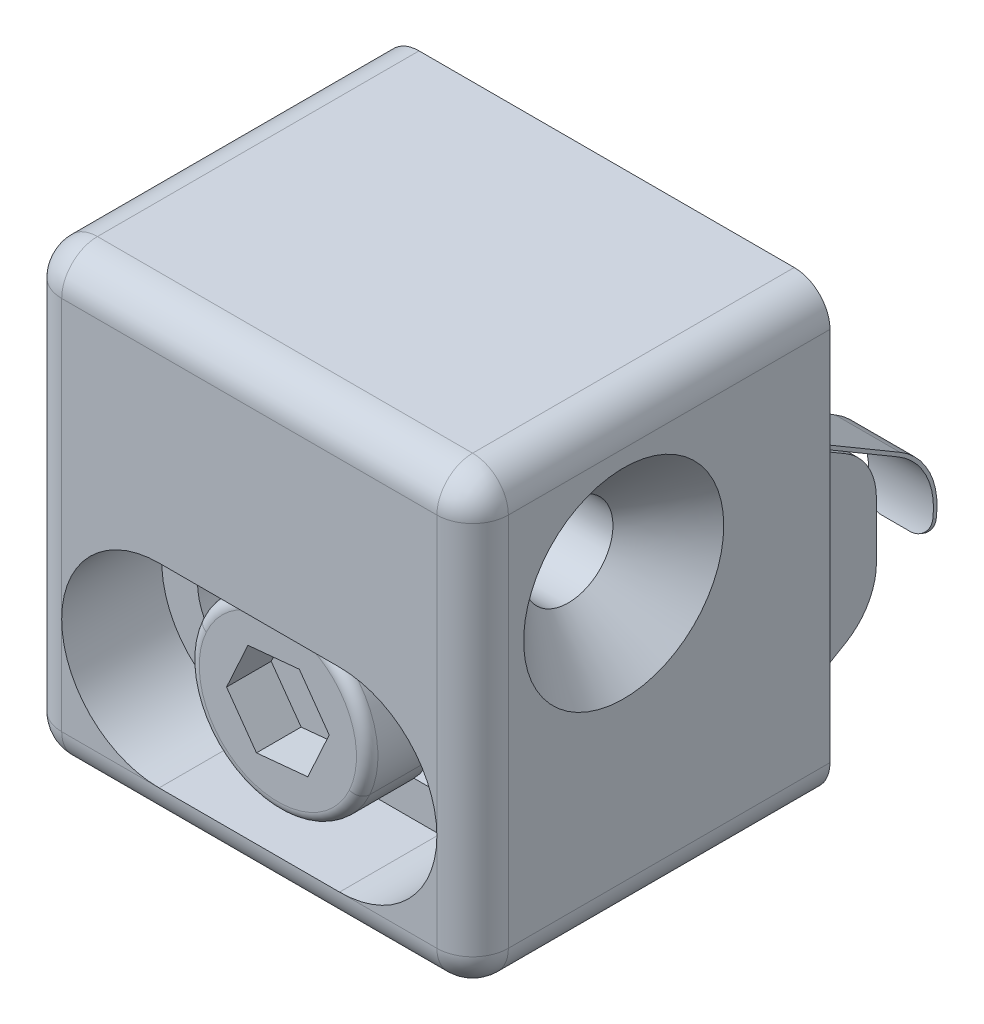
ISO-10303-21;
HEADER;
FILE_DESCRIPTION(('STEP AP214'),'2;1');
FILE_NAME('part.step','',(''),(''),'','','');
FILE_SCHEMA(('AUTOMOTIVE_DESIGN { 1 0 10303 214 1 1 1 1 }'));
ENDSEC;
DATA;
#1=APPLICATION_CONTEXT('core data for automotive mechanical design processes');
#2=APPLICATION_PROTOCOL_DEFINITION('international standard','automotive_design',2000,#1);
#3=PRODUCT_CONTEXT('',#1,'mechanical');
#4=PRODUCT('Part','Part','',(#3));
#5=PRODUCT_RELATED_PRODUCT_CATEGORY('part','',(#4));
#6=PRODUCT_DEFINITION_FORMATION('','',#4);
#7=PRODUCT_DEFINITION_CONTEXT('part definition',#1,'design');
#8=PRODUCT_DEFINITION('design','',#6,#7);
#9=PRODUCT_DEFINITION_SHAPE('','',#8);
#10=(LENGTH_UNIT() NAMED_UNIT(*) SI_UNIT(.MILLI.,.METRE.));
#11=(NAMED_UNIT(*) PLANE_ANGLE_UNIT() SI_UNIT($,.RADIAN.));
#12=(NAMED_UNIT(*) SI_UNIT($,.STERADIAN.) SOLID_ANGLE_UNIT());
#13=UNCERTAINTY_MEASURE_WITH_UNIT(LENGTH_MEASURE(1.E-05),#10,'distance_accuracy_value','');
#14=(GEOMETRIC_REPRESENTATION_CONTEXT(3) GLOBAL_UNCERTAINTY_ASSIGNED_CONTEXT((#13)) GLOBAL_UNIT_ASSIGNED_CONTEXT((#10,
#11,#12)) REPRESENTATION_CONTEXT('',''));
#15=CARTESIAN_POINT('',(0.,0.,0.));
#16=DIRECTION('',(0.,0.,1.));
#17=DIRECTION('',(1.,0.,0.));
#18=AXIS2_PLACEMENT_3D('',#15,#16,#17);
#19=CARTESIAN_POINT('',(-7.72278317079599,-7.88986602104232,-15.5234246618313));
#20=DIRECTION('',(0.,0.,-1.));
#21=DIRECTION('',(0.,-1.,0.));
#22=AXIS2_PLACEMENT_3D('',#19,#20,#21);
#23=PLANE('',#22);
#24=DIRECTION('',(1.,0.,0.));
#25=VECTOR('',#24,1.);
#26=CARTESIAN_POINT('',(-7.72278317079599,-7.54018269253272,-15.5234246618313));
#27=LINE('',#26,#25);
#28=CARTESIAN_POINT('',(8.27721682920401,-7.54018269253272,-15.5234246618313));
#29=VERTEX_POINT('',#28);
#30=CARTESIAN_POINT('',(-7.72278317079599,-7.54018269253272,-15.5234246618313));
#31=VERTEX_POINT('',#30);
#32=EDGE_CURVE('P0_E311',#29,#31,#27,.F.);
#33=ORIENTED_EDGE('',*,*,#32,.F.);
#34=DIRECTION('',(0.,-1.,0.));
#35=VECTOR('',#34,1.);
#36=CARTESIAN_POINT('',(8.27721682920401,-7.88986602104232,-15.5234246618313));
#37=LINE('',#36,#35);
#38=CARTESIAN_POINT('',(8.27721682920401,-6.13986602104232,-15.5234246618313));
#39=VERTEX_POINT('',#38);
#40=EDGE_CURVE('P0_E349',#39,#29,#37,.T.);
#41=ORIENTED_EDGE('',*,*,#40,.F.);
#42=DIRECTION('',(-1.,0.,0.));
#43=VECTOR('',#42,1.);
#44=CARTESIAN_POINT('',(-7.72278317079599,-6.13986602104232,-15.5234246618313));
#45=LINE('',#44,#43);
#46=CARTESIAN_POINT('',(-7.72278317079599,-6.13986602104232,-15.5234246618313));
#47=VERTEX_POINT('',#46);
#48=EDGE_CURVE('P0_E346',#39,#47,#45,.T.);
#49=ORIENTED_EDGE('',*,*,#48,.T.);
#50=DIRECTION('',(0.,-1.,0.));
#51=VECTOR('',#50,1.);
#52=CARTESIAN_POINT('',(-7.72278317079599,-7.88986602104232,-15.5234246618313));
#53=LINE('',#52,#51);
#54=EDGE_CURVE('P0_E297',#31,#47,#53,.F.);
#55=ORIENTED_EDGE('',*,*,#54,.F.);
#56=EDGE_LOOP('',(#33,#41,#49,#55));
#57=FACE_BOUND('',#56,.T.);
#58=ADVANCED_FACE('P0_F17',(#57),#23,.F.);
#59=CARTESIAN_POINT('',(-7.72278317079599,-2.13986602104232,-14.6753702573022));
#60=DIRECTION('',(-1.,0.,0.));
#61=DIRECTION('',(0.,1.,0.));
#62=AXIS2_PLACEMENT_3D('',#59,#60,#61);
#63=CYLINDRICAL_SURFACE('',#62,0.3);
#64=CARTESIAN_POINT('',(2.77258528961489,-2.29197205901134,-14.9339505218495));
#65=CARTESIAN_POINT('',(2.77347239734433,-2.27750688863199,-14.9424761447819));
#66=CARTESIAN_POINT('',(2.774267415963,-2.26231076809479,-14.9497638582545));
#67=CARTESIAN_POINT('',(2.77560584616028,-2.23092346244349,-14.9617054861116));
#68=CARTESIAN_POINT('',(2.77614950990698,-2.21473329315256,-14.9663620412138));
#69=CARTESIAN_POINT('',(2.77692006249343,-2.18178488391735,-14.9729028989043));
#70=CARTESIAN_POINT('',(2.77714677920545,-2.16502634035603,-14.9747856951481));
#71=CARTESIAN_POINT('',(2.77725892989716,-2.13142371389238,-14.9757218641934));
#72=CARTESIAN_POINT('',(2.77714425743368,-2.11457960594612,-14.9747743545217));
#73=CARTESIAN_POINT('',(2.77658681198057,-2.08133480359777,-14.9700828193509));
#74=CARTESIAN_POINT('',(2.77614482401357,-2.0649331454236,-14.9663454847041));
#75=CARTESIAN_POINT('',(2.7749832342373,-2.03301584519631,-14.9561947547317));
#76=CARTESIAN_POINT('',(2.7742641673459,-2.0174985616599,-14.9497865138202));
#77=CARTESIAN_POINT('',(2.77317096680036,-1.99760160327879,-14.9395544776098));
#78=CARTESIAN_POINT('',(2.77288291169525,-1.99263830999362,-14.9368213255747));
#79=CARTESIAN_POINT('',(2.77258528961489,-1.98775998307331,-14.9339505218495));
#80=B_SPLINE_CURVE_WITH_KNOTS('',3,(#64,#65,#66,#67,#68,#69,#70,#71,#72,#73,#74,#75,#76,#77,#78,
#79),.UNSPECIFIED.,.F.,.F.,(4,2,2,2,2,2,2,4),(0.,0.0503785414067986,0.100706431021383,
0.151061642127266,0.201432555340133,0.251683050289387,0.301837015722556,0.318847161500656),.UNSPECIFIED.);
#81=CARTESIAN_POINT('',(2.77258528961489,-2.29197205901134,-14.9339505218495));
#82=VERTEX_POINT('',#81);
#83=CARTESIAN_POINT('',(2.77258528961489,-1.98775998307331,-14.9339505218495));
#84=VERTEX_POINT('',#83);
#85=EDGE_CURVE('P0_E296',#82,#84,#80,.T.);
#86=ORIENTED_EDGE('',*,*,#85,.F.);
#87=DIRECTION('',(-1.,0.,0.));
#88=VECTOR('',#87,1.);
#89=CARTESIAN_POINT('',(-7.72278317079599,-2.29197205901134,-14.9339505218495));
#90=LINE('',#89,#88);
#91=CARTESIAN_POINT('',(8.27721682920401,-2.29197205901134,-14.9339505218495));
#92=VERTEX_POINT('',#91);
#93=EDGE_CURVE('P0_E292',#82,#92,#90,.F.);
#94=ORIENTED_EDGE('',*,*,#93,.T.);
#95=CARTESIAN_POINT('',(8.27721682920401,-2.13986602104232,-14.6753702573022));
#96=DIRECTION('',(-1.,0.,0.));
#97=DIRECTION('',(0.,1.,0.));
#98=AXIS2_PLACEMENT_3D('',#95,#96,#97);
#99=CIRCLE('',#98,0.3);
#100=CARTESIAN_POINT('',(8.27721682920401,-1.98775998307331,-14.9339505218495));
#101=VERTEX_POINT('',#100);
#102=EDGE_CURVE('P0_E20',#101,#92,#99,.T.);
#103=ORIENTED_EDGE('',*,*,#102,.F.);
#104=DIRECTION('',(-1.,0.,0.));
#105=VECTOR('',#104,1.);
#106=CARTESIAN_POINT('',(-7.72278317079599,-1.98775998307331,-14.9339505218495));
#107=LINE('',#106,#105);
#108=EDGE_CURVE('P0_E290',#101,#84,#107,.T.);
#109=ORIENTED_EDGE('',*,*,#108,.T.);
#110=EDGE_LOOP('',(#86,#94,#103,#109));
#111=FACE_BOUND('',#110,.T.);
#112=ADVANCED_FACE('P0_F289',(#111),#63,.F.);
#113=CARTESIAN_POINT('',(-7.72278317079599,-2.13986602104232,-14.6753702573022));
#114=DIRECTION('',(-1.,0.,0.));
#115=DIRECTION('',(0.,1.,0.));
#116=AXIS2_PLACEMENT_3D('',#113,#114,#115);
#117=CYLINDRICAL_SURFACE('',#116,0.3);
#118=CARTESIAN_POINT('',(-2.21815163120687,-1.98775998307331,-14.9339505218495));
#119=CARTESIAN_POINT('',(-2.21903873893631,-2.00222515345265,-14.942476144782));
#120=CARTESIAN_POINT('',(-2.21983375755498,-2.01742127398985,-14.9497638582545));
#121=CARTESIAN_POINT('',(-2.22117218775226,-2.04880857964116,-14.9617054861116));
#122=CARTESIAN_POINT('',(-2.22171585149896,-2.06499874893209,-14.9663620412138));
#123=CARTESIAN_POINT('',(-2.22248640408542,-2.0979471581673,-14.9729028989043));
#124=CARTESIAN_POINT('',(-2.22271312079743,-2.11470570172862,-14.9747856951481));
#125=CARTESIAN_POINT('',(-2.22282527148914,-2.14830832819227,-14.9757218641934));
#126=CARTESIAN_POINT('',(-2.22271059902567,-2.16515243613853,-14.9747743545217));
#127=CARTESIAN_POINT('',(-2.22215315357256,-2.19839723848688,-14.9700828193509));
#128=CARTESIAN_POINT('',(-2.22171116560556,-2.21479889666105,-14.9663454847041));
#129=CARTESIAN_POINT('',(-2.22054957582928,-2.24671619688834,-14.9561947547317));
#130=CARTESIAN_POINT('',(-2.21983050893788,-2.26223348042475,-14.9497865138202));
#131=CARTESIAN_POINT('',(-2.21873730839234,-2.28213043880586,-14.9395544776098));
#132=CARTESIAN_POINT('',(-2.21844925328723,-2.28709373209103,-14.9368213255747));
#133=CARTESIAN_POINT('',(-2.21815163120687,-2.29197205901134,-14.9339505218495));
#134=B_SPLINE_CURVE_WITH_KNOTS('',3,(#118,#119,#120,#121,#122,#123,#124,#125,#126,#127,#128,
#129,#130,#131,#132,#133),.UNSPECIFIED.,.F.,.F.,(4,2,2,2,2,2,2,4),(0.,0.0503785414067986,
0.100706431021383,0.151061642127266,0.201432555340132,0.251683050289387,0.301837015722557,
0.318847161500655),.UNSPECIFIED.);
#135=CARTESIAN_POINT('',(-2.21815163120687,-1.98775998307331,-14.9339505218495));
#136=VERTEX_POINT('',#135);
#137=CARTESIAN_POINT('',(-2.21815163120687,-2.29197205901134,-14.9339505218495));
#138=VERTEX_POINT('',#137);
#139=EDGE_CURVE('P0_E360',#136,#138,#134,.T.);
#140=ORIENTED_EDGE('',*,*,#139,.F.);
#141=DIRECTION('',(-1.,0.,0.));
#142=VECTOR('',#141,1.);
#143=CARTESIAN_POINT('',(-7.72278317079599,-1.98775998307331,-14.9339505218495));
#144=LINE('',#143,#142);
#145=CARTESIAN_POINT('',(-7.72278317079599,-1.98775998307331,-14.9339505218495));
#146=VERTEX_POINT('',#145);
#147=EDGE_CURVE('P0_E795',#136,#146,#144,.T.);
#148=ORIENTED_EDGE('',*,*,#147,.T.);
#149=CARTESIAN_POINT('',(-7.72278317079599,-2.13986602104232,-14.6753702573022));
#150=DIRECTION('',(-1.,0.,0.));
#151=DIRECTION('',(0.,1.,0.));
#152=AXIS2_PLACEMENT_3D('',#149,#150,#151);
#153=CIRCLE('',#152,0.3);
#154=CARTESIAN_POINT('',(-7.72278317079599,-2.29197205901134,-14.9339505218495));
#155=VERTEX_POINT('',#154);
#156=EDGE_CURVE('P0_E826',#155,#146,#153,.F.);
#157=ORIENTED_EDGE('',*,*,#156,.F.);
#158=DIRECTION('',(-1.,0.,0.));
#159=VECTOR('',#158,1.);
#160=CARTESIAN_POINT('',(-7.72278317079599,-2.29197205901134,-14.9339505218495));
#161=LINE('',#160,#159);
#162=EDGE_CURVE('P0_E327',#155,#138,#161,.F.);
#163=ORIENTED_EDGE('',*,*,#162,.T.);
#164=EDGE_LOOP('',(#140,#148,#157,#163));
#165=FACE_BOUND('',#164,.T.);
#166=ADVANCED_FACE('P0_F831',(#165),#117,.F.);
#167=CARTESIAN_POINT('',(-7.72278317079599,-6.13986602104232,-15.5234246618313));
#168=DIRECTION('',(0.,0.894427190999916,-0.447213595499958));
#169=DIRECTION('',(0.,-0.447213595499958,-0.894427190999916));
#170=AXIS2_PLACEMENT_3D('',#167,#168,#169);
#171=PLANE('',#170);
#172=DIRECTION('',(1.,0.,0.));
#173=VECTOR('',#172,1.);
#174=CARTESIAN_POINT('',(-7.72278317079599,-5.72278398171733,-14.6892605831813));
#175=LINE('',#174,#173);
#176=CARTESIAN_POINT('',(-7.72278317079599,-5.72278398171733,-14.6892605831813));
#177=VERTEX_POINT('',#176);
#178=CARTESIAN_POINT('',(8.27721682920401,-5.72278398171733,-14.6892605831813));
#179=VERTEX_POINT('',#178);
#180=EDGE_CURVE('P0_E334',#177,#179,#175,.T.);
#181=ORIENTED_EDGE('',*,*,#180,.F.);
#182=DIRECTION('',(0.,-0.447213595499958,-0.894427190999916));
#183=VECTOR('',#182,1.);
#184=CARTESIAN_POINT('',(-7.72278317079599,-6.13986602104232,-15.5234246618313));
#185=LINE('',#184,#183);
#186=EDGE_CURVE('P0_E341',#47,#177,#185,.F.);
#187=ORIENTED_EDGE('',*,*,#186,.F.);
#188=ORIENTED_EDGE('',*,*,#48,.F.);
#189=DIRECTION('',(0.,-0.447213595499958,-0.894427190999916));
#190=VECTOR('',#189,1.);
#191=CARTESIAN_POINT('',(8.27721682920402,-6.13986602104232,-15.5234246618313));
#192=LINE('',#191,#190);
#193=EDGE_CURVE('P0_E333',#179,#39,#192,.T.);
#194=ORIENTED_EDGE('',*,*,#193,.F.);
#195=EDGE_LOOP('',(#181,#187,#188,#194));
#196=FACE_BOUND('',#195,.T.);
#197=ADVANCED_FACE('P0_F835',(#196),#171,.F.);
#198=CARTESIAN_POINT('',(-7.72278317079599,-2.98986602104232,-14.5234246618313));
#199=DIRECTION('',(0.,-0.507020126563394,-0.86193421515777));
#200=DIRECTION('',(0.,-0.86193421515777,0.507020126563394));
#201=AXIS2_PLACEMENT_3D('',#198,#199,#200);
#202=PLANE('',#201);
#203=CARTESIAN_POINT('',(0.277216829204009,-2.13986602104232,-15.0234246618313));
#204=DIRECTION('',(0.,-0.507020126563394,-0.86193421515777));
#205=DIRECTION('',(0.,0.86193421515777,-0.507020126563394));
#206=AXIS2_PLACEMENT_3D('',#203,#204,#205);
#207=ELLIPSE('',#206,2.90045337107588,2.5);
#208=CARTESIAN_POINT('',(-2.09812419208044,-2.91945247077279,-14.5648443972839));
#209=VERTEX_POINT('',#208);
#210=EDGE_CURVE('P0_E326',#138,#209,#207,.F.);
#211=ORIENTED_EDGE('',*,*,#210,.F.);
#212=ORIENTED_EDGE('',*,*,#162,.F.);
#213=DIRECTION('',(0.,-0.86193421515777,0.507020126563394));
#214=VECTOR('',#213,1.);
#215=CARTESIAN_POINT('',(-7.72278317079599,-2.98986602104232,-14.5234246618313));
#216=LINE('',#215,#214);
#217=CARTESIAN_POINT('',(-7.72278317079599,-2.91945247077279,-14.5648443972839));
#218=VERTEX_POINT('',#217);
#219=EDGE_CURVE('P0_E330',#218,#155,#216,.F.);
#220=ORIENTED_EDGE('',*,*,#219,.F.);
#221=DIRECTION('',(1.,0.,0.));
#222=VECTOR('',#221,1.);
#223=CARTESIAN_POINT('',(-7.72278317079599,-2.91945247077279,-14.5648443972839));
#224=LINE('',#223,#222);
#225=EDGE_CURVE('P0_E787',#209,#218,#224,.F.);
#226=ORIENTED_EDGE('',*,*,#225,.F.);
#227=EDGE_LOOP('',(#211,#212,#220,#226));
#228=FACE_BOUND('',#227,.T.);
#229=ADVANCED_FACE('P0_F1463',(#228),#202,.F.);
#230=CARTESIAN_POINT('',(-7.72278317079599,-2.98986602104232,-14.5234246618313));
#231=DIRECTION('',(0.,-0.507020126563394,-0.86193421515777));
#232=DIRECTION('',(0.,-0.86193421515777,0.507020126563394));
#233=AXIS2_PLACEMENT_3D('',#230,#231,#232);
#234=PLANE('',#233);
#235=CARTESIAN_POINT('',(0.277216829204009,-2.13986602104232,-15.0234246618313));
#236=DIRECTION('',(0.,-0.507020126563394,-0.86193421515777));
#237=DIRECTION('',(0.,0.86193421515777,-0.507020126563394));
#238=AXIS2_PLACEMENT_3D('',#235,#236,#237);
#239=ELLIPSE('',#238,2.90045337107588,2.5);
#240=CARTESIAN_POINT('',(2.65255785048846,-2.91945247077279,-14.5648443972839));
#241=VERTEX_POINT('',#240);
#242=EDGE_CURVE('P0_E323',#241,#82,#239,.F.);
#243=ORIENTED_EDGE('',*,*,#242,.F.);
#244=DIRECTION('',(1.,0.,0.));
#245=VECTOR('',#244,1.);
#246=CARTESIAN_POINT('',(-7.72278317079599,-2.91945247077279,-14.5648443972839));
#247=LINE('',#246,#245);
#248=CARTESIAN_POINT('',(8.27721682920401,-2.91945247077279,-14.5648443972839));
#249=VERTEX_POINT('',#248);
#250=EDGE_CURVE('P0_E782',#249,#241,#247,.F.);
#251=ORIENTED_EDGE('',*,*,#250,.F.);
#252=DIRECTION('',(0.,-0.86193421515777,0.507020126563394));
#253=VECTOR('',#252,1.);
#254=CARTESIAN_POINT('',(8.27721682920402,-2.98986602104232,-14.5234246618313));
#255=LINE('',#254,#253);
#256=EDGE_CURVE('P0_E324',#92,#249,#255,.T.);
#257=ORIENTED_EDGE('',*,*,#256,.F.);
#258=ORIENTED_EDGE('',*,*,#93,.F.);
#259=EDGE_LOOP('',(#243,#251,#257,#258));
#260=FACE_BOUND('',#259,.T.);
#261=ADVANCED_FACE('P0_F1452',(#260),#234,.F.);
#262=CARTESIAN_POINT('',(-7.72278317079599,-1.28986602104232,-14.5234246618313));
#263=DIRECTION('',(0.,0.507020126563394,-0.86193421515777));
#264=DIRECTION('',(0.,-0.86193421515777,-0.507020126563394));
#265=AXIS2_PLACEMENT_3D('',#262,#263,#264);
#266=PLANE('',#265);
#267=CARTESIAN_POINT('',(0.277216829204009,-2.13986602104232,-15.0234246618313));
#268=DIRECTION('',(0.,0.507020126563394,-0.86193421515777));
#269=DIRECTION('',(0.,-0.86193421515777,-0.507020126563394));
#270=AXIS2_PLACEMENT_3D('',#267,#268,#269);
#271=ELLIPSE('',#270,2.90045337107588,2.5);
#272=CARTESIAN_POINT('',(2.65255785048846,-1.36027957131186,-14.5648443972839));
#273=VERTEX_POINT('',#272);
#274=EDGE_CURVE('P0_E304',#84,#273,#271,.F.);
#275=ORIENTED_EDGE('',*,*,#274,.F.);
#276=ORIENTED_EDGE('',*,*,#108,.F.);
#277=DIRECTION('',(0.,-0.86193421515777,-0.507020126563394));
#278=VECTOR('',#277,1.);
#279=CARTESIAN_POINT('',(8.27721682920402,-1.28986602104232,-14.5234246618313));
#280=LINE('',#279,#278);
#281=CARTESIAN_POINT('',(8.27721682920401,-1.36027957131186,-14.5648443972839));
#282=VERTEX_POINT('',#281);
#283=EDGE_CURVE('P0_E302',#282,#101,#280,.T.);
#284=ORIENTED_EDGE('',*,*,#283,.F.);
#285=DIRECTION('',(1.,0.,0.));
#286=VECTOR('',#285,1.);
#287=CARTESIAN_POINT('',(-7.72278317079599,-1.36027957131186,-14.5648443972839));
#288=LINE('',#287,#286);
#289=EDGE_CURVE('P0_E320',#273,#282,#288,.T.);
#290=ORIENTED_EDGE('',*,*,#289,.F.);
#291=EDGE_LOOP('',(#275,#276,#284,#290));
#292=FACE_BOUND('',#291,.T.);
#293=ADVANCED_FACE('P0_F300',(#292),#266,.F.);
#294=CARTESIAN_POINT('',(-7.72278317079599,-1.28986602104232,-14.5234246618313));
#295=DIRECTION('',(0.,0.507020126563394,-0.86193421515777));
#296=DIRECTION('',(0.,-0.86193421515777,-0.507020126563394));
#297=AXIS2_PLACEMENT_3D('',#294,#295,#296);
#298=PLANE('',#297);
#299=CARTESIAN_POINT('',(0.277216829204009,-2.13986602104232,-15.0234246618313));
#300=DIRECTION('',(0.,0.507020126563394,-0.86193421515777));
#301=DIRECTION('',(0.,-0.86193421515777,-0.507020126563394));
#302=AXIS2_PLACEMENT_3D('',#299,#300,#301);
#303=ELLIPSE('',#302,2.90045337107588,2.5);
#304=CARTESIAN_POINT('',(-2.09812419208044,-1.36027957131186,-14.5648443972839));
#305=VERTEX_POINT('',#304);
#306=EDGE_CURVE('P0_E803',#305,#136,#303,.F.);
#307=ORIENTED_EDGE('',*,*,#306,.F.);
#308=DIRECTION('',(1.,0.,0.));
#309=VECTOR('',#308,1.);
#310=CARTESIAN_POINT('',(-7.72278317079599,-1.36027957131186,-14.5648443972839));
#311=LINE('',#310,#309);
#312=CARTESIAN_POINT('',(-7.72278317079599,-1.36027957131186,-14.5648443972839));
#313=VERTEX_POINT('',#312);
#314=EDGE_CURVE('P0_E776',#313,#305,#311,.T.);
#315=ORIENTED_EDGE('',*,*,#314,.F.);
#316=DIRECTION('',(0.,-0.86193421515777,-0.507020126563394));
#317=VECTOR('',#316,1.);
#318=CARTESIAN_POINT('',(-7.72278317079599,-1.28986602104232,-14.5234246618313));
#319=LINE('',#318,#317);
#320=EDGE_CURVE('P0_E804',#146,#313,#319,.F.);
#321=ORIENTED_EDGE('',*,*,#320,.F.);
#322=ORIENTED_EDGE('',*,*,#147,.F.);
#323=EDGE_LOOP('',(#307,#315,#321,#322));
#324=FACE_BOUND('',#323,.T.);
#325=ADVANCED_FACE('P0_F850',(#324),#298,.F.);
#326=CARTESIAN_POINT('',(-7.72278317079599,1.86013397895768,-15.5234246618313));
#327=DIRECTION('',(0.,-0.894427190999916,-0.447213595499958));
#328=DIRECTION('',(0.,-0.447213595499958,0.894427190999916));
#329=AXIS2_PLACEMENT_3D('',#326,#327,#328);
#330=PLANE('',#329);
#331=DIRECTION('',(1.,0.,0.));
#332=VECTOR('',#331,1.);
#333=CARTESIAN_POINT('',(-7.72278317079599,1.44305193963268,-14.6892605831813));
#334=LINE('',#333,#332);
#335=CARTESIAN_POINT('',(8.27721682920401,1.44305193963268,-14.6892605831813));
#336=VERTEX_POINT('',#335);
#337=CARTESIAN_POINT('',(-7.72278317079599,1.44305193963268,-14.6892605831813));
#338=VERTEX_POINT('',#337);
#339=EDGE_CURVE('P0_E317',#336,#338,#334,.F.);
#340=ORIENTED_EDGE('',*,*,#339,.F.);
#341=DIRECTION('',(0.,-0.447213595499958,0.894427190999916));
#342=VECTOR('',#341,1.);
#343=CARTESIAN_POINT('',(8.27721682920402,1.86013397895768,-15.5234246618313));
#344=LINE('',#343,#342);
#345=CARTESIAN_POINT('',(8.27721682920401,1.86013397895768,-15.5234246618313));
#346=VERTEX_POINT('',#345);
#347=EDGE_CURVE('P0_E791',#346,#336,#344,.T.);
#348=ORIENTED_EDGE('',*,*,#347,.F.);
#349=DIRECTION('',(-1.,0.,0.));
#350=VECTOR('',#349,1.);
#351=CARTESIAN_POINT('',(-7.72278317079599,1.86013397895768,-15.5234246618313));
#352=LINE('',#351,#350);
#353=CARTESIAN_POINT('',(-7.72278317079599,1.86013397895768,-15.5234246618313));
#354=VERTEX_POINT('',#353);
#355=EDGE_CURVE('P0_E765',#346,#354,#352,.T.);
#356=ORIENTED_EDGE('',*,*,#355,.T.);
#357=DIRECTION('',(0.,-0.447213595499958,0.894427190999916));
#358=VECTOR('',#357,1.);
#359=CARTESIAN_POINT('',(-7.72278317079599,1.86013397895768,-15.5234246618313));
#360=LINE('',#359,#358);
#361=EDGE_CURVE('P0_E794',#338,#354,#360,.F.);
#362=ORIENTED_EDGE('',*,*,#361,.F.);
#363=EDGE_LOOP('',(#340,#348,#356,#362));
#364=FACE_BOUND('',#363,.T.);
#365=ADVANCED_FACE('P0_F1420',(#364),#330,.F.);
#366=CARTESIAN_POINT('',(-7.72278317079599,-5.45445582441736,-14.8234246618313));
#367=DIRECTION('',(1.,0.,0.));
#368=DIRECTION('',(0.,-1.,0.));
#369=AXIS2_PLACEMENT_3D('',#366,#367,#368);
#370=CYLINDRICAL_SURFACE('',#369,0.3);
#371=CARTESIAN_POINT('',(8.27721682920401,-5.45445582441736,-14.8234246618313));
#372=DIRECTION('',(1.,0.,0.));
#373=DIRECTION('',(0.,-1.,0.));
#374=AXIS2_PLACEMENT_3D('',#371,#372,#373);
#375=CIRCLE('',#374,0.3);
#376=CARTESIAN_POINT('',(8.27721682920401,-5.45445582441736,-14.5234246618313));
#377=VERTEX_POINT('',#376);
#378=EDGE_CURVE('P0_E337',#179,#377,#375,.F.);
#379=ORIENTED_EDGE('',*,*,#378,.T.);
#380=DIRECTION('',(-1.,0.,0.));
#381=VECTOR('',#380,1.);
#382=CARTESIAN_POINT('',(-7.72278317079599,-5.45445582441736,-14.5234246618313));
#383=LINE('',#382,#381);
#384=CARTESIAN_POINT('',(-7.72278317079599,-5.45445582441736,-14.5234246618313));
#385=VERTEX_POINT('',#384);
#386=EDGE_CURVE('P0_E760',#377,#385,#383,.T.);
#387=ORIENTED_EDGE('',*,*,#386,.T.);
#388=CARTESIAN_POINT('',(-7.72278317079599,-5.45445582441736,-14.8234246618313));
#389=DIRECTION('',(1.,0.,0.));
#390=DIRECTION('',(0.,-1.,0.));
#391=AXIS2_PLACEMENT_3D('',#388,#389,#390);
#392=CIRCLE('',#391,0.3);
#393=EDGE_CURVE('P0_E338',#385,#177,#392,.T.);
#394=ORIENTED_EDGE('',*,*,#393,.T.);
#395=ORIENTED_EDGE('',*,*,#180,.T.);
#396=EDGE_LOOP('',(#379,#387,#394,#395));
#397=FACE_BOUND('',#396,.T.);
#398=ADVANCED_FACE('P0_F909',(#397),#370,.T.);
#399=CARTESIAN_POINT('',(-7.72278317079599,-3.07155850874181,-14.8234246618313));
#400=DIRECTION('',(1.,0.,0.));
#401=DIRECTION('',(0.,-1.,0.));
#402=AXIS2_PLACEMENT_3D('',#399,#400,#401);
#403=CYLINDRICAL_SURFACE('',#402,0.3);
#404=CARTESIAN_POINT('',(-7.72278317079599,-3.07155850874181,-14.8234246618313));
#405=DIRECTION('',(1.,0.,0.));
#406=DIRECTION('',(0.,-1.,0.));
#407=AXIS2_PLACEMENT_3D('',#404,#405,#406);
#408=CIRCLE('',#407,0.3);
#409=CARTESIAN_POINT('',(-7.72278317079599,-3.07155850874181,-14.5234246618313));
#410=VERTEX_POINT('',#409);
#411=EDGE_CURVE('P0_E790',#218,#410,#408,.T.);
#412=ORIENTED_EDGE('',*,*,#411,.T.);
#413=DIRECTION('',(-1.,0.,0.));
#414=VECTOR('',#413,1.);
#415=CARTESIAN_POINT('',(-7.72278317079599,-3.07155850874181,-14.5234246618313));
#416=LINE('',#415,#414);
#417=CARTESIAN_POINT('',(-2.04268599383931,-3.07155850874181,-14.5234246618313));
#418=VERTEX_POINT('',#417);
#419=EDGE_CURVE('P0_E757',#410,#418,#416,.F.);
#420=ORIENTED_EDGE('',*,*,#419,.T.);
#421=CARTESIAN_POINT('',(-2.04268599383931,-3.07155850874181,-14.5234246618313));
#422=CARTESIAN_POINT('',(-2.04965928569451,-3.05421852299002,-14.523407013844));
#423=CARTESIAN_POINT('',(-2.05643256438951,-3.03676781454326,-14.524927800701));
#424=CARTESIAN_POINT('',(-2.06928235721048,-3.00256927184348,-14.5309646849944));
#425=CARTESIAN_POINT('',(-2.07537065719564,-2.98581438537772,-14.5354161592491));
#426=CARTESIAN_POINT('',(-2.08413291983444,-2.96090905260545,-14.5444261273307));
#427=CARTESIAN_POINT('',(-2.08705429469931,-2.95245405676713,-14.5479280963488));
#428=CARTESIAN_POINT('',(-2.09272946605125,-2.93575099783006,-14.5557638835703));
#429=CARTESIAN_POINT('',(-2.09548096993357,-2.92750639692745,-14.5601067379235));
#430=CARTESIAN_POINT('',(-2.0981241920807,-2.91945247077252,-14.5648443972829));
#431=B_SPLINE_CURVE_WITH_KNOTS('',3,(#421,#422,#423,#424,#425,#426,#427,#428,#429,#430),
.UNSPECIFIED.,.F.,.F.,(4,2,2,2,4),(0.,0.0560550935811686,0.110913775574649,0.139697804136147,
0.168810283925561),.UNSPECIFIED.);
#432=EDGE_CURVE('P0_E858',#418,#209,#431,.T.);
#433=ORIENTED_EDGE('',*,*,#432,.T.);
#434=ORIENTED_EDGE('',*,*,#225,.T.);
#435=EDGE_LOOP('',(#412,#420,#433,#434));
#436=FACE_BOUND('',#435,.T.);
#437=ADVANCED_FACE('P0_F1399',(#436),#403,.T.);
#438=CARTESIAN_POINT('',(-7.72278317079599,-3.07155850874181,-14.8234246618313));
#439=DIRECTION('',(1.,0.,0.));
#440=DIRECTION('',(0.,-1.,0.));
#441=AXIS2_PLACEMENT_3D('',#438,#439,#440);
#442=CYLINDRICAL_SURFACE('',#441,0.3);
#443=CARTESIAN_POINT('',(8.27721682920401,-3.07155850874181,-14.8234246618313));
#444=DIRECTION('',(1.,0.,0.));
#445=DIRECTION('',(0.,-1.,0.));
#446=AXIS2_PLACEMENT_3D('',#443,#444,#445);
#447=CIRCLE('',#446,0.3);
#448=CARTESIAN_POINT('',(8.27721682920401,-3.07155850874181,-14.5234246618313));
#449=VERTEX_POINT('',#448);
#450=EDGE_CURVE('P0_E786',#449,#249,#447,.F.);
#451=ORIENTED_EDGE('',*,*,#450,.T.);
#452=ORIENTED_EDGE('',*,*,#250,.T.);
#453=CARTESIAN_POINT('',(2.65255785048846,-2.91945247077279,-14.5648443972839));
#454=CARTESIAN_POINT('',(2.64747731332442,-2.93495828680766,-14.5557034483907));
#455=CARTESIAN_POINT('',(2.6419748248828,-2.95118754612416,-14.5480536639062));
#456=CARTESIAN_POINT('',(2.63039289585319,-2.98417090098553,-14.5359132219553));
#457=CARTESIAN_POINT('',(2.62432792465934,-3.00090692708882,-14.5313598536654));
#458=CARTESIAN_POINT('',(2.61467003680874,-3.02666020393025,-14.5266655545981));
#459=CARTESIAN_POINT('',(2.61127072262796,-3.03556925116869,-14.525456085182));
#460=CARTESIAN_POINT('',(2.6043065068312,-3.053510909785,-14.523831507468));
#461=CARTESIAN_POINT('',(2.60074017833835,-3.06254378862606,-14.5234254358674));
#462=CARTESIAN_POINT('',(2.59711965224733,-3.07155850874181,-14.5234246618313));
#463=B_SPLINE_CURVE_WITH_KNOTS('',3,(#453,#454,#455,#456,#457,#458,#459,#460,#461,#462),
.UNSPECIFIED.,.F.,.F.,(4,2,2,2,4),(0.,0.0560208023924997,0.110870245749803,0.139675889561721,
0.16880374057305),.UNSPECIFIED.);
#464=CARTESIAN_POINT('',(2.59711965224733,-3.07155850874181,-14.5234246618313));
#465=VERTEX_POINT('',#464);
#466=EDGE_CURVE('P0_E861',#241,#465,#463,.T.);
#467=ORIENTED_EDGE('',*,*,#466,.T.);
#468=DIRECTION('',(-1.,0.,0.));
#469=VECTOR('',#468,1.);
#470=CARTESIAN_POINT('',(-7.72278317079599,-3.07155850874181,-14.5234246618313));
#471=LINE('',#470,#469);
#472=EDGE_CURVE('P0_E753',#465,#449,#471,.F.);
#473=ORIENTED_EDGE('',*,*,#472,.T.);
#474=EDGE_LOOP('',(#451,#452,#467,#473));
#475=FACE_BOUND('',#474,.T.);
#476=ADVANCED_FACE('P0_F1388',(#475),#442,.T.);
#477=CARTESIAN_POINT('',(-7.72278317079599,-7.54018269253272,-15.7234246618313));
#478=DIRECTION('',(1.,0.,0.));
#479=DIRECTION('',(0.,-1.,0.));
#480=AXIS2_PLACEMENT_3D('',#477,#478,#479);
#481=CYLINDRICAL_SURFACE('',#480,0.2);
#482=DIRECTION('',(-1.,0.,0.));
#483=VECTOR('',#482,1.);
#484=CARTESIAN_POINT('',(-7.72278317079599,-7.71256953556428,-15.8248286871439));
#485=LINE('',#484,#483);
#486=CARTESIAN_POINT('',(-7.72278317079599,-7.71256953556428,-15.8248286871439));
#487=VERTEX_POINT('',#486);
#488=CARTESIAN_POINT('',(8.27721682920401,-7.71256953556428,-15.8248286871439));
#489=VERTEX_POINT('',#488);
#490=EDGE_CURVE('P0_E750',#487,#489,#485,.F.);
#491=ORIENTED_EDGE('',*,*,#490,.T.);
#492=CARTESIAN_POINT('',(8.27721682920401,-7.54018269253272,-15.7234246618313));
#493=DIRECTION('',(1.,0.,0.));
#494=DIRECTION('',(0.,-1.,0.));
#495=AXIS2_PLACEMENT_3D('',#492,#493,#494);
#496=CIRCLE('',#495,0.2);
#497=EDGE_CURVE('P0_E903',#489,#29,#496,.F.);
#498=ORIENTED_EDGE('',*,*,#497,.T.);
#499=ORIENTED_EDGE('',*,*,#32,.T.);
#500=CARTESIAN_POINT('',(-7.72278317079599,-7.54018269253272,-15.7234246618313));
#501=DIRECTION('',(1.,0.,0.));
#502=DIRECTION('',(0.,-1.,0.));
#503=AXIS2_PLACEMENT_3D('',#500,#501,#502);
#504=CIRCLE('',#503,0.2);
#505=EDGE_CURVE('P0_E785',#31,#487,#504,.T.);
#506=ORIENTED_EDGE('',*,*,#505,.T.);
#507=EDGE_LOOP('',(#491,#498,#499,#506));
#508=FACE_BOUND('',#507,.T.);
#509=ADVANCED_FACE('P0_F1377',(#508),#481,.T.);
#510=CARTESIAN_POINT('',(-7.72278317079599,1.17472378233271,-14.8234246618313));
#511=DIRECTION('',(1.,0.,0.));
#512=DIRECTION('',(0.,-1.,0.));
#513=AXIS2_PLACEMENT_3D('',#510,#511,#512);
#514=CYLINDRICAL_SURFACE('',#513,0.3);
#515=CARTESIAN_POINT('',(8.27721682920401,1.17472378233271,-14.8234246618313));
#516=DIRECTION('',(1.,0.,0.));
#517=DIRECTION('',(0.,-1.,0.));
#518=AXIS2_PLACEMENT_3D('',#515,#516,#517);
#519=CIRCLE('',#518,0.3);
#520=CARTESIAN_POINT('',(8.27721682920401,1.17472378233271,-14.5234246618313));
#521=VERTEX_POINT('',#520);
#522=EDGE_CURVE('P0_E321',#521,#336,#519,.F.);
#523=ORIENTED_EDGE('',*,*,#522,.T.);
#524=ORIENTED_EDGE('',*,*,#339,.T.);
#525=CARTESIAN_POINT('',(-7.72278317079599,1.17472378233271,-14.8234246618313));
#526=DIRECTION('',(1.,0.,0.));
#527=DIRECTION('',(0.,-1.,0.));
#528=AXIS2_PLACEMENT_3D('',#525,#526,#527);
#529=CIRCLE('',#528,0.3);
#530=CARTESIAN_POINT('',(-7.72278317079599,1.17472378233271,-14.5234246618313));
#531=VERTEX_POINT('',#530);
#532=EDGE_CURVE('P0_E901',#338,#531,#529,.T.);
#533=ORIENTED_EDGE('',*,*,#532,.T.);
#534=DIRECTION('',(-1.,0.,0.));
#535=VECTOR('',#534,1.);
#536=CARTESIAN_POINT('',(-7.72278317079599,1.17472378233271,-14.5234246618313));
#537=LINE('',#536,#535);
#538=EDGE_CURVE('P0_E744',#531,#521,#537,.F.);
#539=ORIENTED_EDGE('',*,*,#538,.T.);
#540=EDGE_LOOP('',(#523,#524,#533,#539));
#541=FACE_BOUND('',#540,.T.);
#542=ADVANCED_FACE('P0_F883',(#541),#514,.T.);
#543=CARTESIAN_POINT('',(-7.72278317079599,-1.20817353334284,-14.8234246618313));
#544=DIRECTION('',(1.,0.,0.));
#545=DIRECTION('',(0.,-1.,0.));
#546=AXIS2_PLACEMENT_3D('',#543,#544,#545);
#547=CYLINDRICAL_SURFACE('',#546,0.3);
#548=CARTESIAN_POINT('',(8.27721682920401,-1.20817353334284,-14.8234246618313));
#549=DIRECTION('',(1.,0.,0.));
#550=DIRECTION('',(0.,-1.,0.));
#551=AXIS2_PLACEMENT_3D('',#548,#549,#550);
#552=CIRCLE('',#551,0.3);
#553=CARTESIAN_POINT('',(8.27721682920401,-1.20817353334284,-14.5234246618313));
#554=VERTEX_POINT('',#553);
#555=EDGE_CURVE('P0_E310',#282,#554,#552,.F.);
#556=ORIENTED_EDGE('',*,*,#555,.T.);
#557=DIRECTION('',(-1.,0.,0.));
#558=VECTOR('',#557,1.);
#559=CARTESIAN_POINT('',(-7.72278317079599,-1.20817353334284,-14.5234246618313));
#560=LINE('',#559,#558);
#561=CARTESIAN_POINT('',(2.59711965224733,-1.20817353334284,-14.5234246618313));
#562=VERTEX_POINT('',#561);
#563=EDGE_CURVE('P0_E741',#554,#562,#560,.T.);
#564=ORIENTED_EDGE('',*,*,#563,.T.);
#565=CARTESIAN_POINT('',(2.59711965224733,-1.20817353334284,-14.5234246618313));
#566=CARTESIAN_POINT('',(2.60409294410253,-1.22551351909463,-14.523407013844));
#567=CARTESIAN_POINT('',(2.61086622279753,-1.24296422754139,-14.524927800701));
#568=CARTESIAN_POINT('',(2.6237160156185,-1.27716277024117,-14.5309646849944));
#569=CARTESIAN_POINT('',(2.62980431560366,-1.29391765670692,-14.5354161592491));
#570=CARTESIAN_POINT('',(2.63856657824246,-1.3188229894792,-14.5444261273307));
#571=CARTESIAN_POINT('',(2.64148795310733,-1.32727798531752,-14.5479280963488));
#572=CARTESIAN_POINT('',(2.64716312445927,-1.34398104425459,-14.5557638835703));
#573=CARTESIAN_POINT('',(2.64991462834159,-1.3522256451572,-14.5601067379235));
#574=CARTESIAN_POINT('',(2.65255785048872,-1.36027957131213,-14.5648443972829));
#575=B_SPLINE_CURVE_WITH_KNOTS('',3,(#565,#566,#567,#568,#569,#570,#571,#572,#573,#574),
.UNSPECIFIED.,.F.,.F.,(4,2,2,2,4),(0.,0.0560550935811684,0.110913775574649,0.139697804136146,
0.168810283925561),.UNSPECIFIED.);
#576=EDGE_CURVE('P0_E779',#562,#273,#575,.T.);
#577=ORIENTED_EDGE('',*,*,#576,.T.);
#578=ORIENTED_EDGE('',*,*,#289,.T.);
#579=EDGE_LOOP('',(#556,#564,#577,#578));
#580=FACE_BOUND('',#579,.T.);
#581=ADVANCED_FACE('P0_F879',(#580),#547,.T.);
#582=CARTESIAN_POINT('',(-7.72278317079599,-1.20817353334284,-14.8234246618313));
#583=DIRECTION('',(1.,0.,0.));
#584=DIRECTION('',(0.,-1.,0.));
#585=AXIS2_PLACEMENT_3D('',#582,#583,#584);
#586=CYLINDRICAL_SURFACE('',#585,0.3);
#587=CARTESIAN_POINT('',(-7.72278317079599,-1.20817353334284,-14.8234246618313));
#588=DIRECTION('',(1.,0.,0.));
#589=DIRECTION('',(0.,-1.,0.));
#590=AXIS2_PLACEMENT_3D('',#587,#588,#589);
#591=CIRCLE('',#590,0.3);
#592=CARTESIAN_POINT('',(-7.72278317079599,-1.20817353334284,-14.5234246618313));
#593=VERTEX_POINT('',#592);
#594=EDGE_CURVE('P0_E780',#593,#313,#591,.T.);
#595=ORIENTED_EDGE('',*,*,#594,.T.);
#596=ORIENTED_EDGE('',*,*,#314,.T.);
#597=CARTESIAN_POINT('',(-2.09812419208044,-1.36027957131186,-14.5648443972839));
#598=CARTESIAN_POINT('',(-2.0930436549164,-1.34477375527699,-14.5557034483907));
#599=CARTESIAN_POINT('',(-2.08754116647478,-1.32854449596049,-14.5480536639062));
#600=CARTESIAN_POINT('',(-2.07595923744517,-1.29556114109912,-14.5359132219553));
#601=CARTESIAN_POINT('',(-2.06989426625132,-1.27882511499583,-14.5313598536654));
#602=CARTESIAN_POINT('',(-2.06023637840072,-1.2530718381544,-14.5266655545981));
#603=CARTESIAN_POINT('',(-2.05683706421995,-1.24416279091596,-14.525456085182));
#604=CARTESIAN_POINT('',(-2.04987284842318,-1.22622113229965,-14.523831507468));
#605=CARTESIAN_POINT('',(-2.04630651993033,-1.21718825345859,-14.5234254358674));
#606=CARTESIAN_POINT('',(-2.04268599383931,-1.20817353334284,-14.5234246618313));
#607=B_SPLINE_CURVE_WITH_KNOTS('',3,(#597,#598,#599,#600,#601,#602,#603,#604,#605,#606),
.UNSPECIFIED.,.F.,.F.,(4,2,2,2,4),(0.,0.0560208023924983,0.110870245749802,0.13967588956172,
0.16880374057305),.UNSPECIFIED.);
#608=CARTESIAN_POINT('',(-2.04268599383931,-1.20817353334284,-14.5234246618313));
#609=VERTEX_POINT('',#608);
#610=EDGE_CURVE('P0_E770',#305,#609,#607,.T.);
#611=ORIENTED_EDGE('',*,*,#610,.T.);
#612=DIRECTION('',(-1.,0.,0.));
#613=VECTOR('',#612,1.);
#614=CARTESIAN_POINT('',(-7.72278317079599,-1.20817353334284,-14.5234246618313));
#615=LINE('',#614,#613);
#616=EDGE_CURVE('P0_E737',#609,#593,#615,.T.);
#617=ORIENTED_EDGE('',*,*,#616,.T.);
#618=EDGE_LOOP('',(#595,#596,#611,#617));
#619=FACE_BOUND('',#618,.T.);
#620=ADVANCED_FACE('P0_F875',(#619),#586,.T.);
#621=CARTESIAN_POINT('',(0.27721682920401,-2.13986602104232,-19.2234246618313));
#622=DIRECTION('',(0.,0.,-1.));
#623=DIRECTION('',(0.,-1.,0.));
#624=AXIS2_PLACEMENT_3D('',#621,#622,#623);
#625=CYLINDRICAL_SURFACE('',#624,2.5);
#626=ORIENTED_EDGE('',*,*,#432,.F.);
#627=CARTESIAN_POINT('',(0.277216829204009,-2.13986602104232,-14.5234246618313));
#628=DIRECTION('',(0.,0.,-1.));
#629=DIRECTION('',(0.,-1.,0.));
#630=AXIS2_PLACEMENT_3D('',#627,#628,#629);
#631=CIRCLE('',#630,2.5);
#632=EDGE_CURVE('P0_E756',#418,#465,#631,.F.);
#633=ORIENTED_EDGE('',*,*,#632,.T.);
#634=ORIENTED_EDGE('',*,*,#466,.F.);
#635=ORIENTED_EDGE('',*,*,#242,.T.);
#636=ORIENTED_EDGE('',*,*,#85,.T.);
#637=ORIENTED_EDGE('',*,*,#274,.T.);
#638=ORIENTED_EDGE('',*,*,#576,.F.);
#639=CARTESIAN_POINT('',(0.277216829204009,-2.13986602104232,-14.5234246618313));
#640=DIRECTION('',(0.,0.,-1.));
#641=DIRECTION('',(0.,-1.,0.));
#642=AXIS2_PLACEMENT_3D('',#639,#640,#641);
#643=CIRCLE('',#642,2.5);
#644=EDGE_CURVE('P0_E740',#562,#609,#643,.F.);
#645=ORIENTED_EDGE('',*,*,#644,.T.);
#646=ORIENTED_EDGE('',*,*,#610,.F.);
#647=ORIENTED_EDGE('',*,*,#306,.T.);
#648=ORIENTED_EDGE('',*,*,#139,.T.);
#649=ORIENTED_EDGE('',*,*,#210,.T.);
#650=EDGE_LOOP('',(#626,#633,#634,#635,#636,#637,#638,#645,#646,#647,#648,#649));
#651=FACE_BOUND('',#650,.T.);
#652=CARTESIAN_POINT('',(0.27721682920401,-2.13986602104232,-18.4985509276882));
#653=DIRECTION('',(0.,0.,-1.));
#654=DIRECTION('',(0.,-1.,0.));
#655=AXIS2_PLACEMENT_3D('',#652,#653,#654);
#656=CIRCLE('',#655,2.49999999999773);
#657=CARTESIAN_POINT('',(0.27721682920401,-4.63986602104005,-18.4985509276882));
#658=VERTEX_POINT('',#657);
#659=EDGE_CURVE('P0_E732',#658,#658,#656,.T.);
#660=ORIENTED_EDGE('',*,*,#659,.T.);
#661=EDGE_LOOP('',(#660));
#662=FACE_BOUND('',#661,.T.);
#663=ADVANCED_FACE('P0_F827',(#651,#662),#625,.F.);
#664=CARTESIAN_POINT('',(-7.72278317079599,3.61013397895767,-15.5234246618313));
#665=DIRECTION('',(0.,0.,-1.));
#666=DIRECTION('',(0.,-1.,0.));
#667=AXIS2_PLACEMENT_3D('',#664,#665,#666);
#668=PLANE('',#667);
#669=DIRECTION('',(1.,0.,0.));
#670=VECTOR('',#669,1.);
#671=CARTESIAN_POINT('',(-7.72278317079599,3.26045065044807,-15.5234246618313));
#672=LINE('',#671,#670);
#673=CARTESIAN_POINT('',(-7.72278317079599,3.26045065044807,-15.5234246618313));
#674=VERTEX_POINT('',#673);
#675=CARTESIAN_POINT('',(8.27721682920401,3.26045065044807,-15.5234246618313));
#676=VERTEX_POINT('',#675);
#677=EDGE_CURVE('P0_E715',#674,#676,#672,.T.);
#678=ORIENTED_EDGE('',*,*,#677,.F.);
#679=DIRECTION('',(0.,-1.,0.));
#680=VECTOR('',#679,1.);
#681=CARTESIAN_POINT('',(-7.72278317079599,3.61013397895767,-15.5234246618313));
#682=LINE('',#681,#680);
#683=EDGE_CURVE('P0_E763',#354,#674,#682,.F.);
#684=ORIENTED_EDGE('',*,*,#683,.F.);
#685=ORIENTED_EDGE('',*,*,#355,.F.);
#686=DIRECTION('',(0.,-1.,0.));
#687=VECTOR('',#686,1.);
#688=CARTESIAN_POINT('',(8.27721682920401,-0.568147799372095,-15.5234246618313));
#689=LINE('',#688,#687);
#690=EDGE_CURVE('P0_E712',#676,#346,#689,.T.);
#691=ORIENTED_EDGE('',*,*,#690,.F.);
#692=EDGE_LOOP('',(#678,#684,#685,#691));
#693=FACE_BOUND('',#692,.T.);
#694=ADVANCED_FACE('P0_F1330',(#693),#668,.F.);
#695=CARTESIAN_POINT('',(-7.72278317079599,-5.63986602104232,-14.5234246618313));
#696=DIRECTION('',(0.,0.,-1.));
#697=DIRECTION('',(0.,-1.,0.));
#698=AXIS2_PLACEMENT_3D('',#695,#696,#697);
#699=PLANE('',#698);
#700=ORIENTED_EDGE('',*,*,#632,.F.);
#701=ORIENTED_EDGE('',*,*,#419,.F.);
#702=DIRECTION('',(0.,-1.,0.));
#703=VECTOR('',#702,1.);
#704=CARTESIAN_POINT('',(-7.72278317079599,-0.568147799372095,-14.5234246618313));
#705=LINE('',#704,#703);
#706=EDGE_CURVE('P0_E702',#410,#385,#705,.T.);
#707=ORIENTED_EDGE('',*,*,#706,.T.);
#708=ORIENTED_EDGE('',*,*,#386,.F.);
#709=DIRECTION('',(0.,-1.,0.));
#710=VECTOR('',#709,1.);
#711=CARTESIAN_POINT('',(8.27721682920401,-0.568147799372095,-14.5234246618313));
#712=LINE('',#711,#710);
#713=EDGE_CURVE('P0_E723',#449,#377,#712,.T.);
#714=ORIENTED_EDGE('',*,*,#713,.F.);
#715=ORIENTED_EDGE('',*,*,#472,.F.);
#716=EDGE_LOOP('',(#700,#701,#707,#708,#714,#715));
#717=FACE_BOUND('',#716,.T.);
#718=ADVANCED_FACE('P0_F1318',(#717),#699,.F.);
#719=CARTESIAN_POINT('',(-7.72278317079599,-6.72835399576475,-17.4979951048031));
#720=DIRECTION('',(0.,0.861934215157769,0.507020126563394));
#721=DIRECTION('',(0.,0.507020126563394,-0.861934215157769));
#722=AXIS2_PLACEMENT_3D('',#719,#720,#721);
#723=PLANE('',#722);
#724=ORIENTED_EDGE('',*,*,#490,.F.);
#725=DIRECTION('',(0.,0.507020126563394,-0.86193421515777));
#726=VECTOR('',#725,1.);
#727=CARTESIAN_POINT('',(-7.72278317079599,-7.71256953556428,-15.8248286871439));
#728=LINE('',#727,#726);
#729=CARTESIAN_POINT('',(-7.72278317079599,-6.72835399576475,-17.4979951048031));
#730=VERTEX_POINT('',#729);
#731=EDGE_CURVE('P0_E699',#487,#730,#728,.T.);
#732=ORIENTED_EDGE('',*,*,#731,.T.);
#733=DIRECTION('',(1.,0.,0.));
#734=VECTOR('',#733,1.);
#735=CARTESIAN_POINT('',(-7.72278317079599,-6.72835399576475,-17.4979951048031));
#736=LINE('',#735,#734);
#737=CARTESIAN_POINT('',(8.27721682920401,-6.72835399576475,-17.4979951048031));
#738=VERTEX_POINT('',#737);
#739=EDGE_CURVE('P0_E747',#738,#730,#736,.F.);
#740=ORIENTED_EDGE('',*,*,#739,.F.);
#741=DIRECTION('',(0.,0.507020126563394,-0.86193421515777));
#742=VECTOR('',#741,1.);
#743=CARTESIAN_POINT('',(8.27721682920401,-7.71256953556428,-15.8248286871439));
#744=LINE('',#743,#742);
#745=EDGE_CURVE('P0_E721',#489,#738,#744,.T.);
#746=ORIENTED_EDGE('',*,*,#745,.F.);
#747=EDGE_LOOP('',(#724,#732,#740,#746));
#748=FACE_BOUND('',#747,.T.);
#749=ADVANCED_FACE('P0_F1306',(#748),#723,.F.);
#750=CARTESIAN_POINT('',(-7.72278317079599,-3.71158424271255,-15.7234246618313));
#751=DIRECTION('',(1.,0.,0.));
#752=DIRECTION('',(0.,-1.,0.));
#753=AXIS2_PLACEMENT_3D('',#750,#751,#752);
#754=CYLINDRICAL_SURFACE('',#753,3.5);
#755=ORIENTED_EDGE('',*,*,#739,.T.);
#756=CARTESIAN_POINT('',(-7.72278317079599,-3.71158424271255,-15.7234246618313));
#757=DIRECTION('',(1.,0.,0.));
#758=DIRECTION('',(0.,-1.,0.));
#759=AXIS2_PLACEMENT_3D('',#756,#757,#758);
#760=CIRCLE('',#759,3.5);
#761=CARTESIAN_POINT('',(-7.72278317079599,-3.71158424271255,-19.2234246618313));
#762=VERTEX_POINT('',#761);
#763=EDGE_CURVE('P0_E698',#730,#762,#760,.T.);
#764=ORIENTED_EDGE('',*,*,#763,.T.);
#765=DIRECTION('',(-1.,0.,0.));
#766=VECTOR('',#765,1.);
#767=CARTESIAN_POINT('',(-7.72278317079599,-3.71158424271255,-19.2234246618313));
#768=LINE('',#767,#766);
#769=CARTESIAN_POINT('',(-3.6714793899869,-3.71158424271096,-19.223424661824));
#770=VERTEX_POINT('',#769);
#771=EDGE_CURVE('P0_E729',#762,#770,#768,.F.);
#772=ORIENTED_EDGE('',*,*,#771,.T.);
#773=CARTESIAN_POINT('',(-3.67147939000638,-3.71158424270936,-19.2234246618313));
#774=CARTESIAN_POINT('',(-3.63951624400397,-3.79175079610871,-19.2233931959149));
#775=CARTESIAN_POINT('',(-3.5993384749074,-3.86779097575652,-19.2206753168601));
#776=CARTESIAN_POINT('',(-3.50730548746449,-4.01066963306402,-19.2113518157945));
#777=CARTESIAN_POINT('',(-3.45563739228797,-4.07763059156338,-19.2048060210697));
#778=CARTESIAN_POINT('',(-3.31455577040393,-4.23734075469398,-19.1850877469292));
#779=CARTESIAN_POINT('',(-3.2196682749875,-4.32490190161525,-19.1702421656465));
#780=CARTESIAN_POINT('',(-3.01793600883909,-4.48582740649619,-19.1377058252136));
#781=CARTESIAN_POINT('',(-2.91098671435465,-4.55904978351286,-19.1199895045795));
#782=CARTESIAN_POINT('',(-2.69498511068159,-4.69010626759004,-19.0845059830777));
#783=CARTESIAN_POINT('',(-2.58625554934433,-4.7484930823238,-19.0667785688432));
#784=CARTESIAN_POINT('',(-2.36415171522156,-4.85585794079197,-19.0315700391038));
#785=CARTESIAN_POINT('',(-2.25077355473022,-4.9048279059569,-19.014089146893));
#786=CARTESIAN_POINT('',(-2.02083774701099,-4.99443691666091,-18.9801983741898));
#787=CARTESIAN_POINT('',(-1.90428493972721,-5.03508791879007,-18.9637869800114));
#788=CARTESIAN_POINT('',(-1.66862093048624,-5.10895276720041,-18.9326246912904));
#789=CARTESIAN_POINT('',(-1.54950922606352,-5.14216513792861,-18.9178741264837));
#790=CARTESIAN_POINT('',(-1.29066540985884,-5.20629384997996,-18.8884328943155));
#791=CARTESIAN_POINT('',(-1.15060450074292,-5.23605197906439,-18.8741075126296));
#792=CARTESIAN_POINT('',(-0.868581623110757,-5.28682624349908,-18.8490304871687));
#793=CARTESIAN_POINT('',(-0.726619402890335,-5.30784120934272,-18.838279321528));
#794=CARTESIAN_POINT('',(-0.441326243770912,-5.34140295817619,-18.8208510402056));
#795=CARTESIAN_POINT('',(-0.297994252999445,-5.35394259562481,-18.8141773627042));
#796=CARTESIAN_POINT('',(-0.0107065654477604,-5.37065056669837,-18.805239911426));
#797=CARTESIAN_POINT('',(0.133249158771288,-5.37481852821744,-18.8029763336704));
#798=CARTESIAN_POINT('',(0.459894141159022,-5.37481913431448,-18.8029808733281));
#799=CARTESIAN_POINT('',(0.642590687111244,-5.36810927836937,-18.8066311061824));
#800=CARTESIAN_POINT('',(1.00677789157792,-5.34117191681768,-18.8209514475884));
#801=CARTESIAN_POINT('',(1.18826800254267,-5.32093864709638,-18.8316245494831));
#802=CARTESIAN_POINT('',(1.54819036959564,-5.26667007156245,-18.8591272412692));
#803=CARTESIAN_POINT('',(1.726629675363,-5.23267296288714,-18.8759397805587));
#804=CARTESIAN_POINT('',(2.07946819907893,-5.15008989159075,-18.9144733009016));
#805=CARTESIAN_POINT('',(2.25387030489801,-5.10151472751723,-18.9361906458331));
#806=CARTESIAN_POINT('',(2.57023981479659,-4.99693186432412,-18.9792737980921));
#807=CARTESIAN_POINT('',(2.71303906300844,-4.94324896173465,-19.0001707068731));
#808=CARTESIAN_POINT('',(2.99343604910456,-4.82227428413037,-19.0431454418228));
#809=CARTESIAN_POINT('',(3.13101066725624,-4.75492887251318,-19.0652276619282));
#810=CARTESIAN_POINT('',(3.33155450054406,-4.64109995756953,-19.0979719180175));
#811=CARTESIAN_POINT('',(3.39792088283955,-4.6006593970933,-19.1089062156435));
#812=CARTESIAN_POINT('',(3.52758909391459,-4.51503447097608,-19.1302444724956));
#813=CARTESIAN_POINT('',(3.59089263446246,-4.46985280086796,-19.1406487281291));
#814=CARTESIAN_POINT('',(3.71287497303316,-4.37457336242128,-19.160398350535));
#815=CARTESIAN_POINT('',(3.77159378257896,-4.3245294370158,-19.169753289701));
#816=CARTESIAN_POINT('',(3.88360898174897,-4.21853356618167,-19.1869322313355));
#817=CARTESIAN_POINT('',(3.93691194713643,-4.16258895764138,-19.1947581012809));
#818=CARTESIAN_POINT('',(4.03537285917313,-4.04493848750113,-19.2080082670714));
#819=CARTESIAN_POINT('',(4.08064164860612,-3.9833323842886,-19.213467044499));
#820=CARTESIAN_POINT('',(4.16159235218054,-3.85282441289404,-19.2211888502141));
#821=CARTESIAN_POINT('',(4.19713284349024,-3.78383333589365,-19.2234065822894));
#822=CARTESIAN_POINT('',(4.22591304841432,-3.71158424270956,-19.2234246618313));
#823=B_SPLINE_CURVE_WITH_KNOTS('',3,(#773,#774,#775,#776,#777,#778,#779,#780,#781,#782,#783,
#784,#785,#786,#787,#788,#789,#790,#791,#792,#793,#794,#795,#796,#797,#798,#799,#800,#801,#802,
#803,#804,#805,#806,#807,#808,#809,#810,#811,#812,#813,#814,#815,#816,#817,#818,#819,#820,#821,
#822),.UNSPECIFIED.,.F.,.F.,(4,2,2,2,2,2,2,2,2,2,2,2,2,2,2,2,2,2,2,2,2,2,2,2,4),(0.,
0.257240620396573,0.510564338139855,0.898409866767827,1.2899205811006,1.66343149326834,
2.0372614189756,2.41055021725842,2.78391299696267,3.21527736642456,3.64669941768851,
4.07848474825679,4.51028927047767,5.05819623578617,5.60633688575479,6.15296666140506,
6.69919252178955,7.16061415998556,7.62388358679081,7.85917240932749,8.09432817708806,
8.32712577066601,8.55963724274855,8.78863755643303,9.02080870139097),.UNSPECIFIED.);
#824=CARTESIAN_POINT('',(4.22591304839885,-3.71158424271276,-19.223424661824));
#825=VERTEX_POINT('',#824);
#826=EDGE_CURVE('P0_E775',#770,#825,#823,.T.);
#827=ORIENTED_EDGE('',*,*,#826,.T.);
#828=DIRECTION('',(-1.,0.,0.));
#829=VECTOR('',#828,1.);
#830=CARTESIAN_POINT('',(-7.72278317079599,-3.71158424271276,-19.2234246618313));
#831=LINE('',#830,#829);
#832=CARTESIAN_POINT('',(8.27721682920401,-3.71158424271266,-19.2234246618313));
#833=VERTEX_POINT('',#832);
#834=EDGE_CURVE('P0_E733',#825,#833,#831,.F.);
#835=ORIENTED_EDGE('',*,*,#834,.T.);
#836=CARTESIAN_POINT('',(8.27721682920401,-3.71158424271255,-15.7234246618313));
#837=DIRECTION('',(1.,0.,0.));
#838=DIRECTION('',(0.,-1.,0.));
#839=AXIS2_PLACEMENT_3D('',#836,#837,#838);
#840=CIRCLE('',#839,3.5);
#841=EDGE_CURVE('P0_E720',#738,#833,#840,.T.);
#842=ORIENTED_EDGE('',*,*,#841,.F.);
#843=EDGE_LOOP('',(#755,#764,#772,#827,#835,#842));
#844=FACE_BOUND('',#843,.T.);
#845=ADVANCED_FACE('P0_F1294',(#844),#754,.T.);
#846=CARTESIAN_POINT('',(-7.72278317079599,1.36013397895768,-14.5234246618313));
#847=DIRECTION('',(0.,0.,-1.));
#848=DIRECTION('',(0.,-1.,0.));
#849=AXIS2_PLACEMENT_3D('',#846,#847,#848);
#850=PLANE('',#849);
#851=ORIENTED_EDGE('',*,*,#644,.F.);
#852=ORIENTED_EDGE('',*,*,#563,.F.);
#853=DIRECTION('',(0.,-1.,0.));
#854=VECTOR('',#853,1.);
#855=CARTESIAN_POINT('',(8.27721682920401,-0.568147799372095,-14.5234246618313));
#856=LINE('',#855,#854);
#857=EDGE_CURVE('P0_E726',#521,#554,#856,.T.);
#858=ORIENTED_EDGE('',*,*,#857,.F.);
#859=ORIENTED_EDGE('',*,*,#538,.F.);
#860=DIRECTION('',(0.,-1.,0.));
#861=VECTOR('',#860,1.);
#862=CARTESIAN_POINT('',(-7.72278317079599,-0.568147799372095,-14.5234246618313));
#863=LINE('',#862,#861);
#864=EDGE_CURVE('P0_E687',#531,#593,#863,.T.);
#865=ORIENTED_EDGE('',*,*,#864,.T.);
#866=ORIENTED_EDGE('',*,*,#616,.F.);
#867=EDGE_LOOP('',(#851,#852,#858,#859,#865,#866));
#868=FACE_BOUND('',#867,.T.);
#869=ADVANCED_FACE('P0_F1282',(#868),#850,.F.);
#870=CARTESIAN_POINT('',(-7.72278317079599,-0.568147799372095,-19.2234246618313));
#871=DIRECTION('',(0.,0.,1.));
#872=DIRECTION('',(0.,1.,0.));
#873=AXIS2_PLACEMENT_3D('',#870,#871,#872);
#874=PLANE('',#873);
#875=DIRECTION('',(1.,0.,0.));
#876=VECTOR('',#875,1.);
#877=CARTESIAN_POINT('',(-7.72278317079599,-0.568147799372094,-19.2234246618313));
#878=LINE('',#877,#876);
#879=CARTESIAN_POINT('',(8.27721682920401,-0.568147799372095,-19.2234246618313));
#880=VERTEX_POINT('',#879);
#881=CARTESIAN_POINT('',(4.22591304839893,-0.568147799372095,-19.223424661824));
#882=VERTEX_POINT('',#881);
#883=EDGE_CURVE('P0_E684',#880,#882,#878,.F.);
#884=ORIENTED_EDGE('',*,*,#883,.F.);
#885=DIRECTION('',(0.,-1.,0.));
#886=VECTOR('',#885,1.);
#887=CARTESIAN_POINT('',(8.27721682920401,-0.568147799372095,-19.2234246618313));
#888=LINE('',#887,#886);
#889=EDGE_CURVE('P0_E716',#833,#880,#888,.F.);
#890=ORIENTED_EDGE('',*,*,#889,.F.);
#891=ORIENTED_EDGE('',*,*,#834,.F.);
#892=CARTESIAN_POINT('',(0.27721682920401,-2.13986602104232,-19.2234246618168));
#893=DIRECTION('',(0.,0.,-1.));
#894=DIRECTION('',(0.,-1.,0.));
#895=AXIS2_PLACEMENT_3D('',#892,#893,#894);
#896=CIRCLE('',#895,4.24999999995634);
#897=EDGE_CURVE('P0_E736',#825,#882,#896,.F.);
#898=ORIENTED_EDGE('',*,*,#897,.T.);
#899=EDGE_LOOP('',(#884,#890,#891,#898));
#900=FACE_BOUND('',#899,.T.);
#901=ADVANCED_FACE('P0_F1270',(#900),#874,.F.);
#902=CARTESIAN_POINT('',(0.27721682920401,-2.13986602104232,-19.2234246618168));
#903=DIRECTION('',(0.,0.,-1.));
#904=DIRECTION('',(0.,-1.,0.));
#905=AXIS2_PLACEMENT_3D('',#902,#903,#904);
#906=CONICAL_SURFACE('',#905,4.24999999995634,1.1780972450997);
#907=ORIENTED_EDGE('',*,*,#659,.F.);
#908=EDGE_LOOP('',(#907));
#909=FACE_BOUND('',#908,.T.);
#910=ORIENTED_EDGE('',*,*,#897,.F.);
#911=ORIENTED_EDGE('',*,*,#826,.F.);
#912=CARTESIAN_POINT('',(0.27721682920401,-2.13986602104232,-19.2234246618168));
#913=DIRECTION('',(0.,0.,-1.));
#914=DIRECTION('',(0.,-1.,0.));
#915=AXIS2_PLACEMENT_3D('',#912,#913,#914);
#916=CIRCLE('',#915,4.24999999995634);
#917=CARTESIAN_POINT('',(-3.6714793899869,-0.568147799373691,-19.223424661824));
#918=VERTEX_POINT('',#917);
#919=EDGE_CURVE('P0_E728',#770,#918,#916,.T.);
#920=ORIENTED_EDGE('',*,*,#919,.T.);
#921=CARTESIAN_POINT('',(4.2259130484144,-0.56814779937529,-19.2234246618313));
#922=CARTESIAN_POINT('',(4.19394990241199,-0.487981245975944,-19.2233931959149));
#923=CARTESIAN_POINT('',(4.15377213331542,-0.411941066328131,-19.2206753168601));
#924=CARTESIAN_POINT('',(4.06173914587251,-0.269062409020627,-19.2113518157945));
#925=CARTESIAN_POINT('',(4.01007105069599,-0.202101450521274,-19.2048060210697));
#926=CARTESIAN_POINT('',(3.86898942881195,-0.0423912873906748,-19.1850877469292));
#927=CARTESIAN_POINT('',(3.77410193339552,0.0451698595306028,-19.1702421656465));
#928=CARTESIAN_POINT('',(3.57236966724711,0.206095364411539,-19.1377058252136));
#929=CARTESIAN_POINT('',(3.46542037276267,0.279317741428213,-19.1199895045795));
#930=CARTESIAN_POINT('',(3.2494187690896,0.410374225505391,-19.0845059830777));
#931=CARTESIAN_POINT('',(3.14068920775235,0.468761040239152,-19.0667785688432));
#932=CARTESIAN_POINT('',(2.91858537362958,0.576125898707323,-19.0315700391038));
#933=CARTESIAN_POINT('',(2.80520721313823,0.62509586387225,-19.014089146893));
#934=CARTESIAN_POINT('',(2.57527140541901,0.714704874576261,-18.9801983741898));
#935=CARTESIAN_POINT('',(2.45871859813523,0.755355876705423,-18.9637869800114));
#936=CARTESIAN_POINT('',(2.22305458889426,0.82922072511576,-18.9326246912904));
#937=CARTESIAN_POINT('',(2.10394288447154,0.862433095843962,-18.9178741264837));
#938=CARTESIAN_POINT('',(1.84509906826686,0.92656180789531,-18.8884328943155));
#939=CARTESIAN_POINT('',(1.70503815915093,0.956319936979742,-18.8741075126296));
#940=CARTESIAN_POINT('',(1.42301528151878,1.00709420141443,-18.8490304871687));
#941=CARTESIAN_POINT('',(1.28105306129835,1.02810916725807,-18.838279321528));
#942=CARTESIAN_POINT('',(0.99575990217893,1.06167091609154,-18.8208510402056));
#943=CARTESIAN_POINT('',(0.852427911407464,1.07421055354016,-18.8141773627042));
#944=CARTESIAN_POINT('',(0.565140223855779,1.09091852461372,-18.805239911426));
#945=CARTESIAN_POINT('',(0.421184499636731,1.09508648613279,-18.8029763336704));
#946=CARTESIAN_POINT('',(0.0945395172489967,1.09508709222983,-18.8029808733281));
#947=CARTESIAN_POINT('',(-0.0881570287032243,1.08837723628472,-18.8066311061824));
#948=CARTESIAN_POINT('',(-0.452344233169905,1.06143987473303,-18.8209514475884));
#949=CARTESIAN_POINT('',(-0.633834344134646,1.04120660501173,-18.8316245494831));
#950=CARTESIAN_POINT('',(-0.99375671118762,0.986938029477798,-18.8591272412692));
#951=CARTESIAN_POINT('',(-1.17219601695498,0.952940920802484,-18.8759397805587));
#952=CARTESIAN_POINT('',(-1.52503454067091,0.870357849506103,-18.9144733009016));
#953=CARTESIAN_POINT('',(-1.69943664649,0.821782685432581,-18.9361906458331));
#954=CARTESIAN_POINT('',(-2.01580615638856,0.71719982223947,-18.9792737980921));
#955=CARTESIAN_POINT('',(-2.1586054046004,0.663516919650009,-19.0001707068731));
#956=CARTESIAN_POINT('',(-2.43900239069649,0.542542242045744,-19.0431454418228));
#957=CARTESIAN_POINT('',(-2.57657700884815,0.475196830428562,-19.0652276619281));
#958=CARTESIAN_POINT('',(-2.77712084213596,0.361367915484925,-19.0979719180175));
#959=CARTESIAN_POINT('',(-2.84348722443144,0.320927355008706,-19.1089062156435));
#960=CARTESIAN_POINT('',(-2.97315543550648,0.235302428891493,-19.1302444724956));
#961=CARTESIAN_POINT('',(-3.03645897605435,0.19012075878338,-19.140648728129));
#962=CARTESIAN_POINT('',(-3.15844131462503,0.0948413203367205,-19.1603983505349));
#963=CARTESIAN_POINT('',(-3.21716012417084,0.044797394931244,-19.169753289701));
#964=CARTESIAN_POINT('',(-3.32917532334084,-0.0611984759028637,-19.1869322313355));
#965=CARTESIAN_POINT('',(-3.3824782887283,-0.11714308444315,-19.1947581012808));
#966=CARTESIAN_POINT('',(-3.48093920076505,-0.234793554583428,-19.2080082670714));
#967=CARTESIAN_POINT('',(-3.52620799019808,-0.296399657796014,-19.213467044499));
#968=CARTESIAN_POINT('',(-3.60715869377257,-0.426907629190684,-19.2211888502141));
#969=CARTESIAN_POINT('',(-3.64269918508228,-0.495898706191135,-19.2234065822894));
#970=CARTESIAN_POINT('',(-3.67147939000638,-0.568147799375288,-19.2234246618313));
#971=B_SPLINE_CURVE_WITH_KNOTS('',3,(#921,#922,#923,#924,#925,#926,#927,#928,#929,#930,#931,
#932,#933,#934,#935,#936,#937,#938,#939,#940,#941,#942,#943,#944,#945,#946,#947,#948,#949,#950,
#951,#952,#953,#954,#955,#956,#957,#958,#959,#960,#961,#962,#963,#964,#965,#966,#967,#968,#969,
#970),.UNSPECIFIED.,.F.,.F.,(4,2,2,2,2,2,2,2,2,2,2,2,2,2,2,2,2,2,2,2,2,2,2,2,4),(0.,
0.257240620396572,0.510564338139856,0.898409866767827,1.2899205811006,1.66343149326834,
2.0372614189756,2.41055021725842,2.78391299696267,3.21527736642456,3.64669941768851,
4.07848474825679,4.51028927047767,5.05819623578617,5.60633688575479,6.15296666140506,
6.69919252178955,7.16061415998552,7.62388358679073,7.85917240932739,8.09432817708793,
8.32712577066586,8.55963724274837,8.78863755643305,9.02080870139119),.UNSPECIFIED.);
#972=EDGE_CURVE('P0_E683',#882,#918,#971,.T.);
#973=ORIENTED_EDGE('',*,*,#972,.F.);
#974=EDGE_LOOP('',(#910,#911,#920,#973));
#975=FACE_BOUND('',#974,.T.);
#976=ADVANCED_FACE('P0_F1258',(#909,#975),#906,.F.);
#977=CARTESIAN_POINT('',(-7.72278317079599,-0.568147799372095,-19.2234246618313));
#978=DIRECTION('',(0.,0.,1.));
#979=DIRECTION('',(0.,1.,0.));
#980=AXIS2_PLACEMENT_3D('',#977,#978,#979);
#981=PLANE('',#980);
#982=ORIENTED_EDGE('',*,*,#771,.F.);
#983=DIRECTION('',(0.,-1.,0.));
#984=VECTOR('',#983,1.);
#985=CARTESIAN_POINT('',(-7.72278317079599,-0.568147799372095,-19.2234246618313));
#986=LINE('',#985,#984);
#987=CARTESIAN_POINT('',(-7.72278317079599,-0.568147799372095,-19.2234246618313));
#988=VERTEX_POINT('',#987);
#989=EDGE_CURVE('P0_E695',#762,#988,#986,.F.);
#990=ORIENTED_EDGE('',*,*,#989,.T.);
#991=DIRECTION('',(1.,0.,0.));
#992=VECTOR('',#991,1.);
#993=CARTESIAN_POINT('',(-7.72278317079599,-0.568147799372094,-19.2234246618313));
#994=LINE('',#993,#992);
#995=EDGE_CURVE('P0_E680',#918,#988,#994,.F.);
#996=ORIENTED_EDGE('',*,*,#995,.F.);
#997=ORIENTED_EDGE('',*,*,#919,.F.);
#998=EDGE_LOOP('',(#982,#990,#996,#997));
#999=FACE_BOUND('',#998,.T.);
#1000=ADVANCED_FACE('P0_F1247',(#999),#981,.F.);
#1001=CARTESIAN_POINT('',(8.27721682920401,-0.568147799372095,-15.7234246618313));
#1002=DIRECTION('',(1.,0.,0.));
#1003=DIRECTION('',(0.,-1.,0.));
#1004=AXIS2_PLACEMENT_3D('',#1001,#1002,#1003);
#1005=PLANE('',#1004);
#1006=CARTESIAN_POINT('',(8.27721682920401,3.26045065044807,-15.7234246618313));
#1007=DIRECTION('',(1.,0.,0.));
#1008=DIRECTION('',(0.,-1.,0.));
#1009=AXIS2_PLACEMENT_3D('',#1006,#1007,#1008);
#1010=CIRCLE('',#1009,0.2);
#1011=CARTESIAN_POINT('',(8.27721682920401,3.43283749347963,-15.8248286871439));
#1012=VERTEX_POINT('',#1011);
#1013=EDGE_CURVE('P0_E707',#676,#1012,#1010,.F.);
#1014=ORIENTED_EDGE('',*,*,#1013,.F.);
#1015=ORIENTED_EDGE('',*,*,#690,.T.);
#1016=ORIENTED_EDGE('',*,*,#347,.T.);
#1017=ORIENTED_EDGE('',*,*,#522,.F.);
#1018=ORIENTED_EDGE('',*,*,#857,.T.);
#1019=ORIENTED_EDGE('',*,*,#555,.F.);
#1020=ORIENTED_EDGE('',*,*,#283,.T.);
#1021=ORIENTED_EDGE('',*,*,#102,.T.);
#1022=ORIENTED_EDGE('',*,*,#256,.T.);
#1023=ORIENTED_EDGE('',*,*,#450,.F.);
#1024=ORIENTED_EDGE('',*,*,#713,.T.);
#1025=ORIENTED_EDGE('',*,*,#378,.F.);
#1026=ORIENTED_EDGE('',*,*,#193,.T.);
#1027=ORIENTED_EDGE('',*,*,#40,.T.);
#1028=ORIENTED_EDGE('',*,*,#497,.F.);
#1029=ORIENTED_EDGE('',*,*,#745,.T.);
#1030=ORIENTED_EDGE('',*,*,#841,.T.);
#1031=ORIENTED_EDGE('',*,*,#889,.T.);
#1032=CARTESIAN_POINT('',(8.27721682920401,-0.568147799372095,-15.7234246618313));
#1033=DIRECTION('',(1.,0.,0.));
#1034=DIRECTION('',(0.,-1.,0.));
#1035=AXIS2_PLACEMENT_3D('',#1032,#1033,#1034);
#1036=CIRCLE('',#1035,3.5);
#1037=CARTESIAN_POINT('',(8.27721682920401,2.4486219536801,-17.4979951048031));
#1038=VERTEX_POINT('',#1037);
#1039=EDGE_CURVE('P0_E445',#1038,#880,#1036,.F.);
#1040=ORIENTED_EDGE('',*,*,#1039,.F.);
#1041=DIRECTION('',(0.,0.507020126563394,0.861934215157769));
#1042=VECTOR('',#1041,1.);
#1043=CARTESIAN_POINT('',(8.27721682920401,2.4486219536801,-17.4979951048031));
#1044=LINE('',#1043,#1042);
#1045=EDGE_CURVE('P0_E670',#1038,#1012,#1044,.T.);
#1046=ORIENTED_EDGE('',*,*,#1045,.T.);
#1047=EDGE_LOOP('',(#1014,#1015,#1016,#1017,#1018,#1019,#1020,#1021,#1022,#1023,#1024,#1025,
#1026,#1027,#1028,#1029,#1030,#1031,#1040,#1046));
#1048=FACE_BOUND('',#1047,.T.);
#1049=ADVANCED_FACE('P0_F308',(#1048),#1005,.T.);
#1050=CARTESIAN_POINT('',(-7.72278317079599,3.26045065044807,-15.7234246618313));
#1051=DIRECTION('',(1.,0.,0.));
#1052=DIRECTION('',(0.,-1.,0.));
#1053=AXIS2_PLACEMENT_3D('',#1050,#1051,#1052);
#1054=CYLINDRICAL_SURFACE('',#1053,0.2);
#1055=DIRECTION('',(-1.,0.,0.));
#1056=VECTOR('',#1055,1.);
#1057=CARTESIAN_POINT('',(-7.47278317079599,3.43283749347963,-15.8248286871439));
#1058=LINE('',#1057,#1056);
#1059=CARTESIAN_POINT('',(-7.47278317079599,3.43283749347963,-15.8248286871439));
#1060=VERTEX_POINT('',#1059);
#1061=CARTESIAN_POINT('',(8.02721682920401,3.43283749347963,-15.8248286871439));
#1062=VERTEX_POINT('',#1061);
#1063=EDGE_CURVE('P0_E657',#1060,#1062,#1058,.F.);
#1064=ORIENTED_EDGE('',*,*,#1063,.F.);
#1065=DIRECTION('',(1.,0.,0.));
#1066=VECTOR('',#1065,1.);
#1067=CARTESIAN_POINT('',(-7.72278317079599,3.43283749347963,-15.8248286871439));
#1068=LINE('',#1067,#1066);
#1069=CARTESIAN_POINT('',(-7.72278317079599,3.43283749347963,-15.8248286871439));
#1070=VERTEX_POINT('',#1069);
#1071=EDGE_CURVE('P0_E705',#1060,#1070,#1068,.F.);
#1072=ORIENTED_EDGE('',*,*,#1071,.T.);
#1073=CARTESIAN_POINT('',(-7.72278317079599,3.26045065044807,-15.7234246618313));
#1074=DIRECTION('',(1.,0.,0.));
#1075=DIRECTION('',(0.,-1.,0.));
#1076=AXIS2_PLACEMENT_3D('',#1073,#1074,#1075);
#1077=CIRCLE('',#1076,0.2);
#1078=EDGE_CURVE('P0_E694',#1070,#674,#1077,.T.);
#1079=ORIENTED_EDGE('',*,*,#1078,.T.);
#1080=ORIENTED_EDGE('',*,*,#677,.T.);
#1081=ORIENTED_EDGE('',*,*,#1013,.T.);
#1082=DIRECTION('',(-1.,0.,0.));
#1083=VECTOR('',#1082,1.);
#1084=CARTESIAN_POINT('',(-7.72278317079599,3.43283749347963,-15.8248286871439));
#1085=LINE('',#1084,#1083);
#1086=EDGE_CURVE('P0_E438',#1012,#1062,#1085,.T.);
#1087=ORIENTED_EDGE('',*,*,#1086,.T.);
#1088=EDGE_LOOP('',(#1064,#1072,#1079,#1080,#1081,#1087));
#1089=FACE_BOUND('',#1088,.T.);
#1090=ADVANCED_FACE('P0_F1225',(#1089),#1054,.T.);
#1091=CARTESIAN_POINT('',(-7.72278317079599,-0.568147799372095,-15.7234246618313));
#1092=DIRECTION('',(1.,0.,0.));
#1093=DIRECTION('',(0.,-1.,0.));
#1094=AXIS2_PLACEMENT_3D('',#1091,#1092,#1093);
#1095=PLANE('',#1094);
#1096=ORIENTED_EDGE('',*,*,#532,.F.);
#1097=ORIENTED_EDGE('',*,*,#361,.T.);
#1098=ORIENTED_EDGE('',*,*,#683,.T.);
#1099=ORIENTED_EDGE('',*,*,#1078,.F.);
#1100=DIRECTION('',(0.,0.507020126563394,0.861934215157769));
#1101=VECTOR('',#1100,1.);
#1102=CARTESIAN_POINT('',(-7.72278317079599,2.4486219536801,-17.4979951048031));
#1103=LINE('',#1102,#1101);
#1104=CARTESIAN_POINT('',(-7.72278317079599,2.4486219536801,-17.4979951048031));
#1105=VERTEX_POINT('',#1104);
#1106=EDGE_CURVE('P0_E644',#1070,#1105,#1103,.F.);
#1107=ORIENTED_EDGE('',*,*,#1106,.T.);
#1108=CARTESIAN_POINT('',(-7.72278317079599,-0.568147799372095,-15.7234246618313));
#1109=DIRECTION('',(1.,0.,0.));
#1110=DIRECTION('',(0.,-1.,0.));
#1111=AXIS2_PLACEMENT_3D('',#1108,#1109,#1110);
#1112=CIRCLE('',#1111,3.5);
#1113=EDGE_CURVE('P0_E682',#988,#1105,#1112,.T.);
#1114=ORIENTED_EDGE('',*,*,#1113,.F.);
#1115=ORIENTED_EDGE('',*,*,#989,.F.);
#1116=ORIENTED_EDGE('',*,*,#763,.F.);
#1117=ORIENTED_EDGE('',*,*,#731,.F.);
#1118=ORIENTED_EDGE('',*,*,#505,.F.);
#1119=ORIENTED_EDGE('',*,*,#54,.T.);
#1120=ORIENTED_EDGE('',*,*,#186,.T.);
#1121=ORIENTED_EDGE('',*,*,#393,.F.);
#1122=ORIENTED_EDGE('',*,*,#706,.F.);
#1123=ORIENTED_EDGE('',*,*,#411,.F.);
#1124=ORIENTED_EDGE('',*,*,#219,.T.);
#1125=ORIENTED_EDGE('',*,*,#156,.T.);
#1126=ORIENTED_EDGE('',*,*,#320,.T.);
#1127=ORIENTED_EDGE('',*,*,#594,.F.);
#1128=ORIENTED_EDGE('',*,*,#864,.F.);
#1129=EDGE_LOOP('',(#1096,#1097,#1098,#1099,#1107,#1114,#1115,#1116,#1117,#1118,#1119,#1120,
#1121,#1122,#1123,#1124,#1125,#1126,#1127,#1128));
#1130=FACE_BOUND('',#1129,.T.);
#1131=ADVANCED_FACE('P0_F845',(#1130),#1095,.F.);
#1132=CARTESIAN_POINT('',(-7.72278317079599,-0.568147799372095,-15.7234246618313));
#1133=DIRECTION('',(1.,0.,0.));
#1134=DIRECTION('',(0.,-1.,0.));
#1135=AXIS2_PLACEMENT_3D('',#1132,#1133,#1134);
#1136=CYLINDRICAL_SURFACE('',#1135,3.5);
#1137=DIRECTION('',(-1.,0.,0.));
#1138=VECTOR('',#1137,1.);
#1139=CARTESIAN_POINT('',(-7.72278317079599,2.4486219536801,-17.4979951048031));
#1140=LINE('',#1139,#1138);
#1141=CARTESIAN_POINT('',(8.02721682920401,2.4486219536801,-17.4979951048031));
#1142=VERTEX_POINT('',#1141);
#1143=EDGE_CURVE('P0_E673',#1142,#1038,#1140,.F.);
#1144=ORIENTED_EDGE('',*,*,#1143,.T.);
#1145=ORIENTED_EDGE('',*,*,#1039,.T.);
#1146=ORIENTED_EDGE('',*,*,#883,.T.);
#1147=ORIENTED_EDGE('',*,*,#972,.T.);
#1148=ORIENTED_EDGE('',*,*,#995,.T.);
#1149=ORIENTED_EDGE('',*,*,#1113,.T.);
#1150=DIRECTION('',(-1.,0.,0.));
#1151=VECTOR('',#1150,1.);
#1152=CARTESIAN_POINT('',(-7.72278317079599,2.4486219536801,-17.4979951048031));
#1153=LINE('',#1152,#1151);
#1154=CARTESIAN_POINT('',(-7.47278317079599,2.4486219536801,-17.4979951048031));
#1155=VERTEX_POINT('',#1154);
#1156=EDGE_CURVE('P0_E637',#1105,#1155,#1153,.F.);
#1157=ORIENTED_EDGE('',*,*,#1156,.T.);
#1158=DIRECTION('',(-1.,0.,0.));
#1159=VECTOR('',#1158,1.);
#1160=CARTESIAN_POINT('',(-7.47278317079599,2.4486219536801,-17.4979951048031));
#1161=LINE('',#1160,#1159);
#1162=CARTESIAN_POINT('',(-1.64988399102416,2.4486219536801,-17.4979951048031));
#1163=VERTEX_POINT('',#1162);
#1164=EDGE_CURVE('P0_E501',#1163,#1155,#1161,.T.);
#1165=ORIENTED_EDGE('',*,*,#1164,.F.);
#1166=DIRECTION('',(-1.,0.,0.));
#1167=VECTOR('',#1166,1.);
#1168=CARTESIAN_POINT('',(-7.72278317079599,2.4486219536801,-17.4979951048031));
#1169=LINE('',#1168,#1167);
#1170=CARTESIAN_POINT('',(2.20431764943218,2.4486219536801,-17.4979951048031));
#1171=VERTEX_POINT('',#1170);
#1172=EDGE_CURVE('P0_E613',#1163,#1171,#1169,.F.);
#1173=ORIENTED_EDGE('',*,*,#1172,.T.);
#1174=DIRECTION('',(-1.,0.,0.));
#1175=VECTOR('',#1174,1.);
#1176=CARTESIAN_POINT('',(-7.47278317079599,2.4486219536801,-17.4979951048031));
#1177=LINE('',#1176,#1175);
#1178=EDGE_CURVE('P0_E611',#1142,#1171,#1177,.T.);
#1179=ORIENTED_EDGE('',*,*,#1178,.F.);
#1180=EDGE_LOOP('',(#1144,#1145,#1146,#1147,#1148,#1149,#1157,#1165,#1173,#1179));
#1181=FACE_BOUND('',#1180,.T.);
#1182=ADVANCED_FACE('P0_F971',(#1181),#1136,.T.);
#1183=CARTESIAN_POINT('',(-7.72278317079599,2.4486219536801,-17.4979951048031));
#1184=DIRECTION('',(0.,-0.861934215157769,0.507020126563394));
#1185=DIRECTION('',(0.,0.507020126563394,0.861934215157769));
#1186=AXIS2_PLACEMENT_3D('',#1183,#1184,#1185);
#1187=PLANE('',#1186);
#1188=ORIENTED_EDGE('',*,*,#1086,.F.);
#1189=ORIENTED_EDGE('',*,*,#1045,.F.);
#1190=ORIENTED_EDGE('',*,*,#1143,.F.);
#1191=DIRECTION('',(0.,0.507020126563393,0.86193421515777));
#1192=VECTOR('',#1191,1.);
#1193=CARTESIAN_POINT('',(8.02721682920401,2.4486219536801,-17.4979951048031));
#1194=LINE('',#1193,#1192);
#1195=EDGE_CURVE('P0_E598',#1142,#1062,#1194,.T.);
#1196=ORIENTED_EDGE('',*,*,#1195,.T.);
#1197=EDGE_LOOP('',(#1188,#1189,#1190,#1196));
#1198=FACE_BOUND('',#1197,.T.);
#1199=ADVANCED_FACE('P0_F423',(#1198),#1187,.F.);
#1200=CARTESIAN_POINT('',(-7.47278317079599,-2.87972364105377,-18.6669494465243));
#1201=DIRECTION('',(1.,0.,0.));
#1202=DIRECTION('',(0.,-1.,0.));
#1203=AXIS2_PLACEMENT_3D('',#1200,#1201,#1202);
#1204=CYLINDRICAL_SURFACE('',#1203,4.);
#1205=CARTESIAN_POINT('',(8.02721682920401,-3.41591764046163,-22.6308485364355));
#1206=CARTESIAN_POINT('',(8.02721665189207,-3.44371645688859,-22.6270896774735));
#1207=CARTESIAN_POINT('',(8.02610938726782,-3.47146441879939,-22.6230365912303));
#1208=CARTESIAN_POINT('',(8.02165587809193,-3.52669722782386,-22.6143796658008));
#1209=CARTESIAN_POINT('',(8.01830930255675,-3.55418203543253,-22.6097757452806));
#1210=CARTESIAN_POINT('',(8.00488480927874,-3.63592063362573,-22.59520797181));
#1211=CARTESIAN_POINT('',(7.99142223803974,-3.68952727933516,-22.5844787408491));
#1212=CARTESIAN_POINT('',(7.9556077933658,-3.79341909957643,-22.5615614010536));
#1213=CARTESIAN_POINT('',(7.93324308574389,-3.84369935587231,-22.5493712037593));
#1214=CARTESIAN_POINT('',(7.88015395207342,-3.93943084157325,-22.5243408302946));
#1215=CARTESIAN_POINT('',(7.84943371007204,-3.9848844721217,-22.5115009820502));
#1216=CARTESIAN_POINT('',(7.78102885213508,-4.06907325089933,-22.4862887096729));
#1217=CARTESIAN_POINT('',(7.74346358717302,-4.10790429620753,-22.4739120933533));
#1218=CARTESIAN_POINT('',(7.66208572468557,-4.17880266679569,-22.4503068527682));
#1219=CARTESIAN_POINT('',(7.61827116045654,-4.21086785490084,-22.4390785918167));
#1220=CARTESIAN_POINT('',(7.52532396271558,-4.26769743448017,-22.4185426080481));
#1221=CARTESIAN_POINT('',(7.47615804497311,-4.2924120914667,-22.4092480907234));
#1222=CARTESIAN_POINT('',(7.37412980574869,-4.33373336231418,-22.3933884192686));
#1223=CARTESIAN_POINT('',(7.32126909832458,-4.35034349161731,-22.3868220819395));
#1224=CARTESIAN_POINT('',(7.22805951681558,-4.37175762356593,-22.3782741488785));
#1225=CARTESIAN_POINT('',(7.18822206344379,-4.37854465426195,-22.3755310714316));
#1226=CARTESIAN_POINT('',(7.10800040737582,-4.38759865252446,-22.3718541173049));
#1227=CARTESIAN_POINT('',(7.0676168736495,-4.3898707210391,-22.3709181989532));
#1228=CARTESIAN_POINT('',(7.02721682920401,-4.38986602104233,-22.3709297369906));
#1229=B_SPLINE_CURVE_WITH_KNOTS('',3,(#1205,#1206,#1207,#1208,#1209,#1210,#1211,#1212,#1213,
#1214,#1215,#1216,#1217,#1218,#1219,#1220,#1221,#1222,#1223,#1224,#1225,#1226,#1227,#1228),
.UNSPECIFIED.,.F.,.F.,(4,2,2,2,2,2,2,2,2,2,2,4),(0.,0.0841086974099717,0.168229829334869,
0.336266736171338,0.504546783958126,0.672742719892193,0.838246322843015,1.00380212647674,
1.17045386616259,1.33703325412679,1.45826418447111,1.57935807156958),.UNSPECIFIED.);
#1230=CARTESIAN_POINT('',(8.02721682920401,-3.41591764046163,-22.6308485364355));
#1231=VERTEX_POINT('',#1230);
#1232=CARTESIAN_POINT('',(7.02721682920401,-4.38986602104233,-22.3709297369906));
#1233=VERTEX_POINT('',#1232);
#1234=EDGE_CURVE('P0_E411',#1231,#1233,#1229,.T.);
#1235=ORIENTED_EDGE('',*,*,#1234,.F.);
#1236=CARTESIAN_POINT('',(8.02721682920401,-2.87972364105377,-18.6669494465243));
#1237=DIRECTION('',(1.,0.,0.));
#1238=DIRECTION('',(0.,-1.,0.));
#1239=AXIS2_PLACEMENT_3D('',#1236,#1237,#1238);
#1240=CIRCLE('',#1239,4.);
#1241=CARTESIAN_POINT('',(8.02721682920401,0.568013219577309,-20.6950299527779));
#1242=VERTEX_POINT('',#1241);
#1243=EDGE_CURVE('P0_E593',#1231,#1242,#1240,.T.);
#1244=ORIENTED_EDGE('',*,*,#1243,.T.);
#1245=DIRECTION('',(-1.,0.,0.));
#1246=VECTOR('',#1245,1.);
#1247=CARTESIAN_POINT('',(-7.47278317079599,0.568013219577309,-20.6950299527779));
#1248=LINE('',#1247,#1246);
#1249=CARTESIAN_POINT('',(4.399550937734,0.568013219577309,-20.6950299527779));
#1250=VERTEX_POINT('',#1249);
#1251=EDGE_CURVE('P0_E609',#1250,#1242,#1248,.F.);
#1252=ORIENTED_EDGE('',*,*,#1251,.F.);
#1253=CARTESIAN_POINT('',(4.41005822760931,0.506320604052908,-20.7964339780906));
#1254=CARTESIAN_POINT('',(4.40853088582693,0.516863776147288,-20.7796689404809));
#1255=CARTESIAN_POINT('',(4.40689160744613,0.527276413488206,-20.7628360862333));
#1256=CARTESIAN_POINT('',(4.40338917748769,0.547840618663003,-20.7290347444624));
#1257=CARTESIAN_POINT('',(4.40152602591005,0.557992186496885,-20.7120662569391));
#1258=CARTESIAN_POINT('',(4.399550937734,0.568013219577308,-20.6950299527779));
#1259=B_SPLINE_CURVE_WITH_KNOTS('',3,(#1253,#1254,#1255,#1256,#1257,#1258),.UNSPECIFIED.,.F.,
.F.,(4,2,4),(0.,0.0595826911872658,0.119165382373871),.UNSPECIFIED.);
#1260=CARTESIAN_POINT('',(4.41005822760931,0.506320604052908,-20.7964339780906));
#1261=VERTEX_POINT('',#1260);
#1262=EDGE_CURVE('P0_E430',#1261,#1250,#1259,.T.);
#1263=ORIENTED_EDGE('',*,*,#1262,.F.);
#1264=CARTESIAN_POINT('',(4.41005822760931,-2.87972364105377,-18.6669494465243));
#1265=DIRECTION('',(1.,0.,0.));
#1266=DIRECTION('',(0.,-1.,0.));
#1267=AXIS2_PLACEMENT_3D('',#1264,#1265,#1266);
#1268=CIRCLE('',#1267,4.);
#1269=CARTESIAN_POINT('',(4.41005822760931,-3.41591764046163,-22.6308485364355));
#1270=VERTEX_POINT('',#1269);
#1271=EDGE_CURVE('P0_E409',#1261,#1270,#1268,.F.);
#1272=ORIENTED_EDGE('',*,*,#1271,.T.);
#1273=CARTESIAN_POINT('',(5.41005822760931,-4.38986602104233,-22.3709297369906));
#1274=CARTESIAN_POINT('',(5.38194088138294,-4.38986520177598,-22.3709282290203));
#1275=CARTESIAN_POINT('',(5.35383700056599,-4.3887672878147,-22.3713779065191));
#1276=CARTESIAN_POINT('',(5.29783002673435,-4.38438304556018,-22.3731615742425));
#1277=CARTESIAN_POINT('',(5.26992692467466,-4.38109681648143,-22.3744955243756));
#1278=CARTESIAN_POINT('',(5.18686108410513,-4.36797765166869,-22.3797913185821));
#1279=CARTESIAN_POINT('',(5.13225415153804,-4.35488419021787,-22.3850472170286));
#1280=CARTESIAN_POINT('',(5.02618269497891,-4.32025728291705,-22.3985984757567));
#1281=CARTESIAN_POINT('',(4.97471980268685,-4.29871949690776,-22.4068953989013));
#1282=CARTESIAN_POINT('',(4.87640545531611,-4.24765172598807,-22.4258737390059));
#1283=CARTESIAN_POINT('',(4.82955322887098,-4.21812308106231,-22.4365547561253));
#1284=CARTESIAN_POINT('',(4.74192341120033,-4.1518125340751,-22.4594437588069));
#1285=CARTESIAN_POINT('',(4.7011302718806,-4.11504977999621,-22.4716476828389));
#1286=CARTESIAN_POINT('',(4.6266456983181,-4.03510116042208,-22.4966821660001));
#1287=CARTESIAN_POINT('',(4.59295381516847,-3.99191570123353,-22.5095126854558));
#1288=CARTESIAN_POINT('',(4.5339351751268,-3.90074494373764,-22.5347299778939));
#1289=CARTESIAN_POINT('',(4.50852302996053,-3.85281575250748,-22.5471200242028));
#1290=CARTESIAN_POINT('',(4.46620433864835,-3.75307787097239,-22.5707775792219));
#1291=CARTESIAN_POINT('',(4.44929642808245,-3.7012698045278,-22.5820452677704));
#1292=CARTESIAN_POINT('',(4.42784749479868,-3.61038536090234,-22.5998397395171));
#1293=CARTESIAN_POINT('',(4.42115596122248,-3.57188422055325,-22.6068028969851));
#1294=CARTESIAN_POINT('',(4.4122605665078,-3.49425640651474,-22.6196591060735));
#1295=CARTESIAN_POINT('',(4.41004926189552,-3.45513087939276,-22.6255539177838));
#1296=CARTESIAN_POINT('',(4.41005822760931,-3.41591764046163,-22.6308485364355));
#1297=B_SPLINE_CURVE_WITH_KNOTS('',3,(#1273,#1274,#1275,#1276,#1277,#1278,#1279,#1280,#1281,
#1282,#1283,#1284,#1285,#1286,#1287,#1288,#1289,#1290,#1291,#1292,#1293,#1294,#1295,#1296),
.UNSPECIFIED.,.F.,.F.,(4,2,2,2,2,2,2,2,2,2,2,4),(0.,0.0843002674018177,0.168596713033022,
0.336929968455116,0.505349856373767,0.673741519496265,0.841693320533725,1.00963450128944,
1.17578444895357,1.34190773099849,1.46072884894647,1.57935239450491),.UNSPECIFIED.);
#1298=CARTESIAN_POINT('',(5.41005822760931,-4.38986602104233,-22.3709297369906));
#1299=VERTEX_POINT('',#1298);
#1300=EDGE_CURVE('P0_E399',#1299,#1270,#1297,.T.);
#1301=ORIENTED_EDGE('',*,*,#1300,.F.);
#1302=DIRECTION('',(-1.,0.,0.));
#1303=VECTOR('',#1302,1.);
#1304=CARTESIAN_POINT('',(-7.47278317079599,-4.38986602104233,-22.3709297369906));
#1305=LINE('',#1304,#1303);
#1306=EDGE_CURVE('P0_E608',#1299,#1233,#1305,.F.);
#1307=ORIENTED_EDGE('',*,*,#1306,.T.);
#1308=EDGE_LOOP('',(#1235,#1244,#1252,#1263,#1272,#1301,#1307));
#1309=FACE_BOUND('',#1308,.T.);
#1310=ADVANCED_FACE('P0_F417',(#1309),#1204,.F.);
#1311=CARTESIAN_POINT('',(-7.47278317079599,2.56900287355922,-17.2933475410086));
#1312=DIRECTION('',(0.,-0.861934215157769,0.507020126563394));
#1313=DIRECTION('',(0.,0.507020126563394,0.861934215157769));
#1314=AXIS2_PLACEMENT_3D('',#1311,#1312,#1313);
#1315=PLANE('',#1314);
#1316=DIRECTION('',(0.,0.507020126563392,0.861934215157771));
#1317=VECTOR('',#1316,1.);
#1318=CARTESIAN_POINT('',(8.02721682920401,3.43283749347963,-15.8248286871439));
#1319=LINE('',#1318,#1317);
#1320=CARTESIAN_POINT('',(8.02721682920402,3.61013397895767,-15.5234246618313));
#1321=VERTEX_POINT('',#1320);
#1322=EDGE_CURVE('P0_E594',#1062,#1321,#1319,.T.);
#1323=ORIENTED_EDGE('',*,*,#1322,.T.);
#1324=DIRECTION('',(-1.,0.,0.));
#1325=VECTOR('',#1324,1.);
#1326=CARTESIAN_POINT('',(-7.47278317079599,3.61013397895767,-15.5234246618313));
#1327=LINE('',#1326,#1325);
#1328=CARTESIAN_POINT('',(-7.47278317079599,3.61013397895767,-15.5234246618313));
#1329=VERTEX_POINT('',#1328);
#1330=EDGE_CURVE('P0_E587',#1321,#1329,#1327,.T.);
#1331=ORIENTED_EDGE('',*,*,#1330,.T.);
#1332=DIRECTION('',(0.,0.507020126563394,0.861934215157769));
#1333=VECTOR('',#1332,1.);
#1334=CARTESIAN_POINT('',(-7.47278317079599,2.56900287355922,-17.2933475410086));
#1335=LINE('',#1334,#1333);
#1336=EDGE_CURVE('P0_E437',#1329,#1060,#1335,.F.);
#1337=ORIENTED_EDGE('',*,*,#1336,.T.);
#1338=ORIENTED_EDGE('',*,*,#1063,.T.);
#1339=EDGE_LOOP('',(#1323,#1331,#1337,#1338));
#1340=FACE_BOUND('',#1339,.T.);
#1341=ADVANCED_FACE('P0_F422',(#1340),#1315,.T.);
#1342=CARTESIAN_POINT('',(-7.47278317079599,-2.87972364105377,-18.6669494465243));
#1343=DIRECTION('',(1.,0.,0.));
#1344=DIRECTION('',(0.,-1.,0.));
#1345=AXIS2_PLACEMENT_3D('',#1342,#1343,#1344);
#1346=CYLINDRICAL_SURFACE('',#1345,4.);
#1347=CARTESIAN_POINT('',(-3.87278317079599,-3.41591764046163,-22.6308485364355));
#1348=CARTESIAN_POINT('',(-3.87278334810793,-3.44371645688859,-22.6270896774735));
#1349=CARTESIAN_POINT('',(-3.87389061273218,-3.47146441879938,-22.6230365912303));
#1350=CARTESIAN_POINT('',(-3.87834412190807,-3.52669722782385,-22.6143796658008));
#1351=CARTESIAN_POINT('',(-3.88169069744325,-3.55418203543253,-22.6097757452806));
#1352=CARTESIAN_POINT('',(-3.89511519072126,-3.63592063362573,-22.59520797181));
#1353=CARTESIAN_POINT('',(-3.90857776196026,-3.68952727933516,-22.5844787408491));
#1354=CARTESIAN_POINT('',(-3.9443922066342,-3.79341909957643,-22.5615614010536));
#1355=CARTESIAN_POINT('',(-3.96675691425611,-3.84369935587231,-22.5493712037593));
#1356=CARTESIAN_POINT('',(-4.01984604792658,-3.93943084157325,-22.5243408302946));
#1357=CARTESIAN_POINT('',(-4.05056628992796,-3.9848844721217,-22.5115009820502));
#1358=CARTESIAN_POINT('',(-4.11897114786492,-4.06907325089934,-22.4862887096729));
#1359=CARTESIAN_POINT('',(-4.15653641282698,-4.10790429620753,-22.4739120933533));
#1360=CARTESIAN_POINT('',(-4.23791427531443,-4.17880266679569,-22.4503068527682));
#1361=CARTESIAN_POINT('',(-4.28172883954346,-4.21086785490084,-22.4390785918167));
#1362=CARTESIAN_POINT('',(-4.37467603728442,-4.26769743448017,-22.4185426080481));
#1363=CARTESIAN_POINT('',(-4.42384195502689,-4.2924120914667,-22.4092480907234));
#1364=CARTESIAN_POINT('',(-4.52587019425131,-4.33373336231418,-22.3933884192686));
#1365=CARTESIAN_POINT('',(-4.57873090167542,-4.35034349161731,-22.3868220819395));
#1366=CARTESIAN_POINT('',(-4.67194048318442,-4.37175762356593,-22.3782741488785));
#1367=CARTESIAN_POINT('',(-4.71177793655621,-4.37854465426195,-22.3755310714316));
#1368=CARTESIAN_POINT('',(-4.79199959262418,-4.38759865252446,-22.3718541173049));
#1369=CARTESIAN_POINT('',(-4.83238312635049,-4.3898707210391,-22.3709181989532));
#1370=CARTESIAN_POINT('',(-4.87278317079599,-4.38986602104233,-22.3709297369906));
#1371=B_SPLINE_CURVE_WITH_KNOTS('',3,(#1347,#1348,#1349,#1350,#1351,#1352,#1353,#1354,#1355,
#1356,#1357,#1358,#1359,#1360,#1361,#1362,#1363,#1364,#1365,#1366,#1367,#1368,#1369,#1370),
.UNSPECIFIED.,.F.,.F.,(4,2,2,2,2,2,2,2,2,2,2,4),(0.,0.0841086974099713,0.168229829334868,
0.336266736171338,0.504546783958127,0.672742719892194,0.838246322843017,1.00380212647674,
1.17045386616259,1.33703325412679,1.45826418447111,1.57935807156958),.UNSPECIFIED.);
#1372=CARTESIAN_POINT('',(-3.87278317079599,-3.41591764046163,-22.6308485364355));
#1373=VERTEX_POINT('',#1372);
#1374=CARTESIAN_POINT('',(-4.87278317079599,-4.38986602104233,-22.3709297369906));
#1375=VERTEX_POINT('',#1374);
#1376=EDGE_CURVE('P0_E503',#1373,#1375,#1371,.T.);
#1377=ORIENTED_EDGE('',*,*,#1376,.F.);
#1378=CARTESIAN_POINT('',(-3.87278317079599,-2.87972364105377,-18.6669494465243));
#1379=DIRECTION('',(1.,0.,0.));
#1380=DIRECTION('',(0.,-1.,0.));
#1381=AXIS2_PLACEMENT_3D('',#1378,#1379,#1380);
#1382=CIRCLE('',#1381,4.);
#1383=CARTESIAN_POINT('',(-3.87278317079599,0.237580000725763,-21.1734246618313));
#1384=VERTEX_POINT('',#1383);
#1385=EDGE_CURVE('P0_E634',#1373,#1384,#1382,.T.);
#1386=ORIENTED_EDGE('',*,*,#1385,.T.);
#1387=CARTESIAN_POINT('',(-3.84511727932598,0.568013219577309,-20.6950299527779));
#1388=CARTESIAN_POINT('',(-3.84995716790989,0.543486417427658,-20.7367282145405));
#1389=CARTESIAN_POINT('',(-3.8541090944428,0.518167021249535,-20.7780375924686));
#1390=CARTESIAN_POINT('',(-3.86111091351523,0.466042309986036,-20.8597078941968));
#1391=CARTESIAN_POINT('',(-3.86396331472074,0.439239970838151,-20.9000705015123));
#1392=CARTESIAN_POINT('',(-3.86845806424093,0.384153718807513,-20.9798381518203));
#1393=CARTESIAN_POINT('',(-3.87010043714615,0.355869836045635,-21.0192432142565));
#1394=CARTESIAN_POINT('',(-3.87226434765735,0.297816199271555,-21.0970944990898));
#1395=CARTESIAN_POINT('',(-3.87278370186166,0.268043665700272,-21.1355387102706));
#1396=CARTESIAN_POINT('',(-3.87278317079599,0.237580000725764,-21.1734246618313));
#1397=B_SPLINE_CURVE_WITH_KNOTS('',3,(#1387,#1388,#1389,#1390,#1391,#1392,#1393,#1394,#1395,
#1396),.UNSPECIFIED.,.F.,.F.,(4,2,2,2,4),(0.,0.145838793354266,0.291394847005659,
0.436947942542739,0.582783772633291),.UNSPECIFIED.);
#1398=CARTESIAN_POINT('',(-3.84511727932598,0.568013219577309,-20.6950299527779));
#1399=VERTEX_POINT('',#1398);
#1400=EDGE_CURVE('P0_E439',#1399,#1384,#1397,.T.);
#1401=ORIENTED_EDGE('',*,*,#1400,.F.);
#1402=DIRECTION('',(-1.,0.,0.));
#1403=VECTOR('',#1402,1.);
#1404=CARTESIAN_POINT('',(-7.47278317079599,0.568013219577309,-20.6950299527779));
#1405=LINE('',#1404,#1403);
#1406=CARTESIAN_POINT('',(-7.47278317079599,0.568013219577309,-20.6950299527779));
#1407=VERTEX_POINT('',#1406);
#1408=EDGE_CURVE('P0_E618',#1407,#1399,#1405,.F.);
#1409=ORIENTED_EDGE('',*,*,#1408,.F.);
#1410=CARTESIAN_POINT('',(-7.47278317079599,-2.87972364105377,-18.6669494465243));
#1411=DIRECTION('',(1.,0.,0.));
#1412=DIRECTION('',(0.,-1.,0.));
#1413=AXIS2_PLACEMENT_3D('',#1410,#1411,#1412);
#1414=CIRCLE('',#1413,4.);
#1415=CARTESIAN_POINT('',(-7.47278317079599,-3.41591764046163,-22.6308485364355));
#1416=VERTEX_POINT('',#1415);
#1417=EDGE_CURVE('P0_E568',#1416,#1407,#1414,.T.);
#1418=ORIENTED_EDGE('',*,*,#1417,.F.);
#1419=CARTESIAN_POINT('',(-6.47278317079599,-4.38986602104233,-22.3709297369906));
#1420=CARTESIAN_POINT('',(-6.50090051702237,-4.38986520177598,-22.3709282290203));
#1421=CARTESIAN_POINT('',(-6.52900439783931,-4.38876728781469,-22.3713779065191));
#1422=CARTESIAN_POINT('',(-6.58501137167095,-4.38438304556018,-22.3731615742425));
#1423=CARTESIAN_POINT('',(-6.61291447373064,-4.38109681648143,-22.3744955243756));
#1424=CARTESIAN_POINT('',(-6.69598031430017,-4.36797765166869,-22.3797913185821));
#1425=CARTESIAN_POINT('',(-6.75058724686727,-4.35488419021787,-22.3850472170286));
#1426=CARTESIAN_POINT('',(-6.85665870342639,-4.32025728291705,-22.3985984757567));
#1427=CARTESIAN_POINT('',(-6.90812159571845,-4.29871949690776,-22.4068953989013));
#1428=CARTESIAN_POINT('',(-7.00643594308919,-4.24765172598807,-22.4258737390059));
#1429=CARTESIAN_POINT('',(-7.05328816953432,-4.21812308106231,-22.4365547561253));
#1430=CARTESIAN_POINT('',(-7.14091798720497,-4.1518125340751,-22.4594437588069));
#1431=CARTESIAN_POINT('',(-7.1817111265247,-4.11504977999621,-22.4716476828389));
#1432=CARTESIAN_POINT('',(-7.25619570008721,-4.03510116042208,-22.4966821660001));
#1433=CARTESIAN_POINT('',(-7.28988758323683,-3.99191570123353,-22.5095126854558));
#1434=CARTESIAN_POINT('',(-7.34890622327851,-3.90074494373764,-22.5347299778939));
#1435=CARTESIAN_POINT('',(-7.37431836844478,-3.85281575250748,-22.5471200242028));
#1436=CARTESIAN_POINT('',(-7.41663705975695,-3.75307787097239,-22.5707775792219));
#1437=CARTESIAN_POINT('',(-7.43354497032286,-3.7012698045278,-22.5820452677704));
#1438=CARTESIAN_POINT('',(-7.45499390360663,-3.61038536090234,-22.5998397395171));
#1439=CARTESIAN_POINT('',(-7.46168543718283,-3.57188422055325,-22.6068028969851));
#1440=CARTESIAN_POINT('',(-7.4705808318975,-3.49425640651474,-22.6196591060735));
#1441=CARTESIAN_POINT('',(-7.47279213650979,-3.45513087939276,-22.6255539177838));
#1442=CARTESIAN_POINT('',(-7.47278317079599,-3.41591764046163,-22.6308485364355));
#1443=B_SPLINE_CURVE_WITH_KNOTS('',3,(#1419,#1420,#1421,#1422,#1423,#1424,#1425,#1426,#1427,
#1428,#1429,#1430,#1431,#1432,#1433,#1434,#1435,#1436,#1437,#1438,#1439,#1440,#1441,#1442),
.UNSPECIFIED.,.F.,.F.,(4,2,2,2,2,2,2,2,2,2,2,4),(0.,0.0843002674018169,0.168596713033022,
0.336929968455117,0.505349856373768,0.673741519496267,0.841693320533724,1.00963450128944,
1.17578444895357,1.34190773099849,1.46072884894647,1.57935239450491),.UNSPECIFIED.);
#1444=CARTESIAN_POINT('',(-6.47278317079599,-4.38986602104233,-22.3709297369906));
#1445=VERTEX_POINT('',#1444);
#1446=EDGE_CURVE('P0_E495',#1445,#1416,#1443,.T.);
#1447=ORIENTED_EDGE('',*,*,#1446,.F.);
#1448=DIRECTION('',(-1.,0.,0.));
#1449=VECTOR('',#1448,1.);
#1450=CARTESIAN_POINT('',(-7.47278317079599,-4.38986602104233,-22.3709297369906));
#1451=LINE('',#1450,#1449);
#1452=EDGE_CURVE('P0_E630',#1445,#1375,#1451,.F.);
#1453=ORIENTED_EDGE('',*,*,#1452,.T.);
#1454=EDGE_LOOP('',(#1377,#1386,#1401,#1409,#1418,#1447,#1453));
#1455=FACE_BOUND('',#1454,.T.);
#1456=ADVANCED_FACE('P0_F508',(#1455),#1346,.F.);
#1457=CARTESIAN_POINT('',(-7.72278317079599,2.4486219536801,-17.4979951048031));
#1458=DIRECTION('',(0.,-0.861934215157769,0.507020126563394));
#1459=DIRECTION('',(0.,0.507020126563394,0.861934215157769));
#1460=AXIS2_PLACEMENT_3D('',#1457,#1458,#1459);
#1461=PLANE('',#1460);
#1462=DIRECTION('',(0.,0.507020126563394,0.86193421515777));
#1463=VECTOR('',#1462,1.);
#1464=CARTESIAN_POINT('',(-7.47278317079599,2.4486219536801,-17.4979951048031));
#1465=LINE('',#1464,#1463);
#1466=EDGE_CURVE('P0_E567',#1155,#1060,#1465,.T.);
#1467=ORIENTED_EDGE('',*,*,#1466,.F.);
#1468=ORIENTED_EDGE('',*,*,#1156,.F.);
#1469=ORIENTED_EDGE('',*,*,#1106,.F.);
#1470=ORIENTED_EDGE('',*,*,#1071,.F.);
#1471=EDGE_LOOP('',(#1467,#1468,#1469,#1470));
#1472=FACE_BOUND('',#1471,.T.);
#1473=ADVANCED_FACE('P0_F512',(#1472),#1461,.F.);
#1474=CARTESIAN_POINT('',(-3.87278317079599,3.78252082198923,-14.5234246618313));
#1475=DIRECTION('',(-1.,0.,0.));
#1476=DIRECTION('',(0.,1.,0.));
#1477=AXIS2_PLACEMENT_3D('',#1474,#1475,#1476);
#1478=PLANE('',#1477);
#1479=DIRECTION('',(0.,0.377535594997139,0.925995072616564));
#1480=VECTOR('',#1479,1.);
#1481=CARTESIAN_POINT('',(-3.87278317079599,-0.399714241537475,-15.2328984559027));
#1482=LINE('',#1481,#1480);
#1483=CARTESIAN_POINT('',(-3.87278317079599,-3.49377766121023,-22.8218185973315));
#1484=VERTEX_POINT('',#1483);
#1485=EDGE_CURVE('P0_E631',#1484,#1373,#1482,.T.);
#1486=ORIENTED_EDGE('',*,*,#1485,.F.);
#1487=CARTESIAN_POINT('',(-3.87278317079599,-2.87972364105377,-18.6669494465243));
#1488=DIRECTION('',(1.,0.,0.));
#1489=DIRECTION('',(0.,-1.,0.));
#1490=AXIS2_PLACEMENT_3D('',#1487,#1488,#1489);
#1491=CIRCLE('',#1490,4.2);
#1492=CARTESIAN_POINT('',(-3.87278317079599,0.490377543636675,-21.1734246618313));
#1493=VERTEX_POINT('',#1492);
#1494=EDGE_CURVE('P0_E578',#1493,#1484,#1491,.F.);
#1495=ORIENTED_EDGE('',*,*,#1494,.F.);
#1496=DIRECTION('',(0.,1.,0.));
#1497=VECTOR('',#1496,1.);
#1498=CARTESIAN_POINT('',(-3.87278317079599,3.78252082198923,-21.1734246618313));
#1499=LINE('',#1498,#1497);
#1500=EDGE_CURVE('P0_E635',#1384,#1493,#1499,.T.);
#1501=ORIENTED_EDGE('',*,*,#1500,.F.);
#1502=ORIENTED_EDGE('',*,*,#1385,.F.);
#1503=EDGE_LOOP('',(#1486,#1495,#1501,#1502));
#1504=FACE_BOUND('',#1503,.T.);
#1505=ADVANCED_FACE('P0_F518',(#1504),#1478,.F.);
#1506=CARTESIAN_POINT('',(-4.87278317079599,-0.399714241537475,-15.2328984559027));
#1507=DIRECTION('',(0.,0.377535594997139,0.925995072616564));
#1508=DIRECTION('',(0.,0.925995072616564,-0.377535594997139));
#1509=AXIS2_PLACEMENT_3D('',#1506,#1507,#1508);
#1510=CYLINDRICAL_SURFACE('',#1509,1.);
#1511=ORIENTED_EDGE('',*,*,#1376,.T.);
#1512=DIRECTION('',(0.,-0.377535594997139,-0.925995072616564));
#1513=VECTOR('',#1512,1.);
#1514=CARTESIAN_POINT('',(-4.87278317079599,-1.32570931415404,-14.8553628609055));
#1515=LINE('',#1514,#1513);
#1516=CARTESIAN_POINT('',(-4.87278317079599,-4.46537314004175,-22.5561287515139));
#1517=VERTEX_POINT('',#1516);
#1518=EDGE_CURVE('P0_E627',#1375,#1517,#1515,.T.);
#1519=ORIENTED_EDGE('',*,*,#1518,.T.);
#1520=CARTESIAN_POINT('',(-3.87278317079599,-3.49377766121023,-22.8218185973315));
#1521=CARTESIAN_POINT('',(-3.87278334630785,-3.52153572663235,-22.8177176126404));
#1522=CARTESIAN_POINT('',(-3.87389806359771,-3.54924116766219,-22.8133369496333));
#1523=CARTESIAN_POINT('',(-3.87837806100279,-3.60438495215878,-22.8040554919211));
#1524=CARTESIAN_POINT('',(-3.88174363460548,-3.63182326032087,-22.7991546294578));
#1525=CARTESIAN_POINT('',(-3.89523706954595,-3.71341505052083,-22.7837452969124));
#1526=CARTESIAN_POINT('',(-3.90876154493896,-3.76691632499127,-22.7725195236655));
#1527=CARTESIAN_POINT('',(-3.94470817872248,-3.87058836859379,-22.748741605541));
#1528=CARTESIAN_POINT('',(-3.96714240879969,-3.9207545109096,-22.7361876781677));
#1529=CARTESIAN_POINT('',(-4.02036648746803,-4.01626743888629,-22.710550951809));
#1530=CARTESIAN_POINT('',(-4.05115241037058,-4.06161647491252,-22.6974684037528));
#1531=CARTESIAN_POINT('',(-4.11972898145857,-4.14567442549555,-22.6718559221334));
#1532=CARTESIAN_POINT('',(-4.15741116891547,-4.1844703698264,-22.659320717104));
#1533=CARTESIAN_POINT('',(-4.23903010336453,-4.25529157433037,-22.6354772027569));
#1534=CARTESIAN_POINT('',(-4.28296875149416,-4.28731476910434,-22.6241692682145));
#1535=CARTESIAN_POINT('',(-4.37614209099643,-4.34403129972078,-22.6035371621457));
#1536=CARTESIAN_POINT('',(-4.42540738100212,-4.36867884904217,-22.5942254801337));
#1537=CARTESIAN_POINT('',(-4.5276263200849,-4.40985291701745,-22.5783677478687));
#1538=CARTESIAN_POINT('',(-4.58057830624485,-4.42638307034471,-22.5718204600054));
#1539=CARTESIAN_POINT('',(-4.67356952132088,-4.44756095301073,-22.5633553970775));
#1540=CARTESIAN_POINT('',(-4.7130902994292,-4.45423703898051,-22.5606556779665));
#1541=CARTESIAN_POINT('',(-4.79266337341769,-4.46314283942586,-22.5570380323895));
#1542=CARTESIAN_POINT('',(-4.8327149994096,-4.4653777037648,-22.5561180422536));
#1543=CARTESIAN_POINT('',(-4.87278317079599,-4.46537314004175,-22.5561287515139));
#1544=B_SPLINE_CURVE_WITH_KNOTS('',3,(#1520,#1521,#1522,#1523,#1524,#1525,#1526,#1527,#1528,
#1529,#1530,#1531,#1532,#1533,#1534,#1535,#1536,#1537,#1538,#1539,#1540,#1541,#1542,#1543),
.UNSPECIFIED.,.F.,.F.,(4,2,2,2,2,2,2,2,2,2,2,4),(0.,0.0841309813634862,0.168272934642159,
0.336344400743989,0.504644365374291,0.672865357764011,0.838638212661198,1.00446154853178,
1.17129388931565,1.33805146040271,1.45829094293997,1.57839091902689),.UNSPECIFIED.);
#1545=EDGE_CURVE('P0_E478',#1484,#1517,#1544,.T.);
#1546=ORIENTED_EDGE('',*,*,#1545,.F.);
#1547=ORIENTED_EDGE('',*,*,#1485,.T.);
#1548=EDGE_LOOP('',(#1511,#1519,#1546,#1547));
#1549=FACE_BOUND('',#1548,.T.);
#1550=ADVANCED_FACE('P0_F521',(#1549),#1510,.T.);
#1551=CARTESIAN_POINT('',(-7.47278317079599,-1.32570931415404,-14.8553628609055));
#1552=DIRECTION('',(0.,0.925995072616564,-0.377535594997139));
#1553=DIRECTION('',(0.,-0.377535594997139,-0.925995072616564));
#1554=AXIS2_PLACEMENT_3D('',#1551,#1552,#1553);
#1555=PLANE('',#1554);
#1556=ORIENTED_EDGE('',*,*,#1518,.F.);
#1557=ORIENTED_EDGE('',*,*,#1452,.F.);
#1558=DIRECTION('',(0.,-0.377535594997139,-0.925995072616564));
#1559=VECTOR('',#1558,1.);
#1560=CARTESIAN_POINT('',(-6.47278317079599,-1.32570931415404,-14.8553628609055));
#1561=LINE('',#1560,#1559);
#1562=CARTESIAN_POINT('',(-6.47278317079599,-4.46537314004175,-22.5561287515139));
#1563=VERTEX_POINT('',#1562);
#1564=EDGE_CURVE('P0_E502',#1563,#1445,#1561,.F.);
#1565=ORIENTED_EDGE('',*,*,#1564,.F.);
#1566=DIRECTION('',(1.,0.,0.));
#1567=VECTOR('',#1566,1.);
#1568=CARTESIAN_POINT('',(-7.47278317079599,-4.46537314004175,-22.5561287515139));
#1569=LINE('',#1568,#1567);
#1570=EDGE_CURVE('P0_E477',#1517,#1563,#1569,.F.);
#1571=ORIENTED_EDGE('',*,*,#1570,.F.);
#1572=EDGE_LOOP('',(#1556,#1557,#1565,#1571));
#1573=FACE_BOUND('',#1572,.T.);
#1574=ADVANCED_FACE('P0_F491',(#1573),#1555,.F.);
#1575=CARTESIAN_POINT('',(-6.47278317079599,-0.399714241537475,-15.2328984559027));
#1576=DIRECTION('',(0.,-0.377535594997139,-0.925995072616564));
#1577=DIRECTION('',(0.,-0.925995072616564,0.377535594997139));
#1578=AXIS2_PLACEMENT_3D('',#1575,#1576,#1577);
#1579=CYLINDRICAL_SURFACE('',#1578,1.);
#1580=ORIENTED_EDGE('',*,*,#1446,.T.);
#1581=DIRECTION('',(0.,0.377535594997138,0.925995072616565));
#1582=VECTOR('',#1581,1.);
#1583=CARTESIAN_POINT('',(-7.47278317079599,-3.49377766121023,-22.8218185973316));
#1584=LINE('',#1583,#1582);
#1585=CARTESIAN_POINT('',(-7.47278317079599,-3.49377766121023,-22.8218185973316));
#1586=VERTEX_POINT('',#1585);
#1587=EDGE_CURVE('P0_E571',#1586,#1416,#1584,.T.);
#1588=ORIENTED_EDGE('',*,*,#1587,.F.);
#1589=CARTESIAN_POINT('',(-6.47278317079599,-4.46537314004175,-22.5561287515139));
#1590=CARTESIAN_POINT('',(-6.5009021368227,-4.46537235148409,-22.5561273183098));
#1591=CARTESIAN_POINT('',(-6.52900763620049,-4.4642742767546,-22.5565769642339));
#1592=CARTESIAN_POINT('',(-6.58501780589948,-4.45988959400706,-22.5583609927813));
#1593=CARTESIAN_POINT('',(-6.61292248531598,-4.45660308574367,-22.5596953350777));
#1594=CARTESIAN_POINT('',(-6.69599238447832,-4.44348339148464,-22.5649938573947));
#1595=CARTESIAN_POINT('',(-6.75060171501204,-4.43038998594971,-22.5702536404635));
#1596=CARTESIAN_POINT('',(-6.85667742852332,-4.39576914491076,-22.5838292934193));
#1597=CARTESIAN_POINT('',(-6.90814218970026,-4.37423739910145,-22.5921467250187));
#1598=CARTESIAN_POINT('',(-7.0064603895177,-4.32319518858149,-22.6112021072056));
#1599=CARTESIAN_POINT('',(-7.05331460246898,-4.29368606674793,-22.6219396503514));
#1600=CARTESIAN_POINT('',(-7.14096078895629,-4.22742714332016,-22.6450041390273));
#1601=CARTESIAN_POINT('',(-7.18176687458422,-4.19069467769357,-22.6573272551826));
#1602=CARTESIAN_POINT('',(-7.25627826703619,-4.11082690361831,-22.6826854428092));
#1603=CARTESIAN_POINT('',(-7.28998385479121,-4.06769184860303,-22.6957204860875));
#1604=CARTESIAN_POINT('',(-7.34905785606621,-3.97659428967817,-22.721464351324));
#1605=CARTESIAN_POINT('',(-7.37450376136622,-3.92868251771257,-22.7341751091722));
#1606=CARTESIAN_POINT('',(-7.41686274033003,-3.82898480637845,-22.7585911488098));
#1607=CARTESIAN_POINT('',(-7.43377751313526,-3.77719964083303,-22.7702966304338));
#1608=CARTESIAN_POINT('',(-7.45513339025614,-3.68664641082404,-22.788884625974));
#1609=CARTESIAN_POINT('',(-7.46177000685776,-3.6484628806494,-22.796180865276));
#1610=CARTESIAN_POINT('',(-7.47059550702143,-3.57147498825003,-22.8097774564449));
#1611=CARTESIAN_POINT('',(-7.47279167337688,-3.53267174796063,-22.8160794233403));
#1612=CARTESIAN_POINT('',(-7.47278317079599,-3.49377766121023,-22.8218185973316));
#1613=B_SPLINE_CURVE_WITH_KNOTS('',3,(#1589,#1590,#1591,#1592,#1593,#1594,#1595,#1596,#1597,
#1598,#1599,#1600,#1601,#1602,#1603,#1604,#1605,#1606,#1607,#1608,#1609,#1610,#1611,#1612),
.UNSPECIFIED.,.F.,.F.,(4,2,2,2,2,2,2,2,2,2,2,4),(0.,0.0843051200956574,0.168606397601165,
0.336947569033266,0.505374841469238,0.673773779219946,0.841773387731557,1.00976634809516,
1.17613431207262,1.34246912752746,1.46052425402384,1.57838560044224),.UNSPECIFIED.);
#1614=EDGE_CURVE('P0_E470',#1563,#1586,#1613,.T.);
#1615=ORIENTED_EDGE('',*,*,#1614,.F.);
#1616=ORIENTED_EDGE('',*,*,#1564,.T.);
#1617=EDGE_LOOP('',(#1580,#1588,#1615,#1616));
#1618=FACE_BOUND('',#1617,.T.);
#1619=ADVANCED_FACE('P0_F485',(#1618),#1579,.T.);
#1620=CARTESIAN_POINT('',(-7.47278317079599,2.56900287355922,-17.2933475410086));
#1621=DIRECTION('',(0.,-0.861934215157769,0.507020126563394));
#1622=DIRECTION('',(0.,0.507020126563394,0.861934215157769));
#1623=AXIS2_PLACEMENT_3D('',#1620,#1621,#1622);
#1624=PLANE('',#1623);
#1625=ORIENTED_EDGE('',*,*,#1408,.T.);
#1626=CARTESIAN_POINT('',(0.27721682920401,0.286604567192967,-21.1734246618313));
#1627=DIRECTION('',(0.,-0.861934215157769,0.507020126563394));
#1628=DIRECTION('',(0.,-0.507020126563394,-0.861934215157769));
#1629=AXIS2_PLACEMENT_3D('',#1626,#1627,#1628);
#1630=ELLIPSE('',#1629,4.81475259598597,4.15);
#1631=EDGE_CURVE('P0_E466',#1399,#1163,#1630,.F.);
#1632=ORIENTED_EDGE('',*,*,#1631,.T.);
#1633=ORIENTED_EDGE('',*,*,#1164,.T.);
#1634=DIRECTION('',(0.,0.507020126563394,0.861934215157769));
#1635=VECTOR('',#1634,1.);
#1636=CARTESIAN_POINT('',(-7.47278317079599,0.568013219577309,-20.6950299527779));
#1637=LINE('',#1636,#1635);
#1638=EDGE_CURVE('P0_E564',#1407,#1155,#1637,.T.);
#1639=ORIENTED_EDGE('',*,*,#1638,.F.);
#1640=EDGE_LOOP('',(#1625,#1632,#1633,#1639));
#1641=FACE_BOUND('',#1640,.T.);
#1642=ADVANCED_FACE('P0_F490',(#1641),#1624,.T.);
#1643=CARTESIAN_POINT('',(-7.72278317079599,2.4486219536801,-17.4979951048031));
#1644=DIRECTION('',(0.,-0.861934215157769,0.507020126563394));
#1645=DIRECTION('',(0.,0.507020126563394,0.861934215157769));
#1646=AXIS2_PLACEMENT_3D('',#1643,#1644,#1645);
#1647=PLANE('',#1646);
#1648=ORIENTED_EDGE('',*,*,#1172,.F.);
#1649=CARTESIAN_POINT('',(0.27721682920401,0.286604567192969,-21.1734246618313));
#1650=DIRECTION('',(0.,-0.861934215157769,0.507020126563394));
#1651=DIRECTION('',(0.,-0.507020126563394,-0.861934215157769));
#1652=AXIS2_PLACEMENT_3D('',#1649,#1650,#1651);
#1653=ELLIPSE('',#1652,4.81475259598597,4.15);
#1654=EDGE_CURVE('P0_E952',#1163,#1171,#1653,.F.);
#1655=ORIENTED_EDGE('',*,*,#1654,.T.);
#1656=EDGE_LOOP('',(#1648,#1655));
#1657=FACE_BOUND('',#1656,.T.);
#1658=ADVANCED_FACE('P0_F972',(#1657),#1647,.F.);
#1659=CARTESIAN_POINT('',(-7.47278317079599,2.56900287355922,-17.2933475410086));
#1660=DIRECTION('',(0.,-0.861934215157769,0.507020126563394));
#1661=DIRECTION('',(0.,0.507020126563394,0.861934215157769));
#1662=AXIS2_PLACEMENT_3D('',#1659,#1660,#1661);
#1663=PLANE('',#1662);
#1664=ORIENTED_EDGE('',*,*,#1251,.T.);
#1665=DIRECTION('',(0.,0.507020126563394,0.861934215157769));
#1666=VECTOR('',#1665,1.);
#1667=CARTESIAN_POINT('',(8.02721682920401,0.568013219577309,-20.6950299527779));
#1668=LINE('',#1667,#1666);
#1669=EDGE_CURVE('P0_E595',#1242,#1142,#1668,.T.);
#1670=ORIENTED_EDGE('',*,*,#1669,.T.);
#1671=ORIENTED_EDGE('',*,*,#1178,.T.);
#1672=CARTESIAN_POINT('',(0.27721682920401,0.286604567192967,-21.1734246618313));
#1673=DIRECTION('',(0.,-0.861934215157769,0.507020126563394));
#1674=DIRECTION('',(0.,-0.507020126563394,-0.861934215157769));
#1675=AXIS2_PLACEMENT_3D('',#1672,#1673,#1674);
#1676=ELLIPSE('',#1675,4.81475259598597,4.15);
#1677=EDGE_CURVE('P0_E560',#1171,#1250,#1676,.F.);
#1678=ORIENTED_EDGE('',*,*,#1677,.T.);
#1679=EDGE_LOOP('',(#1664,#1670,#1671,#1678));
#1680=FACE_BOUND('',#1679,.T.);
#1681=ADVANCED_FACE('P0_F967',(#1680),#1663,.T.);
#1682=CARTESIAN_POINT('',(7.02721682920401,-0.399714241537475,-15.2328984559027));
#1683=DIRECTION('',(0.,0.377535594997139,0.925995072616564));
#1684=DIRECTION('',(0.,0.925995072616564,-0.377535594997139));
#1685=AXIS2_PLACEMENT_3D('',#1682,#1683,#1684);
#1686=CYLINDRICAL_SURFACE('',#1685,1.);
#1687=ORIENTED_EDGE('',*,*,#1234,.T.);
#1688=DIRECTION('',(0.,-0.377535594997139,-0.925995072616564));
#1689=VECTOR('',#1688,1.);
#1690=CARTESIAN_POINT('',(7.02721682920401,-1.32570931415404,-14.8553628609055));
#1691=LINE('',#1690,#1689);
#1692=CARTESIAN_POINT('',(7.02721682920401,-4.46537314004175,-22.5561287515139));
#1693=VERTEX_POINT('',#1692);
#1694=EDGE_CURVE('P0_E408',#1233,#1693,#1691,.T.);
#1695=ORIENTED_EDGE('',*,*,#1694,.T.);
#1696=CARTESIAN_POINT('',(8.02721682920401,-3.49377766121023,-22.8218185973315));
#1697=CARTESIAN_POINT('',(8.02721665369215,-3.52153572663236,-22.8177176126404));
#1698=CARTESIAN_POINT('',(8.02610193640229,-3.5492411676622,-22.8133369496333));
#1699=CARTESIAN_POINT('',(8.02162193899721,-3.60438495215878,-22.8040554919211));
#1700=CARTESIAN_POINT('',(8.01825636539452,-3.63182326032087,-22.7991546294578));
#1701=CARTESIAN_POINT('',(8.00476293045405,-3.71341505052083,-22.7837452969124));
#1702=CARTESIAN_POINT('',(7.99123845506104,-3.76691632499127,-22.7725195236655));
#1703=CARTESIAN_POINT('',(7.95529182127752,-3.87058836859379,-22.748741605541));
#1704=CARTESIAN_POINT('',(7.93285759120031,-3.9207545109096,-22.7361876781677));
#1705=CARTESIAN_POINT('',(7.87963351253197,-4.01626743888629,-22.710550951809));
#1706=CARTESIAN_POINT('',(7.84884758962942,-4.06161647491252,-22.6974684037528));
#1707=CARTESIAN_POINT('',(7.78027101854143,-4.14567442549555,-22.6718559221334));
#1708=CARTESIAN_POINT('',(7.74258883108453,-4.1844703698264,-22.659320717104));
#1709=CARTESIAN_POINT('',(7.66096989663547,-4.25529157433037,-22.6354772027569));
#1710=CARTESIAN_POINT('',(7.61703124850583,-4.28731476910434,-22.6241692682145));
#1711=CARTESIAN_POINT('',(7.52385790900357,-4.34403129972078,-22.6035371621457));
#1712=CARTESIAN_POINT('',(7.47459261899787,-4.36867884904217,-22.5942254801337));
#1713=CARTESIAN_POINT('',(7.3723736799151,-4.40985291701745,-22.5783677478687));
#1714=CARTESIAN_POINT('',(7.31942169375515,-4.42638307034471,-22.5718204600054));
#1715=CARTESIAN_POINT('',(7.22643047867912,-4.44756095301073,-22.5633553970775));
#1716=CARTESIAN_POINT('',(7.1869097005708,-4.45423703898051,-22.5606556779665));
#1717=CARTESIAN_POINT('',(7.10733662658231,-4.46314283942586,-22.5570380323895));
#1718=CARTESIAN_POINT('',(7.0672850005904,-4.4653777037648,-22.5561180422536));
#1719=CARTESIAN_POINT('',(7.02721682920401,-4.46537314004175,-22.5561287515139));
#1720=B_SPLINE_CURVE_WITH_KNOTS('',3,(#1696,#1697,#1698,#1699,#1700,#1701,#1702,#1703,#1704,
#1705,#1706,#1707,#1708,#1709,#1710,#1711,#1712,#1713,#1714,#1715,#1716,#1717,#1718,#1719),
.UNSPECIFIED.,.F.,.F.,(4,2,2,2,2,2,2,2,2,2,2,4),(0.,0.084130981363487,0.16827293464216,
0.336344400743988,0.504644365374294,0.67286535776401,0.838638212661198,1.00446154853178,
1.17129388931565,1.33805146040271,1.45829094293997,1.57839091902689),.UNSPECIFIED.);
#1721=CARTESIAN_POINT('',(8.02721682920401,-3.49377766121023,-22.8218185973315));
#1722=VERTEX_POINT('',#1721);
#1723=EDGE_CURVE('P0_E377',#1722,#1693,#1720,.T.);
#1724=ORIENTED_EDGE('',*,*,#1723,.F.);
#1725=DIRECTION('',(0.,0.377535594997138,0.925995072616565));
#1726=VECTOR('',#1725,1.);
#1727=CARTESIAN_POINT('',(8.02721682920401,-3.49377766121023,-22.8218185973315));
#1728=LINE('',#1727,#1726);
#1729=EDGE_CURVE('P0_E590',#1722,#1231,#1728,.T.);
#1730=ORIENTED_EDGE('',*,*,#1729,.T.);
#1731=EDGE_LOOP('',(#1687,#1695,#1724,#1730));
#1732=FACE_BOUND('',#1731,.T.);
#1733=ADVANCED_FACE('P0_F978',(#1732),#1686,.T.);
#1734=CARTESIAN_POINT('',(-7.47278317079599,-1.32570931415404,-14.8553628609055));
#1735=DIRECTION('',(0.,0.925995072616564,-0.377535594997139));
#1736=DIRECTION('',(0.,-0.377535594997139,-0.925995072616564));
#1737=AXIS2_PLACEMENT_3D('',#1734,#1735,#1736);
#1738=PLANE('',#1737);
#1739=ORIENTED_EDGE('',*,*,#1694,.F.);
#1740=ORIENTED_EDGE('',*,*,#1306,.F.);
#1741=DIRECTION('',(0.,-0.377535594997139,-0.925995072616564));
#1742=VECTOR('',#1741,1.);
#1743=CARTESIAN_POINT('',(5.41005822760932,-1.32570931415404,-14.8553628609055));
#1744=LINE('',#1743,#1742);
#1745=CARTESIAN_POINT('',(5.41005822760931,-4.46537314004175,-22.5561287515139));
#1746=VERTEX_POINT('',#1745);
#1747=EDGE_CURVE('P0_E407',#1746,#1299,#1744,.F.);
#1748=ORIENTED_EDGE('',*,*,#1747,.F.);
#1749=DIRECTION('',(1.,0.,0.));
#1750=VECTOR('',#1749,1.);
#1751=CARTESIAN_POINT('',(-7.47278317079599,-4.46537314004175,-22.5561287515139));
#1752=LINE('',#1751,#1750);
#1753=EDGE_CURVE('P0_E376',#1693,#1746,#1752,.F.);
#1754=ORIENTED_EDGE('',*,*,#1753,.F.);
#1755=EDGE_LOOP('',(#1739,#1740,#1748,#1754));
#1756=FACE_BOUND('',#1755,.T.);
#1757=ADVANCED_FACE('P0_F394',(#1756),#1738,.F.);
#1758=CARTESIAN_POINT('',(5.41005822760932,-0.399714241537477,-15.2328984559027));
#1759=DIRECTION('',(0.,-0.377535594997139,-0.925995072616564));
#1760=DIRECTION('',(0.,-0.925995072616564,0.377535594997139));
#1761=AXIS2_PLACEMENT_3D('',#1758,#1759,#1760);
#1762=CYLINDRICAL_SURFACE('',#1761,1.);
#1763=CARTESIAN_POINT('',(5.41005822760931,-4.46537314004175,-22.5561287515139));
#1764=CARTESIAN_POINT('',(5.38193926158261,-4.46537235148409,-22.5561273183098));
#1765=CARTESIAN_POINT('',(5.35383376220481,-4.4642742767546,-22.5565769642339));
#1766=CARTESIAN_POINT('',(5.29782359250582,-4.45988959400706,-22.5583609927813));
#1767=CARTESIAN_POINT('',(5.26991891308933,-4.45660308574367,-22.5596953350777));
#1768=CARTESIAN_POINT('',(5.18684901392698,-4.44348339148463,-22.5649938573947));
#1769=CARTESIAN_POINT('',(5.13223968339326,-4.43038998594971,-22.5702536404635));
#1770=CARTESIAN_POINT('',(5.02616396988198,-4.39576914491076,-22.5838292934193));
#1771=CARTESIAN_POINT('',(4.97469920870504,-4.37423739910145,-22.5921467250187));
#1772=CARTESIAN_POINT('',(4.8763810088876,-4.32319518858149,-22.6112021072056));
#1773=CARTESIAN_POINT('',(4.82952679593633,-4.29368606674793,-22.6219396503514));
#1774=CARTESIAN_POINT('',(4.74188060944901,-4.22742714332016,-22.6450041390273));
#1775=CARTESIAN_POINT('',(4.70107452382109,-4.19069467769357,-22.6573272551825));
#1776=CARTESIAN_POINT('',(4.62656313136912,-4.11082690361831,-22.6826854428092));
#1777=CARTESIAN_POINT('',(4.59285754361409,-4.06769184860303,-22.6957204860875));
#1778=CARTESIAN_POINT('',(4.53378354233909,-3.97659428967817,-22.721464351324));
#1779=CARTESIAN_POINT('',(4.50833763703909,-3.92868251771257,-22.7341751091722));
#1780=CARTESIAN_POINT('',(4.46597865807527,-3.82898480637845,-22.7585911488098));
#1781=CARTESIAN_POINT('',(4.44906388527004,-3.77719964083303,-22.7702966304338));
#1782=CARTESIAN_POINT('',(4.42770800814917,-3.68664641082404,-22.788884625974));
#1783=CARTESIAN_POINT('',(4.42107139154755,-3.6484628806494,-22.796180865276));
#1784=CARTESIAN_POINT('',(4.41224589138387,-3.57147498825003,-22.8097774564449));
#1785=CARTESIAN_POINT('',(4.41004972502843,-3.53267174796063,-22.8160794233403));
#1786=CARTESIAN_POINT('',(4.41005822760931,-3.49377766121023,-22.8218185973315));
#1787=B_SPLINE_CURVE_WITH_KNOTS('',3,(#1763,#1764,#1765,#1766,#1767,#1768,#1769,#1770,#1771,
#1772,#1773,#1774,#1775,#1776,#1777,#1778,#1779,#1780,#1781,#1782,#1783,#1784,#1785,#1786),
.UNSPECIFIED.,.F.,.F.,(4,2,2,2,2,2,2,2,2,2,2,4),(0.,0.0843051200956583,0.168606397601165,
0.336947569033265,0.505374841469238,0.673773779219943,0.841773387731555,1.00976634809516,
1.17613431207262,1.34246912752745,1.46052425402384,1.57838560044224),.UNSPECIFIED.);
#1788=CARTESIAN_POINT('',(4.41005822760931,-3.49377766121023,-22.8218185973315));
#1789=VERTEX_POINT('',#1788);
#1790=EDGE_CURVE('P0_E368',#1746,#1789,#1787,.T.);
#1791=ORIENTED_EDGE('',*,*,#1790,.F.);
#1792=ORIENTED_EDGE('',*,*,#1747,.T.);
#1793=ORIENTED_EDGE('',*,*,#1300,.T.);
#1794=DIRECTION('',(0.,-0.377535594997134,-0.925995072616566));
#1795=VECTOR('',#1794,1.);
#1796=CARTESIAN_POINT('',(4.41005822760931,-3.41591764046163,-22.6308485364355));
#1797=LINE('',#1796,#1795);
#1798=EDGE_CURVE('P0_E599',#1270,#1789,#1797,.T.);
#1799=ORIENTED_EDGE('',*,*,#1798,.T.);
#1800=EDGE_LOOP('',(#1791,#1792,#1793,#1799));
#1801=FACE_BOUND('',#1800,.T.);
#1802=ADVANCED_FACE('P0_F388',(#1801),#1762,.T.);
#1803=CARTESIAN_POINT('',(4.41005822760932,3.78252082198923,-14.5234246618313));
#1804=DIRECTION('',(1.,0.,0.));
#1805=DIRECTION('',(0.,0.,1.));
#1806=AXIS2_PLACEMENT_3D('',#1803,#1804,#1805);
#1807=PLANE('',#1806);
#1808=ORIENTED_EDGE('',*,*,#1798,.F.);
#1809=ORIENTED_EDGE('',*,*,#1271,.F.);
#1810=DIRECTION('',(0.,-1.,0.));
#1811=VECTOR('',#1810,1.);
#1812=CARTESIAN_POINT('',(4.41005822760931,3.78252082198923,-20.7964339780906));
#1813=LINE('',#1812,#1811);
#1814=CARTESIAN_POINT('',(4.41005822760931,0.740400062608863,-20.7964339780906));
#1815=VERTEX_POINT('',#1814);
#1816=EDGE_CURVE('P0_E557',#1261,#1815,#1813,.F.);
#1817=ORIENTED_EDGE('',*,*,#1816,.T.);
#1818=CARTESIAN_POINT('',(4.41005822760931,-2.87972364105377,-18.6669494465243));
#1819=DIRECTION('',(1.,0.,0.));
#1820=DIRECTION('',(0.,-1.,0.));
#1821=AXIS2_PLACEMENT_3D('',#1818,#1819,#1820);
#1822=CIRCLE('',#1821,4.2);
#1823=EDGE_CURVE('P0_E34',#1789,#1815,#1822,.T.);
#1824=ORIENTED_EDGE('',*,*,#1823,.F.);
#1825=EDGE_LOOP('',(#1808,#1809,#1817,#1824));
#1826=FACE_BOUND('',#1825,.T.);
#1827=ADVANCED_FACE('P0_F393',(#1826),#1807,.F.);
#1828=CARTESIAN_POINT('',(8.02721682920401,-2.13986602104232,-14.5234246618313));
#1829=DIRECTION('',(-1.,0.,0.));
#1830=DIRECTION('',(0.,1.,0.));
#1831=AXIS2_PLACEMENT_3D('',#1828,#1829,#1830);
#1832=PLANE('',#1831);
#1833=ORIENTED_EDGE('',*,*,#1729,.F.);
#1834=CARTESIAN_POINT('',(8.02721682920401,-2.87972364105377,-18.6669494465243));
#1835=DIRECTION('',(1.,0.,0.));
#1836=DIRECTION('',(0.,-1.,0.));
#1837=AXIS2_PLACEMENT_3D('',#1834,#1835,#1836);
#1838=CIRCLE('',#1837,4.2);
#1839=CARTESIAN_POINT('',(8.02721682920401,0.740400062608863,-20.7964339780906));
#1840=VERTEX_POINT('',#1839);
#1841=EDGE_CURVE('P0_E559',#1840,#1722,#1838,.F.);
#1842=ORIENTED_EDGE('',*,*,#1841,.F.);
#1843=DIRECTION('',(0.,0.507020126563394,0.861934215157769));
#1844=VECTOR('',#1843,1.);
#1845=CARTESIAN_POINT('',(8.02721682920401,2.74138971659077,-17.3947515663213));
#1846=LINE('',#1845,#1844);
#1847=CARTESIAN_POINT('',(8.02721682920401,3.78252082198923,-15.6248286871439));
#1848=VERTEX_POINT('',#1847);
#1849=EDGE_CURVE('P0_E367',#1840,#1848,#1846,.T.);
#1850=ORIENTED_EDGE('',*,*,#1849,.T.);
#1851=DIRECTION('',(0.,-0.861934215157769,0.507020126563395));
#1852=VECTOR('',#1851,1.);
#1853=CARTESIAN_POINT('',(8.02721682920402,-1.09873491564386,-12.7535017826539));
#1854=LINE('',#1853,#1852);
#1855=EDGE_CURVE('P0_E574',#1848,#1321,#1854,.T.);
#1856=ORIENTED_EDGE('',*,*,#1855,.T.);
#1857=ORIENTED_EDGE('',*,*,#1322,.F.);
#1858=ORIENTED_EDGE('',*,*,#1195,.F.);
#1859=ORIENTED_EDGE('',*,*,#1669,.F.);
#1860=ORIENTED_EDGE('',*,*,#1243,.F.);
#1861=EDGE_LOOP('',(#1833,#1842,#1850,#1856,#1857,#1858,#1859,#1860));
#1862=FACE_BOUND('',#1861,.T.);
#1863=ADVANCED_FACE('P0_F944',(#1862),#1832,.F.);
#1864=CARTESIAN_POINT('',(-7.47278317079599,-1.09873491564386,-12.7535017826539));
#1865=DIRECTION('',(0.,-0.507020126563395,-0.861934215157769));
#1866=DIRECTION('',(0.,-0.861934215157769,0.507020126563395));
#1867=AXIS2_PLACEMENT_3D('',#1864,#1865,#1866);
#1868=PLANE('',#1867);
#1869=DIRECTION('',(-1.,0.,0.));
#1870=VECTOR('',#1869,1.);
#1871=CARTESIAN_POINT('',(-7.47278317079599,3.78252082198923,-15.6248286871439));
#1872=LINE('',#1871,#1870);
#1873=CARTESIAN_POINT('',(-7.47278317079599,3.78252082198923,-15.6248286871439));
#1874=VERTEX_POINT('',#1873);
#1875=EDGE_CURVE('P0_E549',#1848,#1874,#1872,.T.);
#1876=ORIENTED_EDGE('',*,*,#1875,.T.);
#1877=DIRECTION('',(0.,0.86193421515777,-0.507020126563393));
#1878=VECTOR('',#1877,1.);
#1879=CARTESIAN_POINT('',(-7.47278317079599,3.61013397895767,-15.5234246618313));
#1880=LINE('',#1879,#1878);
#1881=EDGE_CURVE('P0_E575',#1329,#1874,#1880,.T.);
#1882=ORIENTED_EDGE('',*,*,#1881,.F.);
#1883=ORIENTED_EDGE('',*,*,#1330,.F.);
#1884=ORIENTED_EDGE('',*,*,#1855,.F.);
#1885=EDGE_LOOP('',(#1876,#1882,#1883,#1884));
#1886=FACE_BOUND('',#1885,.T.);
#1887=ADVANCED_FACE('P0_F941',(#1886),#1868,.F.);
#1888=CARTESIAN_POINT('',(-7.47278317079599,-2.13986602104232,-14.5234246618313));
#1889=DIRECTION('',(-1.,0.,0.));
#1890=DIRECTION('',(0.,1.,0.));
#1891=AXIS2_PLACEMENT_3D('',#1888,#1889,#1890);
#1892=PLANE('',#1891);
#1893=ORIENTED_EDGE('',*,*,#1881,.T.);
#1894=DIRECTION('',(0.,0.507020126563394,0.861934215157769));
#1895=VECTOR('',#1894,1.);
#1896=CARTESIAN_POINT('',(-7.47278317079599,2.74138971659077,-17.3947515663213));
#1897=LINE('',#1896,#1895);
#1898=CARTESIAN_POINT('',(-7.47278317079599,0.740400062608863,-20.7964339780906));
#1899=VERTEX_POINT('',#1898);
#1900=EDGE_CURVE('P0_E547',#1874,#1899,#1897,.F.);
#1901=ORIENTED_EDGE('',*,*,#1900,.T.);
#1902=CARTESIAN_POINT('',(-7.47278317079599,-2.87972364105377,-18.6669494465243));
#1903=DIRECTION('',(1.,0.,0.));
#1904=DIRECTION('',(0.,-1.,0.));
#1905=AXIS2_PLACEMENT_3D('',#1902,#1903,#1904);
#1906=CIRCLE('',#1905,4.2);
#1907=EDGE_CURVE('P0_E467',#1586,#1899,#1906,.T.);
#1908=ORIENTED_EDGE('',*,*,#1907,.F.);
#1909=ORIENTED_EDGE('',*,*,#1587,.T.);
#1910=ORIENTED_EDGE('',*,*,#1417,.T.);
#1911=ORIENTED_EDGE('',*,*,#1638,.T.);
#1912=ORIENTED_EDGE('',*,*,#1466,.T.);
#1913=ORIENTED_EDGE('',*,*,#1336,.F.);
#1914=EDGE_LOOP('',(#1893,#1901,#1908,#1909,#1910,#1911,#1912,#1913));
#1915=FACE_BOUND('',#1914,.T.);
#1916=ADVANCED_FACE('P0_F938',(#1915),#1892,.T.);
#1917=CARTESIAN_POINT('',(-7.47278317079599,-2.87972364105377,-18.6669494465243));
#1918=DIRECTION('',(1.,0.,0.));
#1919=DIRECTION('',(0.,-1.,0.));
#1920=AXIS2_PLACEMENT_3D('',#1917,#1918,#1919);
#1921=CYLINDRICAL_SURFACE('',#1920,4.2);
#1922=DIRECTION('',(-1.,0.,0.));
#1923=VECTOR('',#1922,1.);
#1924=CARTESIAN_POINT('',(-7.47278317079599,0.740400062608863,-20.7964339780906));
#1925=LINE('',#1924,#1923);
#1926=CARTESIAN_POINT('',(-3.8556245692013,0.740400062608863,-20.7964339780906));
#1927=VERTEX_POINT('',#1926);
#1928=EDGE_CURVE('P0_E365',#1899,#1927,#1925,.F.);
#1929=ORIENTED_EDGE('',*,*,#1928,.T.);
#1930=CARTESIAN_POINT('',(-3.8556245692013,0.740400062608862,-20.7964339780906));
#1931=CARTESIAN_POINT('',(-3.85858564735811,0.721307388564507,-20.8288924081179));
#1932=CARTESIAN_POINT('',(-3.86113960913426,0.701761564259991,-20.8611205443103));
#1933=CARTESIAN_POINT('',(-3.8654670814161,0.661807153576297,-20.9250410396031));
#1934=CARTESIAN_POINT('',(-3.86724145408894,0.641399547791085,-20.9567339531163));
#1935=CARTESIAN_POINT('',(-3.87004992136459,0.599722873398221,-21.0195806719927));
#1936=CARTESIAN_POINT('',(-3.87108402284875,0.578453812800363,-21.0507344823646));
#1937=CARTESIAN_POINT('',(-3.8724511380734,0.535052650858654,-21.1125025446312));
#1938=CARTESIAN_POINT('',(-3.87278337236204,0.512919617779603,-21.1431161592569));
#1939=CARTESIAN_POINT('',(-3.87278317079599,0.490377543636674,-21.1734246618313));
#1940=B_SPLINE_CURVE_WITH_KNOTS('',3,(#1930,#1931,#1932,#1933,#1934,#1935,#1936,#1937,#1938,
#1939),.UNSPECIFIED.,.F.,.F.,(4,2,2,2,4),(0.,0.113314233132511,0.226502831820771,
0.339690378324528,0.453003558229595),.UNSPECIFIED.);
#1941=EDGE_CURVE('P0_E458',#1927,#1493,#1940,.T.);
#1942=ORIENTED_EDGE('',*,*,#1941,.T.);
#1943=ORIENTED_EDGE('',*,*,#1494,.T.);
#1944=ORIENTED_EDGE('',*,*,#1545,.T.);
#1945=ORIENTED_EDGE('',*,*,#1570,.T.);
#1946=ORIENTED_EDGE('',*,*,#1614,.T.);
#1947=ORIENTED_EDGE('',*,*,#1907,.T.);
#1948=EDGE_LOOP('',(#1929,#1942,#1943,#1944,#1945,#1946,#1947));
#1949=FACE_BOUND('',#1948,.T.);
#1950=ADVANCED_FACE('P0_F451',(#1949),#1921,.T.);
#1951=CARTESIAN_POINT('',(0.27721682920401,3.78252082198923,-21.1734246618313));
#1952=DIRECTION('',(0.,-1.,0.));
#1953=DIRECTION('',(-1.,0.,0.));
#1954=AXIS2_PLACEMENT_3D('',#1951,#1952,#1953);
#1955=CYLINDRICAL_SURFACE('',#1954,4.15);
#1956=ORIENTED_EDGE('',*,*,#1262,.T.);
#1957=ORIENTED_EDGE('',*,*,#1677,.F.);
#1958=ORIENTED_EDGE('',*,*,#1654,.F.);
#1959=ORIENTED_EDGE('',*,*,#1631,.F.);
#1960=ORIENTED_EDGE('',*,*,#1400,.T.);
#1961=ORIENTED_EDGE('',*,*,#1500,.T.);
#1962=ORIENTED_EDGE('',*,*,#1941,.F.);
#1963=CARTESIAN_POINT('',(0.27721682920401,0.518640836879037,-21.1734246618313));
#1964=DIRECTION('',(0.,-0.861934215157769,0.507020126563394));
#1965=DIRECTION('',(0.,-0.507020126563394,-0.861934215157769));
#1966=AXIS2_PLACEMENT_3D('',#1963,#1964,#1965);
#1967=ELLIPSE('',#1966,4.81475259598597,4.15);
#1968=EDGE_CURVE('P0_E26',#1927,#1815,#1967,.F.);
#1969=ORIENTED_EDGE('',*,*,#1968,.T.);
#1970=ORIENTED_EDGE('',*,*,#1816,.F.);
#1971=EDGE_LOOP('',(#1956,#1957,#1958,#1959,#1960,#1961,#1962,#1969,#1970));
#1972=FACE_BOUND('',#1971,.T.);
#1973=ADVANCED_FACE('P0_F447',(#1972),#1955,.F.);
#1974=CARTESIAN_POINT('',(-7.47278317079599,-2.87972364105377,-18.6669494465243));
#1975=DIRECTION('',(1.,0.,0.));
#1976=DIRECTION('',(0.,-1.,0.));
#1977=AXIS2_PLACEMENT_3D('',#1974,#1975,#1976);
#1978=CYLINDRICAL_SURFACE('',#1977,4.2);
#1979=ORIENTED_EDGE('',*,*,#1823,.T.);
#1980=DIRECTION('',(-1.,0.,0.));
#1981=VECTOR('',#1980,1.);
#1982=CARTESIAN_POINT('',(-7.47278317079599,0.740400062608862,-20.7964339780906));
#1983=LINE('',#1982,#1981);
#1984=EDGE_CURVE('P0_E11',#1815,#1840,#1983,.F.);
#1985=ORIENTED_EDGE('',*,*,#1984,.T.);
#1986=ORIENTED_EDGE('',*,*,#1841,.T.);
#1987=ORIENTED_EDGE('',*,*,#1723,.T.);
#1988=ORIENTED_EDGE('',*,*,#1753,.T.);
#1989=ORIENTED_EDGE('',*,*,#1790,.T.);
#1990=EDGE_LOOP('',(#1979,#1985,#1986,#1987,#1988,#1989));
#1991=FACE_BOUND('',#1990,.T.);
#1992=ADVANCED_FACE('P0_F384',(#1991),#1978,.T.);
#1993=CARTESIAN_POINT('',(-7.47278317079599,2.74138971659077,-17.3947515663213));
#1994=DIRECTION('',(0.,-0.861934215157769,0.507020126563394));
#1995=DIRECTION('',(0.,0.507020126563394,0.861934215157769));
#1996=AXIS2_PLACEMENT_3D('',#1993,#1994,#1995);
#1997=PLANE('',#1996);
#1998=ORIENTED_EDGE('',*,*,#1968,.F.);
#1999=ORIENTED_EDGE('',*,*,#1928,.F.);
#2000=ORIENTED_EDGE('',*,*,#1900,.F.);
#2001=ORIENTED_EDGE('',*,*,#1875,.F.);
#2002=ORIENTED_EDGE('',*,*,#1849,.F.);
#2003=ORIENTED_EDGE('',*,*,#1984,.F.);
#2004=EDGE_LOOP('',(#1998,#1999,#2000,#2001,#2002,#2003));
#2005=FACE_BOUND('',#2004,.T.);
#2006=ADVANCED_FACE('P0_F532',(#2005),#1997,.F.);
#2007=CLOSED_SHELL('',(#58,#112,#166,#197,#229,#261,#293,#325,#365,#398,#437,#476,#509,#542,
#581,#620,#663,#694,#718,#749,#845,#869,#901,#976,#1000,#1049,#1090,#1131,#1182,#1199,#1310,
#1341,#1456,#1473,#1505,#1550,#1574,#1619,#1642,#1658,#1681,#1733,#1757,#1802,#1827,#1863,#1887,
#1916,#1950,#1973,#1992,#2006));
#2008=MANIFOLD_SOLID_BREP('P0_B1',#2007);
#2009=CARTESIAN_POINT('',(3.15082418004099,-1.86470402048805,3.77657533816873));
#2010=DIRECTION('',(0.,0.,1.));
#2011=DIRECTION('',(0.909741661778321,-0.415174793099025,0.));
#2012=AXIS2_PLACEMENT_3D('',#2009,#2010,#2011);
#2013=PLANE('',#2012);
#2014=DIRECTION('',(0.580271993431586,-0.814422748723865,0.));
#2015=VECTOR('',#2014,1.);
#2016=CARTESIAN_POINT('',(1.47572322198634,0.486331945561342,3.77657533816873));
#2017=LINE('',#2016,#2015);
#2018=CARTESIAN_POINT('',(1.47572322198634,0.486331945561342,3.77657533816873));
#2019=VERTEX_POINT('',#2018);
#2020=CARTESIAN_POINT('',(3.15082418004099,-1.86470402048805,3.77657533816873));
#2021=VERTEX_POINT('',#2020);
#2022=EDGE_CURVE('P1_E148',#2019,#2021,#2017,.T.);
#2023=ORIENTED_EDGE('',*,*,#2022,.F.);
#2024=DIRECTION('',(-0.995446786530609,-0.0953189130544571,0.));
#2025=VECTOR('',#2024,1.);
#2026=CARTESIAN_POINT('',(1.47572322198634,0.486331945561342,3.77657533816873));
#2027=LINE('',#2026,#2025);
#2028=CARTESIAN_POINT('',(-1.39788412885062,0.211169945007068,3.77657533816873));
#2029=VERTEX_POINT('',#2028);
#2030=EDGE_CURVE('P1_E11',#2019,#2029,#2027,.T.);
#2031=ORIENTED_EDGE('',*,*,#2030,.T.);
#2032=DIRECTION('',(-0.415174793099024,-0.909741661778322,0.));
#2033=VECTOR('',#2032,1.);
#2034=CARTESIAN_POINT('',(-1.39788412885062,0.211169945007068,3.77657533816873));
#2035=LINE('',#2034,#2033);
#2036=CARTESIAN_POINT('',(-2.59639052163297,-2.41502802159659,3.77657533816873));
#2037=VERTEX_POINT('',#2036);
#2038=EDGE_CURVE('P1_E47',#2029,#2037,#2035,.T.);
#2039=ORIENTED_EDGE('',*,*,#2038,.T.);
#2040=DIRECTION('',(-0.580271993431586,0.814422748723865,0.));
#2041=VECTOR('',#2040,1.);
#2042=CARTESIAN_POINT('',(-0.921289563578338,-4.76606398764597,3.77657533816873));
#2043=LINE('',#2042,#2041);
#2044=CARTESIAN_POINT('',(-0.921289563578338,-4.76606398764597,3.77657533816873));
#2045=VERTEX_POINT('',#2044);
#2046=EDGE_CURVE('P1_E123',#2045,#2037,#2043,.T.);
#2047=ORIENTED_EDGE('',*,*,#2046,.F.);
#2048=DIRECTION('',(-0.995446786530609,-0.0953189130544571,0.));
#2049=VECTOR('',#2048,1.);
#2050=CARTESIAN_POINT('',(1.95231778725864,-4.4909019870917,3.77657533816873));
#2051=LINE('',#2050,#2049);
#2052=CARTESIAN_POINT('',(1.95231778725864,-4.4909019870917,3.77657533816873));
#2053=VERTEX_POINT('',#2052);
#2054=EDGE_CURVE('P1_E117',#2053,#2045,#2051,.T.);
#2055=ORIENTED_EDGE('',*,*,#2054,.F.);
#2056=DIRECTION('',(0.415174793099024,0.909741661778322,0.));
#2057=VECTOR('',#2056,1.);
#2058=CARTESIAN_POINT('',(1.95231778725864,-4.4909019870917,3.77657533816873));
#2059=LINE('',#2058,#2057);
#2060=EDGE_CURVE('P1_E120',#2053,#2021,#2059,.T.);
#2061=ORIENTED_EDGE('',*,*,#2060,.T.);
#2062=EDGE_LOOP('',(#2023,#2031,#2039,#2047,#2055,#2061));
#2063=FACE_BOUND('',#2062,.T.);
#2064=ADVANCED_FACE('P1_F17',(#2063),#2013,.T.);
#2065=CARTESIAN_POINT('',(1.47572322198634,0.486331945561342,3.77657533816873));
#2066=DIRECTION('',(-0.0953189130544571,0.995446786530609,0.));
#2067=DIRECTION('',(0.,0.,1.));
#2068=AXIS2_PLACEMENT_3D('',#2065,#2066,#2067);
#2069=PLANE('',#2068);
#2070=DIRECTION('',(-0.995446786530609,-0.0953189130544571,0.));
#2071=VECTOR('',#2070,1.);
#2072=CARTESIAN_POINT('',(1.47572322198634,0.486331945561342,6.27657533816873));
#2073=LINE('',#2072,#2071);
#2074=CARTESIAN_POINT('',(1.47572322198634,0.486331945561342,6.27657533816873));
#2075=VERTEX_POINT('',#2074);
#2076=CARTESIAN_POINT('',(-1.39788412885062,0.211169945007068,6.27657533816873));
#2077=VERTEX_POINT('',#2076);
#2078=EDGE_CURVE('P1_E186',#2075,#2077,#2073,.T.);
#2079=ORIENTED_EDGE('',*,*,#2078,.T.);
#2080=DIRECTION('',(0.,0.,1.));
#2081=VECTOR('',#2080,1.);
#2082=CARTESIAN_POINT('',(-1.39788412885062,0.211169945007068,3.77657533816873));
#2083=LINE('',#2082,#2081);
#2084=EDGE_CURVE('P1_E25',#2029,#2077,#2083,.T.);
#2085=ORIENTED_EDGE('',*,*,#2084,.F.);
#2086=ORIENTED_EDGE('',*,*,#2030,.F.);
#2087=DIRECTION('',(0.,0.,1.));
#2088=VECTOR('',#2087,1.);
#2089=CARTESIAN_POINT('',(1.47572322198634,0.486331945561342,3.77657533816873));
#2090=LINE('',#2089,#2088);
#2091=EDGE_CURVE('P1_E224',#2019,#2075,#2090,.T.);
#2092=ORIENTED_EDGE('',*,*,#2091,.T.);
#2093=EDGE_LOOP('',(#2079,#2085,#2086,#2092));
#2094=FACE_BOUND('',#2093,.T.);
#2095=ADVANCED_FACE('P1_F251',(#2094),#2069,.F.);
#2096=CARTESIAN_POINT('',(-1.39788412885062,0.211169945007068,3.77657533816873));
#2097=DIRECTION('',(-0.909741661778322,0.415174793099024,0.));
#2098=DIRECTION('',(-0.415174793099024,-0.909741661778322,0.));
#2099=AXIS2_PLACEMENT_3D('',#2096,#2097,#2098);
#2100=PLANE('',#2099);
#2101=DIRECTION('',(-0.415174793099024,-0.909741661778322,0.));
#2102=VECTOR('',#2101,1.);
#2103=CARTESIAN_POINT('',(-1.39788412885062,0.211169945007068,6.27657533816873));
#2104=LINE('',#2103,#2102);
#2105=CARTESIAN_POINT('',(-2.59639052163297,-2.41502802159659,6.27657533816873));
#2106=VERTEX_POINT('',#2105);
#2107=EDGE_CURVE('P1_E203',#2077,#2106,#2104,.T.);
#2108=ORIENTED_EDGE('',*,*,#2107,.T.);
#2109=DIRECTION('',(0.,0.,1.));
#2110=VECTOR('',#2109,1.);
#2111=CARTESIAN_POINT('',(-2.59639052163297,-2.41502802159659,3.77657533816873));
#2112=LINE('',#2111,#2110);
#2113=EDGE_CURVE('P1_E199',#2037,#2106,#2112,.T.);
#2114=ORIENTED_EDGE('',*,*,#2113,.F.);
#2115=ORIENTED_EDGE('',*,*,#2038,.F.);
#2116=ORIENTED_EDGE('',*,*,#2084,.T.);
#2117=EDGE_LOOP('',(#2108,#2114,#2115,#2116));
#2118=FACE_BOUND('',#2117,.T.);
#2119=ADVANCED_FACE('P1_F241',(#2118),#2100,.F.);
#2120=CARTESIAN_POINT('',(-0.921289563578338,-4.76606398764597,3.77657533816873));
#2121=DIRECTION('',(0.814422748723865,0.580271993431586,0.));
#2122=DIRECTION('',(0.,0.,-1.));
#2123=AXIS2_PLACEMENT_3D('',#2120,#2121,#2122);
#2124=PLANE('',#2123);
#2125=DIRECTION('',(-0.580271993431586,0.814422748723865,0.));
#2126=VECTOR('',#2125,1.);
#2127=CARTESIAN_POINT('',(-0.921289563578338,-4.76606398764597,6.27657533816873));
#2128=LINE('',#2127,#2126);
#2129=CARTESIAN_POINT('',(-0.921289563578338,-4.76606398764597,6.27657533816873));
#2130=VERTEX_POINT('',#2129);
#2131=EDGE_CURVE('P1_E196',#2130,#2106,#2128,.T.);
#2132=ORIENTED_EDGE('',*,*,#2131,.F.);
#2133=DIRECTION('',(0.,0.,1.));
#2134=VECTOR('',#2133,1.);
#2135=CARTESIAN_POINT('',(-0.921289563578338,-4.76606398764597,3.77657533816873));
#2136=LINE('',#2135,#2134);
#2137=EDGE_CURVE('P1_E127',#2045,#2130,#2136,.T.);
#2138=ORIENTED_EDGE('',*,*,#2137,.F.);
#2139=ORIENTED_EDGE('',*,*,#2046,.T.);
#2140=ORIENTED_EDGE('',*,*,#2113,.T.);
#2141=EDGE_LOOP('',(#2132,#2138,#2139,#2140));
#2142=FACE_BOUND('',#2141,.T.);
#2143=ADVANCED_FACE('P1_F358',(#2142),#2124,.T.);
#2144=CARTESIAN_POINT('',(1.95231778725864,-4.4909019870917,3.77657533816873));
#2145=DIRECTION('',(-0.0953189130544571,0.995446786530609,0.));
#2146=DIRECTION('',(0.,0.,1.));
#2147=AXIS2_PLACEMENT_3D('',#2144,#2145,#2146);
#2148=PLANE('',#2147);
#2149=DIRECTION('',(-0.995446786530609,-0.0953189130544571,0.));
#2150=VECTOR('',#2149,1.);
#2151=CARTESIAN_POINT('',(1.95231778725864,-4.4909019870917,6.27657533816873));
#2152=LINE('',#2151,#2150);
#2153=CARTESIAN_POINT('',(1.95231778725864,-4.4909019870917,6.27657533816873));
#2154=VERTEX_POINT('',#2153);
#2155=EDGE_CURVE('P1_E133',#2154,#2130,#2152,.T.);
#2156=ORIENTED_EDGE('',*,*,#2155,.F.);
#2157=DIRECTION('',(0.,0.,1.));
#2158=VECTOR('',#2157,1.);
#2159=CARTESIAN_POINT('',(1.95231778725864,-4.4909019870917,3.77657533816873));
#2160=LINE('',#2159,#2158);
#2161=EDGE_CURVE('P1_E128',#2053,#2154,#2160,.T.);
#2162=ORIENTED_EDGE('',*,*,#2161,.F.);
#2163=ORIENTED_EDGE('',*,*,#2054,.T.);
#2164=ORIENTED_EDGE('',*,*,#2137,.T.);
#2165=EDGE_LOOP('',(#2156,#2162,#2163,#2164));
#2166=FACE_BOUND('',#2165,.T.);
#2167=ADVANCED_FACE('P1_F131',(#2166),#2148,.T.);
#2168=CARTESIAN_POINT('',(1.95231778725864,-4.4909019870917,3.77657533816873));
#2169=DIRECTION('',(0.909741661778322,-0.415174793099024,0.));
#2170=DIRECTION('',(-0.415174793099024,-0.909741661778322,0.));
#2171=AXIS2_PLACEMENT_3D('',#2168,#2169,#2170);
#2172=PLANE('',#2171);
#2173=DIRECTION('',(0.415174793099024,0.909741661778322,0.));
#2174=VECTOR('',#2173,1.);
#2175=CARTESIAN_POINT('',(1.95231778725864,-4.4909019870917,6.27657533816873));
#2176=LINE('',#2175,#2174);
#2177=CARTESIAN_POINT('',(3.15082418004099,-1.86470402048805,6.27657533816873));
#2178=VERTEX_POINT('',#2177);
#2179=EDGE_CURVE('P1_E191',#2154,#2178,#2176,.T.);
#2180=ORIENTED_EDGE('',*,*,#2179,.T.);
#2181=DIRECTION('',(0.,0.,1.));
#2182=VECTOR('',#2181,1.);
#2183=CARTESIAN_POINT('',(3.15082418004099,-1.86470402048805,3.77657533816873));
#2184=LINE('',#2183,#2182);
#2185=EDGE_CURVE('P1_E140',#2021,#2178,#2184,.T.);
#2186=ORIENTED_EDGE('',*,*,#2185,.F.);
#2187=ORIENTED_EDGE('',*,*,#2060,.F.);
#2188=ORIENTED_EDGE('',*,*,#2161,.T.);
#2189=EDGE_LOOP('',(#2180,#2186,#2187,#2188));
#2190=FACE_BOUND('',#2189,.T.);
#2191=ADVANCED_FACE('P1_F139',(#2190),#2172,.F.);
#2192=CARTESIAN_POINT('',(1.47572322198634,0.486331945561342,3.77657533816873));
#2193=DIRECTION('',(-0.814422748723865,-0.580271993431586,0.));
#2194=DIRECTION('',(-0.580271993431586,0.814422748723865,0.));
#2195=AXIS2_PLACEMENT_3D('',#2192,#2193,#2194);
#2196=PLANE('',#2195);
#2197=DIRECTION('',(0.580271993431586,-0.814422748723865,0.));
#2198=VECTOR('',#2197,1.);
#2199=CARTESIAN_POINT('',(1.47572322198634,0.486331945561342,6.27657533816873));
#2200=LINE('',#2199,#2198);
#2201=EDGE_CURVE('P1_E190',#2075,#2178,#2200,.T.);
#2202=ORIENTED_EDGE('',*,*,#2201,.F.);
#2203=ORIENTED_EDGE('',*,*,#2091,.F.);
#2204=ORIENTED_EDGE('',*,*,#2022,.T.);
#2205=ORIENTED_EDGE('',*,*,#2185,.T.);
#2206=EDGE_LOOP('',(#2202,#2203,#2204,#2205));
#2207=FACE_BOUND('',#2206,.T.);
#2208=ADVANCED_FACE('P1_F255',(#2207),#2196,.T.);
#2209=CARTESIAN_POINT('',(0.277216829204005,-2.13986602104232,5.67657533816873));
#2210=DIRECTION('',(0.,0.,1.));
#2211=DIRECTION('',(0.909741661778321,-0.415174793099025,0.));
#2212=AXIS2_PLACEMENT_3D('',#2209,#2210,#2211);
#2213=TOROIDAL_SURFACE('',#2212,4.4,0.6);
#2214=CARTESIAN_POINT('',(-3.72564648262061,-0.313096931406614,5.67657533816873));
#2215=DIRECTION('',(0.415174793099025,0.909741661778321,0.));
#2216=DIRECTION('',(0.909741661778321,-0.415174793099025,0.));
#2217=AXIS2_PLACEMENT_3D('',#2214,#2215,#2216);
#2218=CIRCLE('',#2217,0.6);
#2219=CARTESIAN_POINT('',(-4.2714914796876,-0.0639920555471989,5.67657533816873));
#2220=VERTEX_POINT('',#2219);
#2221=CARTESIAN_POINT('',(-3.72564648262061,-0.313096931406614,6.27657533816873));
#2222=VERTEX_POINT('',#2221);
#2223=EDGE_CURVE('P1_E300',#2220,#2222,#2218,.T.);
#2224=ORIENTED_EDGE('',*,*,#2223,.F.);
#2225=CARTESIAN_POINT('',(0.277216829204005,-2.13986602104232,5.67657533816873));
#2226=DIRECTION('',(0.,0.,-1.));
#2227=DIRECTION('',(0.909741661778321,-0.415174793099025,0.));
#2228=AXIS2_PLACEMENT_3D('',#2225,#2226,#2227);
#2229=CIRCLE('',#2228,5.);
#2230=CARTESIAN_POINT('',(4.82592513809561,-4.21573998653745,5.67657533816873));
#2231=VERTEX_POINT('',#2230);
#2232=EDGE_CURVE('P1_E210',#2231,#2220,#2229,.T.);
#2233=ORIENTED_EDGE('',*,*,#2232,.F.);
#2234=CARTESIAN_POINT('',(4.28008014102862,-3.96663511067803,5.67657533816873));
#2235=DIRECTION('',(-0.415174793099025,-0.909741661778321,0.));
#2236=DIRECTION('',(-0.909741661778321,0.415174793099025,0.));
#2237=AXIS2_PLACEMENT_3D('',#2234,#2235,#2236);
#2238=CIRCLE('',#2237,0.6);
#2239=CARTESIAN_POINT('',(4.28008014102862,-3.96663511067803,6.27657533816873));
#2240=VERTEX_POINT('',#2239);
#2241=EDGE_CURVE('P1_E292',#2231,#2240,#2238,.T.);
#2242=ORIENTED_EDGE('',*,*,#2241,.T.);
#2243=CARTESIAN_POINT('',(0.277216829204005,-2.13986602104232,6.27657533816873));
#2244=DIRECTION('',(0.,0.,1.));
#2245=DIRECTION('',(0.909741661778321,-0.415174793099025,0.));
#2246=AXIS2_PLACEMENT_3D('',#2243,#2244,#2245);
#2247=CIRCLE('',#2246,4.4);
#2248=EDGE_CURVE('P1_E172',#2222,#2240,#2247,.T.);
#2249=ORIENTED_EDGE('',*,*,#2248,.F.);
#2250=EDGE_LOOP('',(#2224,#2233,#2242,#2249));
#2251=FACE_BOUND('',#2250,.T.);
#2252=ADVANCED_FACE('P1_F338',(#2251),#2213,.T.);
#2253=CARTESIAN_POINT('',(0.277216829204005,-2.13986602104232,2.02657533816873));
#2254=DIRECTION('',(0.,0.,-1.));
#2255=DIRECTION('',(-0.909741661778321,0.415174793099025,0.));
#2256=AXIS2_PLACEMENT_3D('',#2253,#2254,#2255);
#2257=TOROIDAL_SURFACE('',#2256,3.25,0.25);
#2258=CARTESIAN_POINT('',(3.23387722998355,-3.48918409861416,2.02657533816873));
#2259=DIRECTION('',(0.415174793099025,0.909741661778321,0.));
#2260=DIRECTION('',(0.909741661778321,-0.415174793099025,0.));
#2261=AXIS2_PLACEMENT_3D('',#2258,#2259,#2260);
#2262=CIRCLE('',#2261,0.25);
#2263=CARTESIAN_POINT('',(3.00644181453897,-3.3853904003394,2.02657533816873));
#2264=VERTEX_POINT('',#2263);
#2265=CARTESIAN_POINT('',(3.23387722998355,-3.48918409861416,2.27657533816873));
#2266=VERTEX_POINT('',#2265);
#2267=EDGE_CURVE('P1_E280',#2264,#2266,#2262,.T.);
#2268=ORIENTED_EDGE('',*,*,#2267,.F.);
#2269=CARTESIAN_POINT('',(0.277216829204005,-2.13986602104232,2.02657533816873));
#2270=DIRECTION('',(0.,0.,-1.));
#2271=DIRECTION('',(-0.909741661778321,0.415174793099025,0.));
#2272=AXIS2_PLACEMENT_3D('',#2269,#2270,#2271);
#2273=CIRCLE('',#2272,3.);
#2274=CARTESIAN_POINT('',(-2.45200815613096,-0.894341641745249,2.02657533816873));
#2275=VERTEX_POINT('',#2274);
#2276=EDGE_CURVE('P1_E156',#2275,#2264,#2273,.T.);
#2277=ORIENTED_EDGE('',*,*,#2276,.F.);
#2278=CARTESIAN_POINT('',(-2.67944357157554,-0.790547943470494,2.02657533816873));
#2279=DIRECTION('',(-0.415174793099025,-0.909741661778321,0.));
#2280=DIRECTION('',(-0.909741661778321,0.415174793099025,0.));
#2281=AXIS2_PLACEMENT_3D('',#2278,#2279,#2280);
#2282=CIRCLE('',#2281,0.25);
#2283=CARTESIAN_POINT('',(-2.67944357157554,-0.790547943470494,2.27657533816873));
#2284=VERTEX_POINT('',#2283);
#2285=EDGE_CURVE('P1_E265',#2275,#2284,#2282,.T.);
#2286=ORIENTED_EDGE('',*,*,#2285,.T.);
#2287=CARTESIAN_POINT('',(0.277216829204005,-2.13986602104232,2.27657533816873));
#2288=DIRECTION('',(0.,0.,1.));
#2289=DIRECTION('',(-0.909741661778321,0.415174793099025,0.));
#2290=AXIS2_PLACEMENT_3D('',#2287,#2288,#2289);
#2291=CIRCLE('',#2290,3.25);
#2292=EDGE_CURVE('P1_E214',#2266,#2284,#2291,.T.);
#2293=ORIENTED_EDGE('',*,*,#2292,.F.);
#2294=EDGE_LOOP('',(#2268,#2277,#2286,#2293));
#2295=FACE_BOUND('',#2294,.T.);
#2296=ADVANCED_FACE('P1_F335',(#2295),#2257,.F.);
#2297=CARTESIAN_POINT('',(1.29252678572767,0.0849072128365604,-17.7234246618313));
#2298=DIRECTION('',(0.,0.,-1.));
#2299=DIRECTION('',(0.415174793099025,0.909741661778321,0.));
#2300=AXIS2_PLACEMENT_3D('',#2297,#2298,#2299);
#2301=PLANE('',#2300);
#2302=CARTESIAN_POINT('',(0.277216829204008,-2.13986602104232,-17.7234246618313));
#2303=DIRECTION('',(0.,0.,1.));
#2304=DIRECTION('',(0.909741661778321,-0.415174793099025,0.));
#2305=AXIS2_PLACEMENT_3D('',#2302,#2303,#2304);
#2306=CIRCLE('',#2305,2.4455);
#2307=CARTESIAN_POINT('',(2.50199006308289,-3.15517597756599,-17.7234246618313));
#2308=VERTEX_POINT('',#2307);
#2309=CARTESIAN_POINT('',(-1.94755640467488,-1.12455606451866,-17.7234246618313));
#2310=VERTEX_POINT('',#2309);
#2311=EDGE_CURVE('P1_E163',#2308,#2310,#2306,.T.);
#2312=ORIENTED_EDGE('',*,*,#2311,.F.);
#2313=CARTESIAN_POINT('',(0.277216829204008,-2.13986602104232,-17.7234246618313));
#2314=DIRECTION('',(0.,0.,1.));
#2315=DIRECTION('',(0.909741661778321,-0.415174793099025,0.));
#2316=AXIS2_PLACEMENT_3D('',#2313,#2314,#2315);
#2317=CIRCLE('',#2316,2.4455);
#2318=EDGE_CURVE('P1_E221',#2310,#2308,#2317,.T.);
#2319=ORIENTED_EDGE('',*,*,#2318,.F.);
#2320=EDGE_LOOP('',(#2312,#2319));
#2321=FACE_BOUND('',#2320,.T.);
#2322=ADVANCED_FACE('P1_F337',(#2321),#2301,.T.);
#2323=CARTESIAN_POINT('',(0.277216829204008,-2.13986602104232,-17.7234246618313));
#2324=DIRECTION('',(0.,0.,1.));
#2325=DIRECTION('',(0.909741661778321,-0.415174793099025,0.));
#2326=AXIS2_PLACEMENT_3D('',#2323,#2324,#2325);
#2327=CONICAL_SURFACE('',#2326,2.4455,0.785398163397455);
#2328=DIRECTION('',(-0.643284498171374,0.293572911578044,0.707106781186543));
#2329=VECTOR('',#2328,1.);
#2330=CARTESIAN_POINT('',(-1.94755640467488,-1.12455606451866,-17.7234246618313));
#2331=LINE('',#2330,#2329);
#2332=CARTESIAN_POINT('',(-2.45200815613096,-0.894341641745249,-17.1689246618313));
#2333=VERTEX_POINT('',#2332);
#2334=EDGE_CURVE('P1_E158',#2310,#2333,#2331,.T.);
#2335=ORIENTED_EDGE('',*,*,#2334,.F.);
#2336=ORIENTED_EDGE('',*,*,#2318,.T.);
#2337=DIRECTION('',(0.643284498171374,-0.293572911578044,0.707106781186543));
#2338=VECTOR('',#2337,1.);
#2339=CARTESIAN_POINT('',(2.50199006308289,-3.15517597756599,-17.7234246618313));
#2340=LINE('',#2339,#2338);
#2341=CARTESIAN_POINT('',(3.00644181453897,-3.3853904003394,-17.1689246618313));
#2342=VERTEX_POINT('',#2341);
#2343=EDGE_CURVE('P1_E157',#2308,#2342,#2340,.T.);
#2344=ORIENTED_EDGE('',*,*,#2343,.T.);
#2345=CARTESIAN_POINT('',(0.277216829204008,-2.13986602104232,-17.1689246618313));
#2346=DIRECTION('',(0.,0.,1.));
#2347=DIRECTION('',(0.909741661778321,-0.415174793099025,0.));
#2348=AXIS2_PLACEMENT_3D('',#2345,#2346,#2347);
#2349=CIRCLE('',#2348,3.);
#2350=EDGE_CURVE('P1_E218',#2333,#2342,#2349,.T.);
#2351=ORIENTED_EDGE('',*,*,#2350,.F.);
#2352=EDGE_LOOP('',(#2335,#2336,#2344,#2351));
#2353=FACE_BOUND('',#2352,.T.);
#2354=ADVANCED_FACE('P1_F323',(#2353),#2327,.T.);
#2355=CARTESIAN_POINT('',(0.277216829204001,-2.13986602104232,38.0265753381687));
#2356=DIRECTION('',(0.,0.,1.));
#2357=DIRECTION('',(0.909741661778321,-0.415174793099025,0.));
#2358=AXIS2_PLACEMENT_3D('',#2355,#2356,#2357);
#2359=CYLINDRICAL_SURFACE('',#2358,3.);
#2360=DIRECTION('',(0.,0.,1.));
#2361=VECTOR('',#2360,1.);
#2362=CARTESIAN_POINT('',(-2.45200815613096,-0.894341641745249,38.0265753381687));
#2363=LINE('',#2362,#2361);
#2364=EDGE_CURVE('P1_E152',#2333,#2275,#2363,.T.);
#2365=ORIENTED_EDGE('',*,*,#2364,.F.);
#2366=ORIENTED_EDGE('',*,*,#2350,.T.);
#2367=DIRECTION('',(0.,0.,1.));
#2368=VECTOR('',#2367,1.);
#2369=CARTESIAN_POINT('',(3.00644181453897,-3.3853904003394,38.0265753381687));
#2370=LINE('',#2369,#2368);
#2371=EDGE_CURVE('P1_E167',#2342,#2264,#2370,.T.);
#2372=ORIENTED_EDGE('',*,*,#2371,.T.);
#2373=CARTESIAN_POINT('',(0.277216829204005,-2.13986602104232,2.02657533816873));
#2374=DIRECTION('',(0.,0.,-1.));
#2375=DIRECTION('',(-0.909741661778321,0.415174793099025,0.));
#2376=AXIS2_PLACEMENT_3D('',#2373,#2374,#2375);
#2377=CIRCLE('',#2376,3.);
#2378=EDGE_CURVE('P1_E288',#2264,#2275,#2377,.T.);
#2379=ORIENTED_EDGE('',*,*,#2378,.T.);
#2380=EDGE_LOOP('',(#2365,#2366,#2372,#2379));
#2381=FACE_BOUND('',#2380,.T.);
#2382=ADVANCED_FACE('P1_F325',(#2381),#2359,.T.);
#2383=CARTESIAN_POINT('',(2.35309079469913,2.40884228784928,2.27657533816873));
#2384=DIRECTION('',(0.,0.,-1.));
#2385=DIRECTION('',(0.415174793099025,0.909741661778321,0.));
#2386=AXIS2_PLACEMENT_3D('',#2383,#2384,#2385);
#2387=PLANE('',#2386);
#2388=CARTESIAN_POINT('',(0.277216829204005,-2.13986602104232,2.27657533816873));
#2389=DIRECTION('',(0.,0.,1.));
#2390=DIRECTION('',(-0.909741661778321,0.415174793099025,0.));
#2391=AXIS2_PLACEMENT_3D('',#2388,#2389,#2390);
#2392=CIRCLE('',#2391,3.25);
#2393=EDGE_CURVE('P1_E261',#2284,#2266,#2392,.T.);
#2394=ORIENTED_EDGE('',*,*,#2393,.T.);
#2395=ORIENTED_EDGE('',*,*,#2292,.T.);
#2396=EDGE_LOOP('',(#2394,#2395));
#2397=FACE_BOUND('',#2396,.T.);
#2398=CARTESIAN_POINT('',(0.277216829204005,-2.13986602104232,2.27657533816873));
#2399=DIRECTION('',(0.,0.,1.));
#2400=DIRECTION('',(0.909741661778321,-0.415174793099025,0.));
#2401=AXIS2_PLACEMENT_3D('',#2398,#2399,#2400);
#2402=CIRCLE('',#2401,5.);
#2403=CARTESIAN_POINT('',(4.82592513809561,-4.21573998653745,2.27657533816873));
#2404=VERTEX_POINT('',#2403);
#2405=CARTESIAN_POINT('',(-4.2714914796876,-0.0639920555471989,2.27657533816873));
#2406=VERTEX_POINT('',#2405);
#2407=EDGE_CURVE('P1_E174',#2404,#2406,#2402,.T.);
#2408=ORIENTED_EDGE('',*,*,#2407,.F.);
#2409=CARTESIAN_POINT('',(0.277216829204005,-2.13986602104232,2.27657533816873));
#2410=DIRECTION('',(0.,0.,1.));
#2411=DIRECTION('',(0.909741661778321,-0.415174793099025,0.));
#2412=AXIS2_PLACEMENT_3D('',#2409,#2410,#2411);
#2413=CIRCLE('',#2412,5.);
#2414=EDGE_CURVE('P1_E207',#2406,#2404,#2413,.T.);
#2415=ORIENTED_EDGE('',*,*,#2414,.F.);
#2416=EDGE_LOOP('',(#2408,#2415));
#2417=FACE_BOUND('',#2416,.T.);
#2418=ADVANCED_FACE('P1_F333',(#2397,#2417),#2387,.T.);
#2419=CARTESIAN_POINT('',(0.277216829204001,-2.13986602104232,38.0265753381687));
#2420=DIRECTION('',(0.,0.,1.));
#2421=DIRECTION('',(0.909741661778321,-0.415174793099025,0.));
#2422=AXIS2_PLACEMENT_3D('',#2419,#2420,#2421);
#2423=CYLINDRICAL_SURFACE('',#2422,5.);
#2424=DIRECTION('',(0.,0.,1.));
#2425=VECTOR('',#2424,1.);
#2426=CARTESIAN_POINT('',(-4.27149147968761,-0.0639920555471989,38.0265753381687));
#2427=LINE('',#2426,#2425);
#2428=EDGE_CURVE('P1_E173',#2406,#2220,#2427,.T.);
#2429=ORIENTED_EDGE('',*,*,#2428,.F.);
#2430=ORIENTED_EDGE('',*,*,#2414,.T.);
#2431=DIRECTION('',(0.,0.,1.));
#2432=VECTOR('',#2431,1.);
#2433=CARTESIAN_POINT('',(4.82592513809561,-4.21573998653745,38.0265753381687));
#2434=LINE('',#2433,#2432);
#2435=EDGE_CURVE('P1_E168',#2404,#2231,#2434,.T.);
#2436=ORIENTED_EDGE('',*,*,#2435,.T.);
#2437=ORIENTED_EDGE('',*,*,#2232,.T.);
#2438=EDGE_LOOP('',(#2429,#2430,#2436,#2437));
#2439=FACE_BOUND('',#2438,.T.);
#2440=ADVANCED_FACE('P1_F421',(#2439),#2423,.T.);
#2441=CARTESIAN_POINT('',(0.277216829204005,-2.13986602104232,6.27657533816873));
#2442=DIRECTION('',(0.,0.,1.));
#2443=DIRECTION('',(0.909741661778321,-0.415174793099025,0.));
#2444=AXIS2_PLACEMENT_3D('',#2441,#2442,#2443);
#2445=PLANE('',#2444);
#2446=ORIENTED_EDGE('',*,*,#2078,.F.);
#2447=ORIENTED_EDGE('',*,*,#2201,.T.);
#2448=ORIENTED_EDGE('',*,*,#2179,.F.);
#2449=ORIENTED_EDGE('',*,*,#2155,.T.);
#2450=ORIENTED_EDGE('',*,*,#2131,.T.);
#2451=ORIENTED_EDGE('',*,*,#2107,.F.);
#2452=EDGE_LOOP('',(#2446,#2447,#2448,#2449,#2450,#2451));
#2453=FACE_BOUND('',#2452,.T.);
#2454=CARTESIAN_POINT('',(0.277216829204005,-2.13986602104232,6.27657533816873));
#2455=DIRECTION('',(0.,0.,1.));
#2456=DIRECTION('',(0.909741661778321,-0.415174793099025,0.));
#2457=AXIS2_PLACEMENT_3D('',#2454,#2455,#2456);
#2458=CIRCLE('',#2457,4.4);
#2459=EDGE_CURVE('P1_E296',#2240,#2222,#2458,.T.);
#2460=ORIENTED_EDGE('',*,*,#2459,.T.);
#2461=ORIENTED_EDGE('',*,*,#2248,.T.);
#2462=EDGE_LOOP('',(#2460,#2461));
#2463=FACE_BOUND('',#2462,.T.);
#2464=ADVANCED_FACE('P1_F247',(#2453,#2463),#2445,.T.);
#2465=CARTESIAN_POINT('',(0.277216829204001,-2.13986602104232,38.0265753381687));
#2466=DIRECTION('',(0.,0.,1.));
#2467=DIRECTION('',(0.909741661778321,-0.415174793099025,0.));
#2468=AXIS2_PLACEMENT_3D('',#2465,#2466,#2467);
#2469=CYLINDRICAL_SURFACE('',#2468,5.);
#2470=ORIENTED_EDGE('',*,*,#2407,.T.);
#2471=ORIENTED_EDGE('',*,*,#2428,.T.);
#2472=CARTESIAN_POINT('',(0.277216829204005,-2.13986602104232,5.67657533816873));
#2473=DIRECTION('',(0.,0.,-1.));
#2474=DIRECTION('',(0.909741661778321,-0.415174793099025,0.));
#2475=AXIS2_PLACEMENT_3D('',#2472,#2473,#2474);
#2476=CIRCLE('',#2475,5.);
#2477=EDGE_CURVE('P1_E301',#2220,#2231,#2476,.T.);
#2478=ORIENTED_EDGE('',*,*,#2477,.T.);
#2479=ORIENTED_EDGE('',*,*,#2435,.F.);
#2480=EDGE_LOOP('',(#2470,#2471,#2478,#2479));
#2481=FACE_BOUND('',#2480,.T.);
#2482=ADVANCED_FACE('P1_F441',(#2481),#2469,.T.);
#2483=CARTESIAN_POINT('',(0.277216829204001,-2.13986602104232,38.0265753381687));
#2484=DIRECTION('',(0.,0.,1.));
#2485=DIRECTION('',(0.909741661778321,-0.415174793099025,0.));
#2486=AXIS2_PLACEMENT_3D('',#2483,#2484,#2485);
#2487=CYLINDRICAL_SURFACE('',#2486,3.);
#2488=CARTESIAN_POINT('',(0.277216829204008,-2.13986602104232,-17.1689246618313));
#2489=DIRECTION('',(0.,0.,1.));
#2490=DIRECTION('',(0.909741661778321,-0.415174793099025,0.));
#2491=AXIS2_PLACEMENT_3D('',#2488,#2489,#2490);
#2492=CIRCLE('',#2491,3.);
#2493=EDGE_CURVE('P1_E162',#2342,#2333,#2492,.T.);
#2494=ORIENTED_EDGE('',*,*,#2493,.T.);
#2495=ORIENTED_EDGE('',*,*,#2364,.T.);
#2496=ORIENTED_EDGE('',*,*,#2276,.T.);
#2497=ORIENTED_EDGE('',*,*,#2371,.F.);
#2498=EDGE_LOOP('',(#2494,#2495,#2496,#2497));
#2499=FACE_BOUND('',#2498,.T.);
#2500=ADVANCED_FACE('P1_F315',(#2499),#2487,.T.);
#2501=CARTESIAN_POINT('',(0.277216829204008,-2.13986602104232,-17.7234246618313));
#2502=DIRECTION('',(0.,0.,1.));
#2503=DIRECTION('',(0.909741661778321,-0.415174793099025,0.));
#2504=AXIS2_PLACEMENT_3D('',#2501,#2502,#2503);
#2505=CONICAL_SURFACE('',#2504,2.4455,0.785398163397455);
#2506=ORIENTED_EDGE('',*,*,#2311,.T.);
#2507=ORIENTED_EDGE('',*,*,#2334,.T.);
#2508=ORIENTED_EDGE('',*,*,#2493,.F.);
#2509=ORIENTED_EDGE('',*,*,#2343,.F.);
#2510=EDGE_LOOP('',(#2506,#2507,#2508,#2509));
#2511=FACE_BOUND('',#2510,.T.);
#2512=ADVANCED_FACE('P1_F321',(#2511),#2505,.T.);
#2513=CARTESIAN_POINT('',(0.277216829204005,-2.13986602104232,2.02657533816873));
#2514=DIRECTION('',(0.,0.,-1.));
#2515=DIRECTION('',(-0.909741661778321,0.415174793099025,0.));
#2516=AXIS2_PLACEMENT_3D('',#2513,#2514,#2515);
#2517=TOROIDAL_SURFACE('',#2516,3.25,0.25);
#2518=ORIENTED_EDGE('',*,*,#2378,.F.);
#2519=ORIENTED_EDGE('',*,*,#2267,.T.);
#2520=ORIENTED_EDGE('',*,*,#2393,.F.);
#2521=ORIENTED_EDGE('',*,*,#2285,.F.);
#2522=EDGE_LOOP('',(#2518,#2519,#2520,#2521));
#2523=FACE_BOUND('',#2522,.T.);
#2524=ADVANCED_FACE('P1_F328',(#2523),#2517,.F.);
#2525=CARTESIAN_POINT('',(0.277216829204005,-2.13986602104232,5.67657533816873));
#2526=DIRECTION('',(0.,0.,1.));
#2527=DIRECTION('',(0.909741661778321,-0.415174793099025,0.));
#2528=AXIS2_PLACEMENT_3D('',#2525,#2526,#2527);
#2529=TOROIDAL_SURFACE('',#2528,4.4,0.6);
#2530=ORIENTED_EDGE('',*,*,#2477,.F.);
#2531=ORIENTED_EDGE('',*,*,#2223,.T.);
#2532=ORIENTED_EDGE('',*,*,#2459,.F.);
#2533=ORIENTED_EDGE('',*,*,#2241,.F.);
#2534=EDGE_LOOP('',(#2530,#2531,#2532,#2533));
#2535=FACE_BOUND('',#2534,.T.);
#2536=ADVANCED_FACE('P1_F479',(#2535),#2529,.T.);
#2537=CLOSED_SHELL('',(#2064,#2095,#2119,#2143,#2167,#2191,#2208,#2252,#2296,#2322,#2354,#2382,
#2418,#2440,#2464,#2482,#2500,#2512,#2524,#2536));
#2538=MANIFOLD_SOLID_BREP('P1_B1',#2537);
#2539=CARTESIAN_POINT('',(-4.772783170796,-2.13986602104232,2.27657533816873));
#2540=DIRECTION('',(0.,0.,1.));
#2541=DIRECTION('',(1.,0.,0.));
#2542=AXIS2_PLACEMENT_3D('',#2539,#2540,#2541);
#2543=CYLINDRICAL_SURFACE('',#2542,5.45);
#2544=CARTESIAN_POINT('',(-4.772783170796,-2.13986602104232,7.87657533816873));
#2545=DIRECTION('',(0.,0.,1.));
#2546=DIRECTION('',(1.,0.,0.));
#2547=AXIS2_PLACEMENT_3D('',#2544,#2545,#2546);
#2548=CIRCLE('',#2547,5.45);
#2549=CARTESIAN_POINT('',(-10.222783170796,-2.13986602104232,7.87657533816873));
#2550=VERTEX_POINT('',#2549);
#2551=CARTESIAN_POINT('',(-4.772783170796,-7.58986602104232,7.87657533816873));
#2552=VERTEX_POINT('',#2551);
#2553=EDGE_CURVE('P2_E19',#2550,#2552,#2548,.T.);
#2554=ORIENTED_EDGE('',*,*,#2553,.T.);
#2555=DIRECTION('',(0.,0.,-1.));
#2556=VECTOR('',#2555,1.);
#2557=CARTESIAN_POINT('',(-4.772783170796,-7.58986602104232,2.27657533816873));
#2558=LINE('',#2557,#2556);
#2559=CARTESIAN_POINT('',(-4.772783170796,-7.58986602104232,2.27657533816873));
#2560=VERTEX_POINT('',#2559);
#2561=EDGE_CURVE('P2_E358',#2552,#2560,#2558,.T.);
#2562=ORIENTED_EDGE('',*,*,#2561,.T.);
#2563=CARTESIAN_POINT('',(-4.772783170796,-2.13986602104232,2.27657533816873));
#2564=DIRECTION('',(0.,0.,1.));
#2565=DIRECTION('',(1.,0.,0.));
#2566=AXIS2_PLACEMENT_3D('',#2563,#2564,#2565);
#2567=CIRCLE('',#2566,5.45);
#2568=CARTESIAN_POINT('',(-4.772783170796,3.31013397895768,2.27657533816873));
#2569=VERTEX_POINT('',#2568);
#2570=EDGE_CURVE('P2_E296',#2569,#2560,#2567,.T.);
#2571=ORIENTED_EDGE('',*,*,#2570,.F.);
#2572=DIRECTION('',(0.,0.,1.));
#2573=VECTOR('',#2572,1.);
#2574=CARTESIAN_POINT('',(-4.772783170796,3.31013397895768,2.27657533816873));
#2575=LINE('',#2574,#2573);
#2576=CARTESIAN_POINT('',(-4.772783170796,3.31013397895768,7.87657533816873));
#2577=VERTEX_POINT('',#2576);
#2578=EDGE_CURVE('P2_E362',#2569,#2577,#2575,.T.);
#2579=ORIENTED_EDGE('',*,*,#2578,.T.);
#2580=CARTESIAN_POINT('',(-4.772783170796,-2.13986602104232,7.87657533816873));
#2581=DIRECTION('',(0.,0.,1.));
#2582=DIRECTION('',(1.,0.,0.));
#2583=AXIS2_PLACEMENT_3D('',#2580,#2581,#2582);
#2584=CIRCLE('',#2583,5.45);
#2585=EDGE_CURVE('P2_E118',#2577,#2550,#2584,.T.);
#2586=ORIENTED_EDGE('',*,*,#2585,.T.);
#2587=EDGE_LOOP('',(#2554,#2562,#2571,#2579,#2586));
#2588=FACE_BOUND('',#2587,.T.);
#2589=ADVANCED_FACE('P2_F16',(#2588),#2543,.F.);
#2590=CARTESIAN_POINT('',(5.327216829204,-2.13986602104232,2.27657533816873));
#2591=DIRECTION('',(0.,0.,1.));
#2592=DIRECTION('',(1.,0.,0.));
#2593=AXIS2_PLACEMENT_3D('',#2590,#2591,#2592);
#2594=CYLINDRICAL_SURFACE('',#2593,5.45);
#2595=CARTESIAN_POINT('',(5.327216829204,-2.13986602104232,2.27657533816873));
#2596=DIRECTION('',(0.,0.,1.));
#2597=DIRECTION('',(1.,0.,0.));
#2598=AXIS2_PLACEMENT_3D('',#2595,#2596,#2597);
#2599=CIRCLE('',#2598,5.45);
#2600=CARTESIAN_POINT('',(5.327216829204,-7.58986602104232,2.27657533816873));
#2601=VERTEX_POINT('',#2600);
#2602=CARTESIAN_POINT('',(5.327216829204,3.31013397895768,2.27657533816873));
#2603=VERTEX_POINT('',#2602);
#2604=EDGE_CURVE('P2_E291',#2601,#2603,#2599,.T.);
#2605=ORIENTED_EDGE('',*,*,#2604,.F.);
#2606=DIRECTION('',(0.,0.,-1.));
#2607=VECTOR('',#2606,1.);
#2608=CARTESIAN_POINT('',(5.327216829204,-7.58986602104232,2.27657533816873));
#2609=LINE('',#2608,#2607);
#2610=CARTESIAN_POINT('',(5.327216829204,-7.58986602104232,7.87657533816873));
#2611=VERTEX_POINT('',#2610);
#2612=EDGE_CURVE('P2_E361',#2601,#2611,#2609,.F.);
#2613=ORIENTED_EDGE('',*,*,#2612,.T.);
#2614=CARTESIAN_POINT('',(5.327216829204,-2.13986602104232,7.87657533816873));
#2615=DIRECTION('',(0.,0.,1.));
#2616=DIRECTION('',(1.,0.,0.));
#2617=AXIS2_PLACEMENT_3D('',#2614,#2615,#2616);
#2618=CIRCLE('',#2617,5.45);
#2619=CARTESIAN_POINT('',(10.777216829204,-2.13986602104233,7.87657533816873));
#2620=VERTEX_POINT('',#2619);
#2621=EDGE_CURVE('P2_E416',#2611,#2620,#2618,.T.);
#2622=ORIENTED_EDGE('',*,*,#2621,.T.);
#2623=CARTESIAN_POINT('',(5.327216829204,-2.13986602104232,7.87657533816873));
#2624=DIRECTION('',(0.,0.,1.));
#2625=DIRECTION('',(1.,0.,0.));
#2626=AXIS2_PLACEMENT_3D('',#2623,#2624,#2625);
#2627=CIRCLE('',#2626,5.45);
#2628=CARTESIAN_POINT('',(5.327216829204,3.31013397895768,7.87657533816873));
#2629=VERTEX_POINT('',#2628);
#2630=EDGE_CURVE('P2_E329',#2620,#2629,#2627,.T.);
#2631=ORIENTED_EDGE('',*,*,#2630,.T.);
#2632=DIRECTION('',(0.,0.,1.));
#2633=VECTOR('',#2632,1.);
#2634=CARTESIAN_POINT('',(5.327216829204,3.31013397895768,2.27657533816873));
#2635=LINE('',#2634,#2633);
#2636=EDGE_CURVE('P2_E365',#2629,#2603,#2635,.F.);
#2637=ORIENTED_EDGE('',*,*,#2636,.T.);
#2638=EDGE_LOOP('',(#2605,#2613,#2622,#2631,#2637));
#2639=FACE_BOUND('',#2638,.T.);
#2640=ADVANCED_FACE('P2_F452',(#2639),#2594,.F.);
#2641=CARTESIAN_POINT('',(-4.772783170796,3.31013397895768,2.27657533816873));
#2642=DIRECTION('',(0.,1.,0.));
#2643=DIRECTION('',(0.,0.,1.));
#2644=AXIS2_PLACEMENT_3D('',#2641,#2642,#2643);
#2645=PLANE('',#2644);
#2646=ORIENTED_EDGE('',*,*,#2578,.F.);
#2647=DIRECTION('',(1.,0.,0.));
#2648=VECTOR('',#2647,1.);
#2649=CARTESIAN_POINT('',(-4.772783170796,3.31013397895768,2.27657533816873));
#2650=LINE('',#2649,#2648);
#2651=EDGE_CURVE('P2_E286',#2603,#2569,#2650,.F.);
#2652=ORIENTED_EDGE('',*,*,#2651,.F.);
#2653=ORIENTED_EDGE('',*,*,#2636,.F.);
#2654=DIRECTION('',(-1.,0.,0.));
#2655=VECTOR('',#2654,1.);
#2656=CARTESIAN_POINT('',(0.277216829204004,3.31013397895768,7.87657533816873));
#2657=LINE('',#2656,#2655);
#2658=EDGE_CURVE('P2_E325',#2629,#2577,#2657,.T.);
#2659=ORIENTED_EDGE('',*,*,#2658,.T.);
#2660=EDGE_LOOP('',(#2646,#2652,#2653,#2659));
#2661=FACE_BOUND('',#2660,.T.);
#2662=ADVANCED_FACE('P2_F450',(#2661),#2645,.F.);
#2663=CARTESIAN_POINT('',(-4.772783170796,-7.58986602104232,2.27657533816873));
#2664=DIRECTION('',(0.,-1.,0.));
#2665=DIRECTION('',(0.,0.,-1.));
#2666=AXIS2_PLACEMENT_3D('',#2663,#2664,#2665);
#2667=PLANE('',#2666);
#2668=ORIENTED_EDGE('',*,*,#2612,.F.);
#2669=DIRECTION('',(1.,0.,0.));
#2670=VECTOR('',#2669,1.);
#2671=CARTESIAN_POINT('',(-4.772783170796,-7.58986602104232,2.27657533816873));
#2672=LINE('',#2671,#2670);
#2673=EDGE_CURVE('P2_E292',#2560,#2601,#2672,.T.);
#2674=ORIENTED_EDGE('',*,*,#2673,.F.);
#2675=ORIENTED_EDGE('',*,*,#2561,.F.);
#2676=DIRECTION('',(1.,0.,0.));
#2677=VECTOR('',#2676,1.);
#2678=CARTESIAN_POINT('',(0.277216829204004,-7.58986602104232,7.87657533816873));
#2679=LINE('',#2678,#2677);
#2680=EDGE_CURVE('P2_E309',#2611,#2552,#2679,.F.);
#2681=ORIENTED_EDGE('',*,*,#2680,.F.);
#2682=EDGE_LOOP('',(#2668,#2674,#2675,#2681));
#2683=FACE_BOUND('',#2682,.T.);
#2684=ADVANCED_FACE('P2_F433',(#2683),#2667,.F.);
#2685=CARTESIAN_POINT('',(0.277216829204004,2.91013397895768,7.87657533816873));
#2686=DIRECTION('',(0.,0.,-1.));
#2687=DIRECTION('',(-1.,0.,0.));
#2688=AXIS2_PLACEMENT_3D('',#2685,#2686,#2687);
#2689=PLANE('',#2688);
#2690=ORIENTED_EDGE('',*,*,#2553,.F.);
#2691=DIRECTION('',(0.,-1.,0.));
#2692=VECTOR('',#2691,1.);
#2693=CARTESIAN_POINT('',(-10.222783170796,2.91013397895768,7.87657533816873));
#2694=LINE('',#2693,#2692);
#2695=CARTESIAN_POINT('',(-10.222783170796,-7.58986602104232,7.87657533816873));
#2696=VERTEX_POINT('',#2695);
#2697=EDGE_CURVE('P2_E340',#2696,#2550,#2694,.F.);
#2698=ORIENTED_EDGE('',*,*,#2697,.F.);
#2699=DIRECTION('',(1.,0.,0.));
#2700=VECTOR('',#2699,1.);
#2701=CARTESIAN_POINT('',(0.277216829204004,-7.58986602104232,7.87657533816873));
#2702=LINE('',#2701,#2700);
#2703=EDGE_CURVE('P2_E127',#2552,#2696,#2702,.F.);
#2704=ORIENTED_EDGE('',*,*,#2703,.F.);
#2705=EDGE_LOOP('',(#2690,#2698,#2704));
#2706=FACE_BOUND('',#2705,.T.);
#2707=ADVANCED_FACE('P2_F434',(#2706),#2689,.F.);
#2708=CARTESIAN_POINT('',(12.777216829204,6.87445443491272,-0.578383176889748));
#2709=DIRECTION('',(1.,0.,0.));
#2710=DIRECTION('',(0.,0.,-1.));
#2711=AXIS2_PLACEMENT_3D('',#2708,#2709,#2710);
#2712=CYLINDRICAL_SURFACE('',#2711,2.5);
#2713=CARTESIAN_POINT('',(-9.12278317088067,6.87445443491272,-0.578383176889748));
#2714=DIRECTION('',(-1.,0.,0.));
#2715=DIRECTION('',(0.,0.,1.));
#2716=AXIS2_PLACEMENT_3D('',#2713,#2714,#2715);
#2717=CIRCLE('',#2716,2.49999999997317);
#2718=CARTESIAN_POINT('',(-9.12278317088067,6.87445443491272,1.92161682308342));
#2719=VERTEX_POINT('',#2718);
#2720=EDGE_CURVE('P2_E283',#2719,#2719,#2717,.T.);
#2721=ORIENTED_EDGE('',*,*,#2720,.T.);
#2722=EDGE_LOOP('',(#2721));
#2723=FACE_BOUND('',#2722,.T.);
#2724=CARTESIAN_POINT('',(9.67721682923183,6.87445443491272,-0.578383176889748));
#2725=DIRECTION('',(1.,0.,0.));
#2726=DIRECTION('',(0.,0.,-1.));
#2727=AXIS2_PLACEMENT_3D('',#2724,#2725,#2726);
#2728=CIRCLE('',#2727,2.50000000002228);
#2729=CARTESIAN_POINT('',(9.67721682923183,6.87445443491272,-3.07838317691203));
#2730=VERTEX_POINT('',#2729);
#2731=EDGE_CURVE('P2_E230',#2730,#2730,#2728,.T.);
#2732=ORIENTED_EDGE('',*,*,#2731,.T.);
#2733=EDGE_LOOP('',(#2732));
#2734=FACE_BOUND('',#2733,.T.);
#2735=ADVANCED_FACE('P2_F877',(#2723,#2734),#2712,.F.);
#2736=CARTESIAN_POINT('',(0.277216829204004,2.91013397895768,7.87657533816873));
#2737=DIRECTION('',(0.,0.,-1.));
#2738=DIRECTION('',(-1.,0.,0.));
#2739=AXIS2_PLACEMENT_3D('',#2736,#2737,#2738);
#2740=PLANE('',#2739);
#2741=ORIENTED_EDGE('',*,*,#2585,.F.);
#2742=ORIENTED_EDGE('',*,*,#2658,.F.);
#2743=ORIENTED_EDGE('',*,*,#2630,.F.);
#2744=DIRECTION('',(0.,1.,0.));
#2745=VECTOR('',#2744,1.);
#2746=CARTESIAN_POINT('',(10.777216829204,2.91013397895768,7.87657533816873));
#2747=LINE('',#2746,#2745);
#2748=CARTESIAN_POINT('',(10.777216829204,13.4101339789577,7.87657533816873));
#2749=VERTEX_POINT('',#2748);
#2750=EDGE_CURVE('P2_E316',#2749,#2620,#2747,.F.);
#2751=ORIENTED_EDGE('',*,*,#2750,.F.);
#2752=DIRECTION('',(-1.,0.,0.));
#2753=VECTOR('',#2752,1.);
#2754=CARTESIAN_POINT('',(0.277216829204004,13.4101339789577,7.87657533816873));
#2755=LINE('',#2754,#2753);
#2756=CARTESIAN_POINT('',(-10.222783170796,13.4101339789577,7.87657533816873));
#2757=VERTEX_POINT('',#2756);
#2758=EDGE_CURVE('P2_E231',#2757,#2749,#2755,.F.);
#2759=ORIENTED_EDGE('',*,*,#2758,.F.);
#2760=DIRECTION('',(0.,-1.,0.));
#2761=VECTOR('',#2760,1.);
#2762=CARTESIAN_POINT('',(-10.222783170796,2.91013397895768,7.87657533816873));
#2763=LINE('',#2762,#2761);
#2764=EDGE_CURVE('P2_E337',#2550,#2757,#2763,.F.);
#2765=ORIENTED_EDGE('',*,*,#2764,.F.);
#2766=EDGE_LOOP('',(#2741,#2742,#2743,#2751,#2759,#2765));
#2767=FACE_BOUND('',#2766,.T.);
#2768=ADVANCED_FACE('P2_F446',(#2767),#2740,.F.);
#2769=CARTESIAN_POINT('',(0.277216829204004,2.91013397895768,7.87657533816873));
#2770=DIRECTION('',(0.,0.,-1.));
#2771=DIRECTION('',(-1.,0.,0.));
#2772=AXIS2_PLACEMENT_3D('',#2769,#2770,#2771);
#2773=PLANE('',#2772);
#2774=ORIENTED_EDGE('',*,*,#2621,.F.);
#2775=DIRECTION('',(1.,0.,0.));
#2776=VECTOR('',#2775,1.);
#2777=CARTESIAN_POINT('',(0.277216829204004,-7.58986602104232,7.87657533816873));
#2778=LINE('',#2777,#2776);
#2779=CARTESIAN_POINT('',(10.777216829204,-7.58986602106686,7.87657533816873));
#2780=VERTEX_POINT('',#2779);
#2781=EDGE_CURVE('P2_E290',#2780,#2611,#2778,.F.);
#2782=ORIENTED_EDGE('',*,*,#2781,.F.);
#2783=DIRECTION('',(0.,1.,0.));
#2784=VECTOR('',#2783,1.);
#2785=CARTESIAN_POINT('',(10.777216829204,2.91013397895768,7.87657533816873));
#2786=LINE('',#2785,#2784);
#2787=EDGE_CURVE('P2_E312',#2620,#2780,#2786,.F.);
#2788=ORIENTED_EDGE('',*,*,#2787,.F.);
#2789=EDGE_LOOP('',(#2774,#2782,#2788));
#2790=FACE_BOUND('',#2789,.T.);
#2791=ADVANCED_FACE('P2_F440',(#2790),#2773,.F.);
#2792=CARTESIAN_POINT('',(-4.772783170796,-2.13986602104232,2.27657533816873));
#2793=DIRECTION('',(0.,0.,1.));
#2794=DIRECTION('',(1.,0.,0.));
#2795=AXIS2_PLACEMENT_3D('',#2792,#2793,#2794);
#2796=PLANE('',#2795);
#2797=ORIENTED_EDGE('',*,*,#2604,.T.);
#2798=ORIENTED_EDGE('',*,*,#2651,.T.);
#2799=ORIENTED_EDGE('',*,*,#2570,.T.);
#2800=ORIENTED_EDGE('',*,*,#2673,.T.);
#2801=EDGE_LOOP('',(#2797,#2798,#2799,#2800));
#2802=FACE_BOUND('',#2801,.T.);
#2803=CARTESIAN_POINT('',(5.327216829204,-2.13986602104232,2.27657533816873));
#2804=DIRECTION('',(0.,0.,1.));
#2805=DIRECTION('',(1.,0.,0.));
#2806=AXIS2_PLACEMENT_3D('',#2803,#2804,#2805);
#2807=CIRCLE('',#2806,3.45);
#2808=CARTESIAN_POINT('',(5.327216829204,1.31013397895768,2.27657533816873));
#2809=VERTEX_POINT('',#2808);
#2810=CARTESIAN_POINT('',(5.327216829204,-5.58986602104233,2.27657533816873));
#2811=VERTEX_POINT('',#2810);
#2812=EDGE_CURVE('P2_E404',#2809,#2811,#2807,.F.);
#2813=ORIENTED_EDGE('',*,*,#2812,.T.);
#2814=DIRECTION('',(1.,0.,0.));
#2815=VECTOR('',#2814,1.);
#2816=CARTESIAN_POINT('',(-4.772783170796,-5.58986602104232,2.27657533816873));
#2817=LINE('',#2816,#2815);
#2818=CARTESIAN_POINT('',(-4.772783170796,-5.58986602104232,2.27657533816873));
#2819=VERTEX_POINT('',#2818);
#2820=EDGE_CURVE('P2_E301',#2811,#2819,#2817,.F.);
#2821=ORIENTED_EDGE('',*,*,#2820,.T.);
#2822=CARTESIAN_POINT('',(-4.772783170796,-2.13986602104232,2.27657533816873));
#2823=DIRECTION('',(0.,0.,1.));
#2824=DIRECTION('',(1.,0.,0.));
#2825=AXIS2_PLACEMENT_3D('',#2822,#2823,#2824);
#2826=CIRCLE('',#2825,3.45);
#2827=CARTESIAN_POINT('',(-4.772783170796,1.31013397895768,2.27657533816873));
#2828=VERTEX_POINT('',#2827);
#2829=EDGE_CURVE('P2_E175',#2819,#2828,#2826,.F.);
#2830=ORIENTED_EDGE('',*,*,#2829,.T.);
#2831=DIRECTION('',(1.,0.,0.));
#2832=VECTOR('',#2831,1.);
#2833=CARTESIAN_POINT('',(-4.772783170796,1.31013397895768,2.27657533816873));
#2834=LINE('',#2833,#2832);
#2835=EDGE_CURVE('P2_E166',#2828,#2809,#2834,.T.);
#2836=ORIENTED_EDGE('',*,*,#2835,.T.);
#2837=EDGE_LOOP('',(#2813,#2821,#2830,#2836));
#2838=FACE_BOUND('',#2837,.T.);
#2839=ADVANCED_FACE('P2_F454',(#2802,#2838),#2796,.T.);
#2840=CARTESIAN_POINT('',(0.277216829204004,-7.58986602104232,5.87657533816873));
#2841=DIRECTION('',(1.,0.,0.));
#2842=DIRECTION('',(0.,0.,-1.));
#2843=AXIS2_PLACEMENT_3D('',#2840,#2841,#2842);
#2844=CYLINDRICAL_SURFACE('',#2843,2.);
#2845=ORIENTED_EDGE('',*,*,#2680,.T.);
#2846=ORIENTED_EDGE('',*,*,#2703,.T.);
#2847=CARTESIAN_POINT('',(-10.222783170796,-7.58986602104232,5.87657533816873));
#2848=DIRECTION('',(1.,0.,0.));
#2849=DIRECTION('',(0.,0.,-1.));
#2850=AXIS2_PLACEMENT_3D('',#2847,#2848,#2849);
#2851=CIRCLE('',#2850,2.);
#2852=CARTESIAN_POINT('',(-10.222783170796,-9.58986602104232,5.87657533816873));
#2853=VERTEX_POINT('',#2852);
#2854=EDGE_CURVE('P2_E160',#2853,#2696,#2851,.F.);
#2855=ORIENTED_EDGE('',*,*,#2854,.F.);
#2856=DIRECTION('',(1.,0.,0.));
#2857=VECTOR('',#2856,1.);
#2858=CARTESIAN_POINT('',(-12.222783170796,-9.58986602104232,5.87657533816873));
#2859=LINE('',#2858,#2857);
#2860=CARTESIAN_POINT('',(10.777216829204,-9.58986602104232,5.87657533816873));
#2861=VERTEX_POINT('',#2860);
#2862=EDGE_CURVE('P2_E154',#2853,#2861,#2859,.T.);
#2863=ORIENTED_EDGE('',*,*,#2862,.T.);
#2864=CARTESIAN_POINT('',(10.777216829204,-7.58986602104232,5.87657533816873));
#2865=DIRECTION('',(1.,0.,0.));
#2866=DIRECTION('',(0.,0.,-1.));
#2867=AXIS2_PLACEMENT_3D('',#2864,#2865,#2866);
#2868=CIRCLE('',#2867,2.);
#2869=EDGE_CURVE('P2_E158',#2780,#2861,#2868,.T.);
#2870=ORIENTED_EDGE('',*,*,#2869,.F.);
#2871=ORIENTED_EDGE('',*,*,#2781,.T.);
#2872=EDGE_LOOP('',(#2845,#2846,#2855,#2863,#2870,#2871));
#2873=FACE_BOUND('',#2872,.T.);
#2874=ADVANCED_FACE('P2_F156',(#2873),#2844,.T.);
#2875=CARTESIAN_POINT('',(-10.222783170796,-7.58986602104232,5.87657533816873));
#2876=DIRECTION('',(1.,0.,0.));
#2877=DIRECTION('',(0.,0.,-1.));
#2878=AXIS2_PLACEMENT_3D('',#2875,#2876,#2877);
#2879=SPHERICAL_SURFACE('',#2878,2.);
#2880=CARTESIAN_POINT('',(-10.222783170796,-7.58986602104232,5.87657533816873));
#2881=DIRECTION('',(0.,0.,-1.));
#2882=DIRECTION('',(-1.,0.,0.));
#2883=AXIS2_PLACEMENT_3D('',#2880,#2881,#2882);
#2884=CIRCLE('',#2883,2.);
#2885=CARTESIAN_POINT('',(-12.222783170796,-7.58986602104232,5.87657533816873));
#2886=VERTEX_POINT('',#2885);
#2887=EDGE_CURVE('P2_E403',#2853,#2886,#2884,.T.);
#2888=ORIENTED_EDGE('',*,*,#2887,.F.);
#2889=ORIENTED_EDGE('',*,*,#2854,.T.);
#2890=CARTESIAN_POINT('',(-10.222783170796,-7.58986602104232,5.87657533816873));
#2891=DIRECTION('',(0.,-1.,0.));
#2892=DIRECTION('',(0.,0.,-1.));
#2893=AXIS2_PLACEMENT_3D('',#2890,#2891,#2892);
#2894=CIRCLE('',#2893,2.);
#2895=EDGE_CURVE('P2_E346',#2886,#2696,#2894,.F.);
#2896=ORIENTED_EDGE('',*,*,#2895,.F.);
#2897=EDGE_LOOP('',(#2888,#2889,#2896));
#2898=FACE_BOUND('',#2897,.T.);
#2899=ADVANCED_FACE('P2_F269',(#2898),#2879,.T.);
#2900=CARTESIAN_POINT('',(-12.2227831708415,6.87445443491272,-0.578383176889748));
#2901=DIRECTION('',(-1.,0.,0.));
#2902=DIRECTION('',(0.,0.,1.));
#2903=AXIS2_PLACEMENT_3D('',#2900,#2901,#2902);
#2904=CONICAL_SURFACE('',#2903,5.59999999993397,0.785398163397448);
#2905=CARTESIAN_POINT('',(-12.222783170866,6.87445443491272,-0.578383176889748));
#2906=DIRECTION('',(-1.,0.,0.));
#2907=DIRECTION('',(0.,0.,1.));
#2908=AXIS2_PLACEMENT_3D('',#2905,#2906,#2907);
#2909=CIRCLE('',#2908,5.59999999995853);
#2910=CARTESIAN_POINT('',(-12.222783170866,6.87445443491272,5.02161682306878));
#2911=VERTEX_POINT('',#2910);
#2912=EDGE_CURVE('P2_E398',#2911,#2911,#2909,.T.);
#2913=ORIENTED_EDGE('',*,*,#2912,.T.);
#2914=EDGE_LOOP('',(#2913));
#2915=FACE_BOUND('',#2914,.T.);
#2916=ORIENTED_EDGE('',*,*,#2720,.F.);
#2917=EDGE_LOOP('',(#2916));
#2918=FACE_BOUND('',#2917,.T.);
#2919=ADVANCED_FACE('P2_F265',(#2915,#2918),#2904,.F.);
#2920=CARTESIAN_POINT('',(-10.222783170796,2.91013397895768,5.87657533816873));
#2921=DIRECTION('',(0.,-1.,0.));
#2922=DIRECTION('',(0.,0.,-1.));
#2923=AXIS2_PLACEMENT_3D('',#2920,#2921,#2922);
#2924=CYLINDRICAL_SURFACE('',#2923,2.);
#2925=ORIENTED_EDGE('',*,*,#2697,.T.);
#2926=ORIENTED_EDGE('',*,*,#2764,.T.);
#2927=CARTESIAN_POINT('',(-10.222783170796,13.4101339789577,5.87657533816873));
#2928=DIRECTION('',(0.,-1.,0.));
#2929=DIRECTION('',(1.,0.,0.));
#2930=AXIS2_PLACEMENT_3D('',#2927,#2928,#2929);
#2931=CIRCLE('',#2930,2.);
#2932=CARTESIAN_POINT('',(-12.222783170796,13.4101339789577,5.87657533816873));
#2933=VERTEX_POINT('',#2932);
#2934=EDGE_CURVE('P2_E252',#2933,#2757,#2931,.F.);
#2935=ORIENTED_EDGE('',*,*,#2934,.F.);
#2936=DIRECTION('',(0.,1.,0.));
#2937=VECTOR('',#2936,1.);
#2938=CARTESIAN_POINT('',(-12.222783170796,-9.58986602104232,5.87657533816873));
#2939=LINE('',#2938,#2937);
#2940=EDGE_CURVE('P2_E402',#2933,#2886,#2939,.F.);
#2941=ORIENTED_EDGE('',*,*,#2940,.T.);
#2942=ORIENTED_EDGE('',*,*,#2895,.T.);
#2943=EDGE_LOOP('',(#2925,#2926,#2935,#2941,#2942));
#2944=FACE_BOUND('',#2943,.T.);
#2945=ADVANCED_FACE('P2_F261',(#2944),#2924,.T.);
#2946=CARTESIAN_POINT('',(-10.222783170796,13.4101339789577,5.87657533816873));
#2947=DIRECTION('',(1.,0.,0.));
#2948=DIRECTION('',(0.,0.,-1.));
#2949=AXIS2_PLACEMENT_3D('',#2946,#2947,#2948);
#2950=SPHERICAL_SURFACE('',#2949,2.);
#2951=CARTESIAN_POINT('',(-10.222783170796,13.4101339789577,5.87657533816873));
#2952=DIRECTION('',(0.,0.,-1.));
#2953=DIRECTION('',(-1.,0.,0.));
#2954=AXIS2_PLACEMENT_3D('',#2951,#2952,#2953);
#2955=CIRCLE('',#2954,2.);
#2956=CARTESIAN_POINT('',(-10.222783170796,15.4101339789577,5.87657533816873));
#2957=VERTEX_POINT('',#2956);
#2958=EDGE_CURVE('P2_E239',#2933,#2957,#2955,.T.);
#2959=ORIENTED_EDGE('',*,*,#2958,.F.);
#2960=ORIENTED_EDGE('',*,*,#2934,.T.);
#2961=CARTESIAN_POINT('',(-10.222783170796,13.4101339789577,5.87657533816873));
#2962=DIRECTION('',(-1.,0.,0.));
#2963=DIRECTION('',(0.,0.,1.));
#2964=AXIS2_PLACEMENT_3D('',#2961,#2962,#2963);
#2965=CIRCLE('',#2964,2.);
#2966=EDGE_CURVE('P2_E248',#2957,#2757,#2965,.F.);
#2967=ORIENTED_EDGE('',*,*,#2966,.F.);
#2968=EDGE_LOOP('',(#2959,#2960,#2967));
#2969=FACE_BOUND('',#2968,.T.);
#2970=ADVANCED_FACE('P2_F258',(#2969),#2950,.T.);
#2971=CARTESIAN_POINT('',(0.277216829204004,13.4101339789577,5.87657533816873));
#2972=DIRECTION('',(-1.,0.,0.));
#2973=DIRECTION('',(0.,0.,1.));
#2974=AXIS2_PLACEMENT_3D('',#2971,#2972,#2973);
#2975=CYLINDRICAL_SURFACE('',#2974,2.);
#2976=ORIENTED_EDGE('',*,*,#2966,.T.);
#2977=ORIENTED_EDGE('',*,*,#2758,.T.);
#2978=CARTESIAN_POINT('',(10.777216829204,13.4101339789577,5.87657533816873));
#2979=DIRECTION('',(1.,0.,0.));
#2980=DIRECTION('',(0.,0.,-1.));
#2981=AXIS2_PLACEMENT_3D('',#2978,#2979,#2980);
#2982=CIRCLE('',#2981,2.);
#2983=CARTESIAN_POINT('',(10.777216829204,15.4101339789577,5.87657533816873));
#2984=VERTEX_POINT('',#2983);
#2985=EDGE_CURVE('P2_E226',#2984,#2749,#2982,.T.);
#2986=ORIENTED_EDGE('',*,*,#2985,.F.);
#2987=DIRECTION('',(1.,0.,0.));
#2988=VECTOR('',#2987,1.);
#2989=CARTESIAN_POINT('',(-12.222783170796,15.4101339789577,5.87657533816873));
#2990=LINE('',#2989,#2988);
#2991=EDGE_CURVE('P2_E234',#2984,#2957,#2990,.F.);
#2992=ORIENTED_EDGE('',*,*,#2991,.T.);
#2993=EDGE_LOOP('',(#2976,#2977,#2986,#2992));
#2994=FACE_BOUND('',#2993,.T.);
#2995=ADVANCED_FACE('P2_F218',(#2994),#2975,.T.);
#2996=CARTESIAN_POINT('',(10.777216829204,13.4101339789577,5.87657533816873));
#2997=DIRECTION('',(1.,0.,0.));
#2998=DIRECTION('',(0.,0.,-1.));
#2999=AXIS2_PLACEMENT_3D('',#2996,#2997,#2998);
#3000=SPHERICAL_SURFACE('',#2999,2.);
#3001=ORIENTED_EDGE('',*,*,#2985,.T.);
#3002=CARTESIAN_POINT('',(10.777216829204,13.4101339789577,5.87657533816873));
#3003=DIRECTION('',(0.,1.,0.));
#3004=DIRECTION('',(0.,0.,1.));
#3005=AXIS2_PLACEMENT_3D('',#3002,#3003,#3004);
#3006=CIRCLE('',#3005,2.);
#3007=CARTESIAN_POINT('',(12.777216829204,13.4101339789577,5.87657533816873));
#3008=VERTEX_POINT('',#3007);
#3009=EDGE_CURVE('P2_E322',#3008,#2749,#3006,.F.);
#3010=ORIENTED_EDGE('',*,*,#3009,.F.);
#3011=CARTESIAN_POINT('',(10.777216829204,13.4101339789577,5.87657533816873));
#3012=DIRECTION('',(0.,0.,-1.));
#3013=DIRECTION('',(-1.,0.,0.));
#3014=AXIS2_PLACEMENT_3D('',#3011,#3012,#3013);
#3015=CIRCLE('',#3014,2.);
#3016=EDGE_CURVE('P2_E397',#2984,#3008,#3015,.T.);
#3017=ORIENTED_EDGE('',*,*,#3016,.F.);
#3018=EDGE_LOOP('',(#3001,#3010,#3017));
#3019=FACE_BOUND('',#3018,.T.);
#3020=ADVANCED_FACE('P2_F213',(#3019),#3000,.T.);
#3021=CARTESIAN_POINT('',(12.7772168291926,6.87445443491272,-0.578383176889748));
#3022=DIRECTION('',(1.,0.,0.));
#3023=DIRECTION('',(0.,0.,-1.));
#3024=AXIS2_PLACEMENT_3D('',#3021,#3022,#3023);
#3025=CONICAL_SURFACE('',#3024,5.59999999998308,0.785398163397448);
#3026=ORIENTED_EDGE('',*,*,#2731,.F.);
#3027=EDGE_LOOP('',(#3026));
#3028=FACE_BOUND('',#3027,.T.);
#3029=CARTESIAN_POINT('',(12.7772168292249,6.87445443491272,-0.578383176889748));
#3030=DIRECTION('',(1.,0.,0.));
#3031=DIRECTION('',(0.,0.,-1.));
#3032=AXIS2_PLACEMENT_3D('',#3029,#3030,#3031);
#3033=CIRCLE('',#3032,5.60000000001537);
#3034=CARTESIAN_POINT('',(12.7772168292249,6.87445443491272,-6.17838317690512));
#3035=VERTEX_POINT('',#3034);
#3036=EDGE_CURVE('P2_E392',#3035,#3035,#3033,.T.);
#3037=ORIENTED_EDGE('',*,*,#3036,.T.);
#3038=EDGE_LOOP('',(#3037));
#3039=FACE_BOUND('',#3038,.T.);
#3040=ADVANCED_FACE('P2_F209',(#3028,#3039),#3025,.F.);
#3041=CARTESIAN_POINT('',(10.777216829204,2.91013397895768,5.87657533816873));
#3042=DIRECTION('',(0.,1.,0.));
#3043=DIRECTION('',(0.,0.,1.));
#3044=AXIS2_PLACEMENT_3D('',#3041,#3042,#3043);
#3045=CYLINDRICAL_SURFACE('',#3044,2.);
#3046=CARTESIAN_POINT('',(10.777216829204,-7.58986602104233,5.87657533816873));
#3047=DIRECTION('',(0.,-1.,-2.45322536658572E-11));
#3048=DIRECTION('',(1.,0.,0.));
#3049=AXIS2_PLACEMENT_3D('',#3046,#3047,#3048);
#3050=CIRCLE('',#3049,2.);
#3051=CARTESIAN_POINT('',(12.777216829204,-7.58986602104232,5.87657533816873));
#3052=VERTEX_POINT('',#3051);
#3053=EDGE_CURVE('P2_E173',#3052,#2780,#3050,.T.);
#3054=ORIENTED_EDGE('',*,*,#3053,.F.);
#3055=DIRECTION('',(0.,1.,0.));
#3056=VECTOR('',#3055,1.);
#3057=CARTESIAN_POINT('',(12.777216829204,-9.58986602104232,5.87657533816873));
#3058=LINE('',#3057,#3056);
#3059=EDGE_CURVE('P2_E191',#3052,#3008,#3058,.T.);
#3060=ORIENTED_EDGE('',*,*,#3059,.T.);
#3061=ORIENTED_EDGE('',*,*,#3009,.T.);
#3062=ORIENTED_EDGE('',*,*,#2750,.T.);
#3063=ORIENTED_EDGE('',*,*,#2787,.T.);
#3064=EDGE_LOOP('',(#3054,#3060,#3061,#3062,#3063));
#3065=FACE_BOUND('',#3064,.T.);
#3066=ADVANCED_FACE('P2_F205',(#3065),#3045,.T.);
#3067=CARTESIAN_POINT('',(10.777216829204,-7.58986602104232,5.87657533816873));
#3068=DIRECTION('',(1.,0.,0.));
#3069=DIRECTION('',(0.,0.,-1.));
#3070=AXIS2_PLACEMENT_3D('',#3067,#3068,#3069);
#3071=SPHERICAL_SURFACE('',#3070,2.);
#3072=ORIENTED_EDGE('',*,*,#3053,.T.);
#3073=ORIENTED_EDGE('',*,*,#2869,.T.);
#3074=CARTESIAN_POINT('',(10.777216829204,-7.58986602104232,5.87657533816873));
#3075=DIRECTION('',(0.,0.,-1.));
#3076=DIRECTION('',(-1.,0.,0.));
#3077=AXIS2_PLACEMENT_3D('',#3074,#3075,#3076);
#3078=CIRCLE('',#3077,2.);
#3079=EDGE_CURVE('P2_E172',#3052,#2861,#3078,.T.);
#3080=ORIENTED_EDGE('',*,*,#3079,.F.);
#3081=EDGE_LOOP('',(#3072,#3073,#3080));
#3082=FACE_BOUND('',#3081,.T.);
#3083=ADVANCED_FACE('P2_F170',(#3082),#3071,.T.);
#3084=CARTESIAN_POINT('',(-4.772783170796,-2.13986602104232,-12.1234246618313));
#3085=DIRECTION('',(0.,0.,1.));
#3086=DIRECTION('',(1.,0.,0.));
#3087=AXIS2_PLACEMENT_3D('',#3084,#3085,#3086);
#3088=CYLINDRICAL_SURFACE('',#3087,3.45);
#3089=DIRECTION('',(0.,0.,-1.));
#3090=VECTOR('',#3089,1.);
#3091=CARTESIAN_POINT('',(-4.772783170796,-5.58986602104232,-12.1234246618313));
#3092=LINE('',#3091,#3090);
#3093=CARTESIAN_POINT('',(-4.772783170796,-5.58986602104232,-12.1234246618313));
#3094=VERTEX_POINT('',#3093);
#3095=EDGE_CURVE('P2_E306',#2819,#3094,#3092,.T.);
#3096=ORIENTED_EDGE('',*,*,#3095,.T.);
#3097=CARTESIAN_POINT('',(-4.772783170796,-2.13986602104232,-12.1234246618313));
#3098=DIRECTION('',(0.,0.,1.));
#3099=DIRECTION('',(1.,0.,0.));
#3100=AXIS2_PLACEMENT_3D('',#3097,#3098,#3099);
#3101=CIRCLE('',#3100,3.45);
#3102=CARTESIAN_POINT('',(-4.772783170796,1.31013397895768,-12.1234246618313));
#3103=VERTEX_POINT('',#3102);
#3104=EDGE_CURVE('P2_E184',#3103,#3094,#3101,.T.);
#3105=ORIENTED_EDGE('',*,*,#3104,.F.);
#3106=DIRECTION('',(0.,0.,1.));
#3107=VECTOR('',#3106,1.);
#3108=CARTESIAN_POINT('',(-4.772783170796,1.31013397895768,-12.1234246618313));
#3109=LINE('',#3108,#3107);
#3110=EDGE_CURVE('P2_E300',#3103,#2828,#3109,.T.);
#3111=ORIENTED_EDGE('',*,*,#3110,.T.);
#3112=ORIENTED_EDGE('',*,*,#2829,.F.);
#3113=EDGE_LOOP('',(#3096,#3105,#3111,#3112));
#3114=FACE_BOUND('',#3113,.T.);
#3115=ADVANCED_FACE('P2_F204',(#3114),#3088,.F.);
#3116=CARTESIAN_POINT('',(-4.772783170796,-5.58986602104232,-12.1234246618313));
#3117=DIRECTION('',(0.,-1.,0.));
#3118=DIRECTION('',(0.,0.,-1.));
#3119=AXIS2_PLACEMENT_3D('',#3116,#3117,#3118);
#3120=PLANE('',#3119);
#3121=DIRECTION('',(0.,0.,1.));
#3122=VECTOR('',#3121,1.);
#3123=CARTESIAN_POINT('',(5.327216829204,-5.58986602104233,-12.1234246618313));
#3124=LINE('',#3123,#3122);
#3125=CARTESIAN_POINT('',(5.327216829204,-5.58986602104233,-12.1234246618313));
#3126=VERTEX_POINT('',#3125);
#3127=EDGE_CURVE('P2_E305',#2811,#3126,#3124,.F.);
#3128=ORIENTED_EDGE('',*,*,#3127,.T.);
#3129=DIRECTION('',(-1.,0.,0.));
#3130=VECTOR('',#3129,1.);
#3131=CARTESIAN_POINT('',(0.277216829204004,-5.58986602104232,-12.1234246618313));
#3132=LINE('',#3131,#3130);
#3133=EDGE_CURVE('P2_E388',#3094,#3126,#3132,.F.);
#3134=ORIENTED_EDGE('',*,*,#3133,.F.);
#3135=ORIENTED_EDGE('',*,*,#3095,.F.);
#3136=ORIENTED_EDGE('',*,*,#2820,.F.);
#3137=EDGE_LOOP('',(#3128,#3134,#3135,#3136));
#3138=FACE_BOUND('',#3137,.T.);
#3139=ADVANCED_FACE('P2_F465',(#3138),#3120,.F.);
#3140=CARTESIAN_POINT('',(5.327216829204,-2.13986602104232,-12.1234246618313));
#3141=DIRECTION('',(0.,0.,1.));
#3142=DIRECTION('',(1.,0.,0.));
#3143=AXIS2_PLACEMENT_3D('',#3140,#3141,#3142);
#3144=CYLINDRICAL_SURFACE('',#3143,3.45);
#3145=DIRECTION('',(0.,0.,1.));
#3146=VECTOR('',#3145,1.);
#3147=CARTESIAN_POINT('',(5.327216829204,1.31013397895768,-12.1234246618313));
#3148=LINE('',#3147,#3146);
#3149=CARTESIAN_POINT('',(5.327216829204,1.31013397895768,-12.1234246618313));
#3150=VERTEX_POINT('',#3149);
#3151=EDGE_CURVE('P2_E407',#2809,#3150,#3148,.F.);
#3152=ORIENTED_EDGE('',*,*,#3151,.T.);
#3153=CARTESIAN_POINT('',(5.327216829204,-2.13986602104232,-12.1234246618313));
#3154=DIRECTION('',(0.,0.,1.));
#3155=DIRECTION('',(1.,0.,0.));
#3156=AXIS2_PLACEMENT_3D('',#3153,#3154,#3155);
#3157=CIRCLE('',#3156,3.45);
#3158=EDGE_CURVE('P2_E384',#3126,#3150,#3157,.T.);
#3159=ORIENTED_EDGE('',*,*,#3158,.F.);
#3160=ORIENTED_EDGE('',*,*,#3127,.F.);
#3161=ORIENTED_EDGE('',*,*,#2812,.F.);
#3162=EDGE_LOOP('',(#3152,#3159,#3160,#3161));
#3163=FACE_BOUND('',#3162,.T.);
#3164=ADVANCED_FACE('P2_F468',(#3163),#3144,.F.);
#3165=CARTESIAN_POINT('',(-4.772783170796,1.31013397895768,-12.1234246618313));
#3166=DIRECTION('',(0.,1.,0.));
#3167=DIRECTION('',(0.,0.,1.));
#3168=AXIS2_PLACEMENT_3D('',#3165,#3166,#3167);
#3169=PLANE('',#3168);
#3170=ORIENTED_EDGE('',*,*,#3110,.F.);
#3171=DIRECTION('',(-1.,0.,0.));
#3172=VECTOR('',#3171,1.);
#3173=CARTESIAN_POINT('',(0.277216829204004,1.31013397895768,-12.1234246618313));
#3174=LINE('',#3173,#3172);
#3175=EDGE_CURVE('P2_E387',#3150,#3103,#3174,.T.);
#3176=ORIENTED_EDGE('',*,*,#3175,.F.);
#3177=ORIENTED_EDGE('',*,*,#3151,.F.);
#3178=ORIENTED_EDGE('',*,*,#2835,.F.);
#3179=EDGE_LOOP('',(#3170,#3176,#3177,#3178));
#3180=FACE_BOUND('',#3179,.T.);
#3181=ADVANCED_FACE('P2_F526',(#3180),#3169,.F.);
#3182=CARTESIAN_POINT('',(-12.222783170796,-9.58986602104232,7.87657533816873));
#3183=DIRECTION('',(0.,1.,0.));
#3184=DIRECTION('',(0.,0.,1.));
#3185=AXIS2_PLACEMENT_3D('',#3182,#3183,#3184);
#3186=PLANE('',#3185);
#3187=DIRECTION('',(0.,0.,-1.));
#3188=VECTOR('',#3187,1.);
#3189=CARTESIAN_POINT('',(-10.222783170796,-9.58986602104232,7.87657533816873));
#3190=LINE('',#3189,#3188);
#3191=CARTESIAN_POINT('',(-10.222783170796,-9.58986602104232,-12.1234246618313));
#3192=VERTEX_POINT('',#3191);
#3193=EDGE_CURVE('P2_E165',#3192,#2853,#3190,.F.);
#3194=ORIENTED_EDGE('',*,*,#3193,.F.);
#3195=DIRECTION('',(-1.,0.,0.));
#3196=VECTOR('',#3195,1.);
#3197=CARTESIAN_POINT('',(0.277216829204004,-9.58986602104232,-12.1234246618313));
#3198=LINE('',#3197,#3196);
#3199=CARTESIAN_POINT('',(10.777216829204,-9.58986602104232,-12.1234246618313));
#3200=VERTEX_POINT('',#3199);
#3201=EDGE_CURVE('P2_E181',#3200,#3192,#3198,.T.);
#3202=ORIENTED_EDGE('',*,*,#3201,.F.);
#3203=DIRECTION('',(0.,0.,-1.));
#3204=VECTOR('',#3203,1.);
#3205=CARTESIAN_POINT('',(10.777216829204,-9.58986602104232,7.87657533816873));
#3206=LINE('',#3205,#3204);
#3207=EDGE_CURVE('P2_E178',#2861,#3200,#3206,.T.);
#3208=ORIENTED_EDGE('',*,*,#3207,.F.);
#3209=ORIENTED_EDGE('',*,*,#2862,.F.);
#3210=EDGE_LOOP('',(#3194,#3202,#3208,#3209));
#3211=FACE_BOUND('',#3210,.T.);
#3212=ADVANCED_FACE('P2_F179',(#3211),#3186,.F.);
#3213=CARTESIAN_POINT('',(-10.222783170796,-7.58986602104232,7.87657533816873));
#3214=DIRECTION('',(0.,0.,-1.));
#3215=DIRECTION('',(-1.,0.,0.));
#3216=AXIS2_PLACEMENT_3D('',#3213,#3214,#3215);
#3217=CYLINDRICAL_SURFACE('',#3216,2.);
#3218=ORIENTED_EDGE('',*,*,#2887,.T.);
#3219=DIRECTION('',(0.,0.,-1.));
#3220=VECTOR('',#3219,1.);
#3221=CARTESIAN_POINT('',(-12.222783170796,-7.58986602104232,7.87657533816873));
#3222=LINE('',#3221,#3220);
#3223=CARTESIAN_POINT('',(-12.222783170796,-7.58986602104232,-12.1234246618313));
#3224=VERTEX_POINT('',#3223);
#3225=EDGE_CURVE('P2_E513',#2886,#3224,#3222,.T.);
#3226=ORIENTED_EDGE('',*,*,#3225,.T.);
#3227=CARTESIAN_POINT('',(-10.222783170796,-7.58986602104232,-12.1234246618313));
#3228=DIRECTION('',(0.,0.,-1.));
#3229=DIRECTION('',(-1.,0.,0.));
#3230=AXIS2_PLACEMENT_3D('',#3227,#3228,#3229);
#3231=CIRCLE('',#3230,2.);
#3232=EDGE_CURVE('P2_E380',#3192,#3224,#3231,.T.);
#3233=ORIENTED_EDGE('',*,*,#3232,.F.);
#3234=ORIENTED_EDGE('',*,*,#3193,.T.);
#3235=EDGE_LOOP('',(#3218,#3226,#3233,#3234));
#3236=FACE_BOUND('',#3235,.T.);
#3237=ADVANCED_FACE('P2_F534',(#3236),#3217,.T.);
#3238=CARTESIAN_POINT('',(-12.222783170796,-9.58986602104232,7.87657533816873));
#3239=DIRECTION('',(1.,0.,0.));
#3240=DIRECTION('',(0.,0.,-1.));
#3241=AXIS2_PLACEMENT_3D('',#3238,#3239,#3240);
#3242=PLANE('',#3241);
#3243=ORIENTED_EDGE('',*,*,#3225,.F.);
#3244=ORIENTED_EDGE('',*,*,#2940,.F.);
#3245=DIRECTION('',(0.,0.,-1.));
#3246=VECTOR('',#3245,1.);
#3247=CARTESIAN_POINT('',(-12.222783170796,13.4101339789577,7.87657533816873));
#3248=LINE('',#3247,#3246);
#3249=CARTESIAN_POINT('',(-12.222783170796,13.4101339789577,-12.1234246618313));
#3250=VERTEX_POINT('',#3249);
#3251=EDGE_CURVE('P2_E245',#3250,#2933,#3248,.F.);
#3252=ORIENTED_EDGE('',*,*,#3251,.F.);
#3253=DIRECTION('',(0.,1.,0.));
#3254=VECTOR('',#3253,1.);
#3255=CARTESIAN_POINT('',(-12.222783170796,2.91013397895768,-12.1234246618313));
#3256=LINE('',#3255,#3254);
#3257=EDGE_CURVE('P2_E379',#3224,#3250,#3256,.T.);
#3258=ORIENTED_EDGE('',*,*,#3257,.F.);
#3259=EDGE_LOOP('',(#3243,#3244,#3252,#3258));
#3260=FACE_BOUND('',#3259,.T.);
#3261=ORIENTED_EDGE('',*,*,#2912,.F.);
#3262=EDGE_LOOP('',(#3261));
#3263=FACE_BOUND('',#3262,.T.);
#3264=ADVANCED_FACE('P2_F560',(#3260,#3263),#3242,.F.);
#3265=CARTESIAN_POINT('',(-10.222783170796,13.4101339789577,7.87657533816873));
#3266=DIRECTION('',(0.,0.,-1.));
#3267=DIRECTION('',(-1.,0.,0.));
#3268=AXIS2_PLACEMENT_3D('',#3265,#3266,#3267);
#3269=CYLINDRICAL_SURFACE('',#3268,2.);
#3270=ORIENTED_EDGE('',*,*,#2958,.T.);
#3271=DIRECTION('',(0.,0.,-1.));
#3272=VECTOR('',#3271,1.);
#3273=CARTESIAN_POINT('',(-10.222783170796,15.4101339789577,7.87657533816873));
#3274=LINE('',#3273,#3272);
#3275=CARTESIAN_POINT('',(-10.222783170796,15.4101339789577,-12.1234246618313));
#3276=VERTEX_POINT('',#3275);
#3277=EDGE_CURVE('P2_E238',#2957,#3276,#3274,.T.);
#3278=ORIENTED_EDGE('',*,*,#3277,.T.);
#3279=CARTESIAN_POINT('',(-10.222783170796,13.4101339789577,-12.1234246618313));
#3280=DIRECTION('',(0.,0.,-1.));
#3281=DIRECTION('',(-1.,0.,0.));
#3282=AXIS2_PLACEMENT_3D('',#3279,#3280,#3281);
#3283=CIRCLE('',#3282,2.);
#3284=EDGE_CURVE('P2_E375',#3250,#3276,#3283,.T.);
#3285=ORIENTED_EDGE('',*,*,#3284,.F.);
#3286=ORIENTED_EDGE('',*,*,#3251,.T.);
#3287=EDGE_LOOP('',(#3270,#3278,#3285,#3286));
#3288=FACE_BOUND('',#3287,.T.);
#3289=ADVANCED_FACE('P2_F556',(#3288),#3269,.T.);
#3290=CARTESIAN_POINT('',(-12.222783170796,15.4101339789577,7.87657533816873));
#3291=DIRECTION('',(0.,-1.,0.));
#3292=DIRECTION('',(0.,0.,-1.));
#3293=AXIS2_PLACEMENT_3D('',#3290,#3291,#3292);
#3294=PLANE('',#3293);
#3295=ORIENTED_EDGE('',*,*,#3277,.F.);
#3296=ORIENTED_EDGE('',*,*,#2991,.F.);
#3297=DIRECTION('',(0.,0.,-1.));
#3298=VECTOR('',#3297,1.);
#3299=CARTESIAN_POINT('',(10.777216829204,15.4101339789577,7.87657533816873));
#3300=LINE('',#3299,#3298);
#3301=CARTESIAN_POINT('',(10.777216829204,15.4101339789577,-12.1234246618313));
#3302=VERTEX_POINT('',#3301);
#3303=EDGE_CURVE('P2_E500',#3302,#2984,#3300,.F.);
#3304=ORIENTED_EDGE('',*,*,#3303,.F.);
#3305=DIRECTION('',(-1.,0.,0.));
#3306=VECTOR('',#3305,1.);
#3307=CARTESIAN_POINT('',(0.277216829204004,15.4101339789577,-12.1234246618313));
#3308=LINE('',#3307,#3306);
#3309=EDGE_CURVE('P2_E374',#3276,#3302,#3308,.F.);
#3310=ORIENTED_EDGE('',*,*,#3309,.F.);
#3311=EDGE_LOOP('',(#3295,#3296,#3304,#3310));
#3312=FACE_BOUND('',#3311,.T.);
#3313=ADVANCED_FACE('P2_F552',(#3312),#3294,.F.);
#3314=CARTESIAN_POINT('',(10.777216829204,13.4101339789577,7.87657533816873));
#3315=DIRECTION('',(0.,0.,-1.));
#3316=DIRECTION('',(-1.,0.,0.));
#3317=AXIS2_PLACEMENT_3D('',#3314,#3315,#3316);
#3318=CYLINDRICAL_SURFACE('',#3317,2.);
#3319=ORIENTED_EDGE('',*,*,#3016,.T.);
#3320=DIRECTION('',(0.,0.,1.));
#3321=VECTOR('',#3320,1.);
#3322=CARTESIAN_POINT('',(12.777216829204,13.4101339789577,7.87657533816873));
#3323=LINE('',#3322,#3321);
#3324=CARTESIAN_POINT('',(12.777216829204,13.4101339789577,-12.1234246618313));
#3325=VERTEX_POINT('',#3324);
#3326=EDGE_CURVE('P2_E396',#3008,#3325,#3323,.F.);
#3327=ORIENTED_EDGE('',*,*,#3326,.T.);
#3328=CARTESIAN_POINT('',(10.777216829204,13.4101339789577,-12.1234246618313));
#3329=DIRECTION('',(0.,0.,-1.));
#3330=DIRECTION('',(-1.,0.,0.));
#3331=AXIS2_PLACEMENT_3D('',#3328,#3329,#3330);
#3332=CIRCLE('',#3331,2.);
#3333=EDGE_CURVE('P2_E370',#3302,#3325,#3332,.T.);
#3334=ORIENTED_EDGE('',*,*,#3333,.F.);
#3335=ORIENTED_EDGE('',*,*,#3303,.T.);
#3336=EDGE_LOOP('',(#3319,#3327,#3334,#3335));
#3337=FACE_BOUND('',#3336,.T.);
#3338=ADVANCED_FACE('P2_F549',(#3337),#3318,.T.);
#3339=CARTESIAN_POINT('',(12.777216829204,-9.58986602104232,7.87657533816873));
#3340=DIRECTION('',(-1.,0.,0.));
#3341=DIRECTION('',(0.,0.,1.));
#3342=AXIS2_PLACEMENT_3D('',#3339,#3340,#3341);
#3343=PLANE('',#3342);
#3344=DIRECTION('',(0.,0.,-1.));
#3345=VECTOR('',#3344,1.);
#3346=CARTESIAN_POINT('',(12.777216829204,-7.58986602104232,7.87657533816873));
#3347=LINE('',#3346,#3345);
#3348=CARTESIAN_POINT('',(12.777216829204,-7.58986602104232,-12.1234246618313));
#3349=VERTEX_POINT('',#3348);
#3350=EDGE_CURVE('P2_E35',#3349,#3052,#3347,.F.);
#3351=ORIENTED_EDGE('',*,*,#3350,.F.);
#3352=DIRECTION('',(0.,1.,0.));
#3353=VECTOR('',#3352,1.);
#3354=CARTESIAN_POINT('',(12.777216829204,2.91013397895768,-12.1234246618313));
#3355=LINE('',#3354,#3353);
#3356=EDGE_CURVE('P2_E26',#3325,#3349,#3355,.F.);
#3357=ORIENTED_EDGE('',*,*,#3356,.F.);
#3358=ORIENTED_EDGE('',*,*,#3326,.F.);
#3359=ORIENTED_EDGE('',*,*,#3059,.F.);
#3360=EDGE_LOOP('',(#3351,#3357,#3358,#3359));
#3361=FACE_BOUND('',#3360,.T.);
#3362=ORIENTED_EDGE('',*,*,#3036,.F.);
#3363=EDGE_LOOP('',(#3362));
#3364=FACE_BOUND('',#3363,.T.);
#3365=ADVANCED_FACE('P2_F543',(#3361,#3364),#3343,.F.);
#3366=CARTESIAN_POINT('',(10.777216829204,-7.58986602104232,7.87657533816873));
#3367=DIRECTION('',(0.,0.,-1.));
#3368=DIRECTION('',(-1.,0.,0.));
#3369=AXIS2_PLACEMENT_3D('',#3366,#3367,#3368);
#3370=CYLINDRICAL_SURFACE('',#3369,2.);
#3371=ORIENTED_EDGE('',*,*,#3079,.T.);
#3372=ORIENTED_EDGE('',*,*,#3207,.T.);
#3373=CARTESIAN_POINT('',(10.777216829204,-7.58986602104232,-12.1234246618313));
#3374=DIRECTION('',(0.,0.,-1.));
#3375=DIRECTION('',(-1.,0.,0.));
#3376=AXIS2_PLACEMENT_3D('',#3373,#3374,#3375);
#3377=CIRCLE('',#3376,2.);
#3378=EDGE_CURVE('P2_E10',#3349,#3200,#3377,.T.);
#3379=ORIENTED_EDGE('',*,*,#3378,.F.);
#3380=ORIENTED_EDGE('',*,*,#3350,.T.);
#3381=EDGE_LOOP('',(#3371,#3372,#3379,#3380));
#3382=FACE_BOUND('',#3381,.T.);
#3383=ADVANCED_FACE('P2_F186',(#3382),#3370,.T.);
#3384=CARTESIAN_POINT('',(0.277216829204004,2.91013397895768,-12.1234246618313));
#3385=DIRECTION('',(0.,0.,-1.));
#3386=DIRECTION('',(-1.,0.,0.));
#3387=AXIS2_PLACEMENT_3D('',#3384,#3385,#3386);
#3388=PLANE('',#3387);
#3389=ORIENTED_EDGE('',*,*,#3356,.T.);
#3390=ORIENTED_EDGE('',*,*,#3378,.T.);
#3391=ORIENTED_EDGE('',*,*,#3201,.T.);
#3392=ORIENTED_EDGE('',*,*,#3232,.T.);
#3393=ORIENTED_EDGE('',*,*,#3257,.T.);
#3394=ORIENTED_EDGE('',*,*,#3284,.T.);
#3395=ORIENTED_EDGE('',*,*,#3309,.T.);
#3396=ORIENTED_EDGE('',*,*,#3333,.T.);
#3397=EDGE_LOOP('',(#3389,#3390,#3391,#3392,#3393,#3394,#3395,#3396));
#3398=FACE_BOUND('',#3397,.T.);
#3399=ORIENTED_EDGE('',*,*,#3158,.T.);
#3400=ORIENTED_EDGE('',*,*,#3175,.T.);
#3401=ORIENTED_EDGE('',*,*,#3104,.T.);
#3402=ORIENTED_EDGE('',*,*,#3133,.T.);
#3403=EDGE_LOOP('',(#3399,#3400,#3401,#3402));
#3404=FACE_BOUND('',#3403,.T.);
#3405=ADVANCED_FACE('P2_F483',(#3398,#3404),#3388,.T.);
#3406=CLOSED_SHELL('',(#2589,#2640,#2662,#2684,#2707,#2735,#2768,#2791,#2839,#2874,#2899,#2919,
#2945,#2970,#2995,#3020,#3040,#3066,#3083,#3115,#3139,#3164,#3181,#3212,#3237,#3264,#3289,#3313,
#3338,#3365,#3383,#3405));
#3407=MANIFOLD_SOLID_BREP('P2_B1',#3406);
#3408=ADVANCED_BREP_SHAPE_REPRESENTATION('',(#18,#2008,#2538,#3407),#14);
#3409=SHAPE_DEFINITION_REPRESENTATION(#9,#3408);
ENDSEC;
END-ISO-10303-21;
